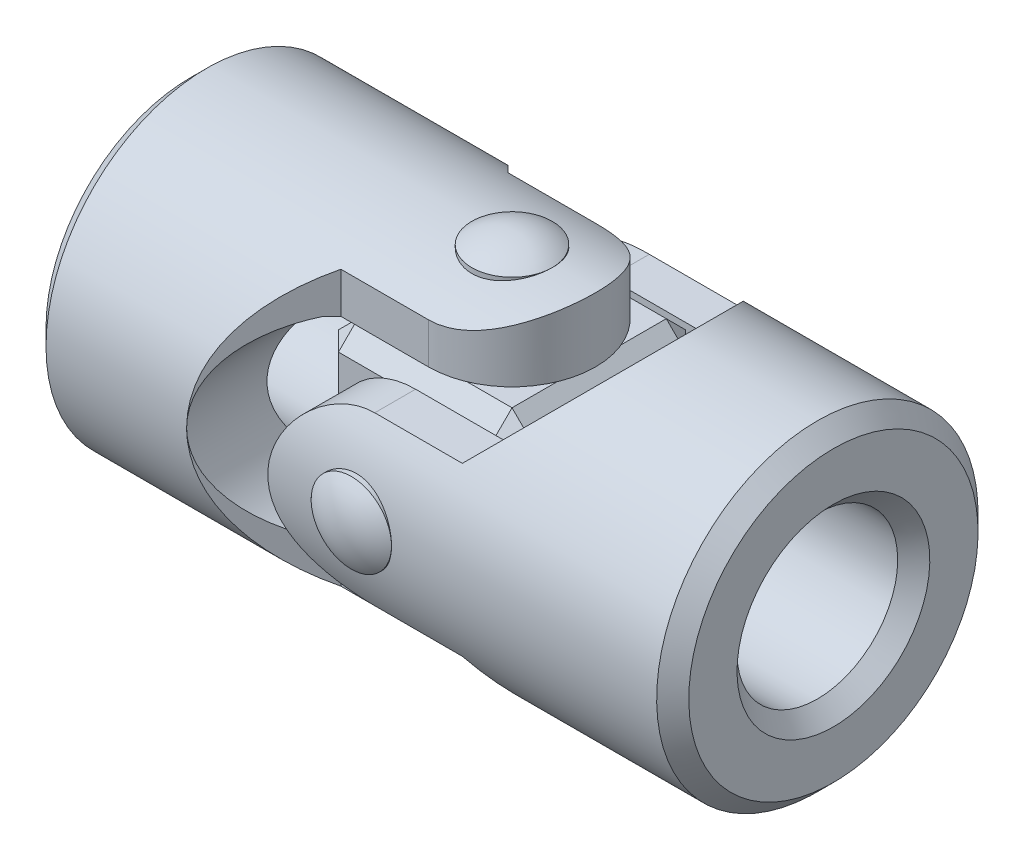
ISO-10303-21;
HEADER;
FILE_DESCRIPTION(('STEP AP214'),'2;1');
FILE_NAME('part.step','',(''),(''),'','','');
FILE_SCHEMA(('AUTOMOTIVE_DESIGN { 1 0 10303 214 1 1 1 1 }'));
ENDSEC;
DATA;
#1=APPLICATION_CONTEXT('core data for automotive mechanical design processes');
#2=APPLICATION_PROTOCOL_DEFINITION('international standard','automotive_design',2000,#1);
#3=PRODUCT_CONTEXT('',#1,'mechanical');
#4=PRODUCT('Part','Part','',(#3));
#5=PRODUCT_RELATED_PRODUCT_CATEGORY('part','',(#4));
#6=PRODUCT_DEFINITION_FORMATION('','',#4);
#7=PRODUCT_DEFINITION_CONTEXT('part definition',#1,'design');
#8=PRODUCT_DEFINITION('design','',#6,#7);
#9=PRODUCT_DEFINITION_SHAPE('','',#8);
#10=(LENGTH_UNIT() NAMED_UNIT(*) SI_UNIT(.MILLI.,.METRE.));
#11=(NAMED_UNIT(*) PLANE_ANGLE_UNIT() SI_UNIT($,.RADIAN.));
#12=(NAMED_UNIT(*) SI_UNIT($,.STERADIAN.) SOLID_ANGLE_UNIT());
#13=UNCERTAINTY_MEASURE_WITH_UNIT(LENGTH_MEASURE(1.E-05),#10,'distance_accuracy_value','');
#14=(GEOMETRIC_REPRESENTATION_CONTEXT(3) GLOBAL_UNCERTAINTY_ASSIGNED_CONTEXT((#13)) GLOBAL_UNIT_ASSIGNED_CONTEXT((#10,
#11,#12)) REPRESENTATION_CONTEXT('',''));
#15=CARTESIAN_POINT('',(0.,0.,0.));
#16=DIRECTION('',(0.,0.,1.));
#17=DIRECTION('',(1.,0.,0.));
#18=AXIS2_PLACEMENT_3D('',#15,#16,#17);
#19=CARTESIAN_POINT('',(0.,40.,0.));
#20=DIRECTION('',(0.,-1.,0.));
#21=DIRECTION('',(-1.,0.,0.));
#22=AXIS2_PLACEMENT_3D('',#19,#20,#21);
#23=CYLINDRICAL_SURFACE('',#22,10.);
#24=CARTESIAN_POINT('',(0.,40.,0.));
#25=DIRECTION('',(0.,1.,0.));
#26=DIRECTION('',(1.,0.,0.));
#27=AXIS2_PLACEMENT_3D('',#24,#25,#26);
#28=CIRCLE('',#27,10.);
#29=CARTESIAN_POINT('',(10.,40.,0.));
#30=VERTEX_POINT('',#29);
#31=EDGE_CURVE('P0_E10',#30,#30,#28,.T.);
#32=ORIENTED_EDGE('',*,*,#31,.F.);
#33=EDGE_LOOP('',(#32));
#34=FACE_BOUND('',#33,.T.);
#35=CARTESIAN_POINT('',(0.,-40.,0.));
#36=DIRECTION('',(0.,-1.,0.));
#37=DIRECTION('',(0.,0.,-1.));
#38=AXIS2_PLACEMENT_3D('',#35,#36,#37);
#39=CIRCLE('',#38,10.);
#40=CARTESIAN_POINT('',(0.,-40.,-10.));
#41=VERTEX_POINT('',#40);
#42=EDGE_CURVE('P0_E20',#41,#41,#39,.T.);
#43=ORIENTED_EDGE('',*,*,#42,.F.);
#44=EDGE_LOOP('',(#43));
#45=FACE_BOUND('',#44,.T.);
#46=ADVANCED_FACE('P0_F14',(#34,#45),#23,.T.);
#47=CARTESIAN_POINT('',(0.,25.975,0.));
#48=DIRECTION('',(0.,-1.,0.));
#49=DIRECTION('',(0.,0.,-1.));
#50=AXIS2_PLACEMENT_3D('',#47,#48,#49);
#51=SPHERICAL_SURFACE('',#50,17.225);
#52=ORIENTED_EDGE('',*,*,#31,.T.);
#53=EDGE_LOOP('',(#52));
#54=FACE_BOUND('',#53,.T.);
#55=ADVANCED_FACE('P0_F29',(#54),#51,.T.);
#56=CARTESIAN_POINT('',(0.,-25.975,0.));
#57=DIRECTION('',(0.,1.,0.));
#58=DIRECTION('',(0.,0.,-1.));
#59=AXIS2_PLACEMENT_3D('',#56,#57,#58);
#60=SPHERICAL_SURFACE('',#59,17.225);
#61=ORIENTED_EDGE('',*,*,#42,.T.);
#62=EDGE_LOOP('',(#61));
#63=FACE_BOUND('',#62,.T.);
#64=ADVANCED_FACE('P0_F26',(#63),#60,.T.);
#65=CLOSED_SHELL('',(#46,#55,#64));
#66=MANIFOLD_SOLID_BREP('P0_B1',#65);
#67=CARTESIAN_POINT('',(0.,0.,40.));
#68=DIRECTION('',(0.,0.,-1.));
#69=DIRECTION('',(-1.,0.,0.));
#70=AXIS2_PLACEMENT_3D('',#67,#68,#69);
#71=CYLINDRICAL_SURFACE('',#70,10.);
#72=CARTESIAN_POINT('',(0.,0.,40.));
#73=DIRECTION('',(0.,0.,1.));
#74=DIRECTION('',(1.,0.,0.));
#75=AXIS2_PLACEMENT_3D('',#72,#73,#74);
#76=CIRCLE('',#75,10.);
#77=CARTESIAN_POINT('',(10.,0.,40.));
#78=VERTEX_POINT('',#77);
#79=EDGE_CURVE('P1_E10',#78,#78,#76,.T.);
#80=ORIENTED_EDGE('',*,*,#79,.F.);
#81=EDGE_LOOP('',(#80));
#82=FACE_BOUND('',#81,.T.);
#83=CARTESIAN_POINT('',(0.,0.,-40.));
#84=DIRECTION('',(0.,0.,-1.));
#85=DIRECTION('',(0.,1.,0.));
#86=AXIS2_PLACEMENT_3D('',#83,#84,#85);
#87=CIRCLE('',#86,10.);
#88=CARTESIAN_POINT('',(0.,10.,-40.));
#89=VERTEX_POINT('',#88);
#90=EDGE_CURVE('P1_E20',#89,#89,#87,.T.);
#91=ORIENTED_EDGE('',*,*,#90,.F.);
#92=EDGE_LOOP('',(#91));
#93=FACE_BOUND('',#92,.T.);
#94=ADVANCED_FACE('P1_F14',(#82,#93),#71,.T.);
#95=CARTESIAN_POINT('',(0.,0.,25.975));
#96=DIRECTION('',(0.,0.,-1.));
#97=DIRECTION('',(0.,1.,0.));
#98=AXIS2_PLACEMENT_3D('',#95,#96,#97);
#99=SPHERICAL_SURFACE('',#98,17.225);
#100=ORIENTED_EDGE('',*,*,#79,.T.);
#101=EDGE_LOOP('',(#100));
#102=FACE_BOUND('',#101,.T.);
#103=ADVANCED_FACE('P1_F29',(#102),#99,.T.);
#104=CARTESIAN_POINT('',(0.,0.,-25.975));
#105=DIRECTION('',(0.,0.,1.));
#106=DIRECTION('',(0.,1.,0.));
#107=AXIS2_PLACEMENT_3D('',#104,#105,#106);
#108=SPHERICAL_SURFACE('',#107,17.225);
#109=ORIENTED_EDGE('',*,*,#90,.T.);
#110=EDGE_LOOP('',(#109));
#111=FACE_BOUND('',#110,.T.);
#112=ADVANCED_FACE('P1_F26',(#111),#108,.T.);
#113=CLOSED_SHELL('',(#94,#103,#112));
#114=MANIFOLD_SOLID_BREP('P1_B1',#113);
#115=CARTESIAN_POINT('',(0.,-40.,-20.8));
#116=DIRECTION('',(0.,0.,1.));
#117=DIRECTION('',(1.,0.,0.));
#118=AXIS2_PLACEMENT_3D('',#115,#116,#117);
#119=PLANE('',#118);
#120=DIRECTION('',(0.,1.,0.));
#121=VECTOR('',#120,1.);
#122=CARTESIAN_POINT('',(0.,-40.,-20.8));
#123=LINE('',#122,#121);
#124=CARTESIAN_POINT('',(0.,24.,-20.8));
#125=VERTEX_POINT('',#124);
#126=CARTESIAN_POINT('',(0.,34.1666504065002,-20.8));
#127=VERTEX_POINT('',#126);
#128=EDGE_CURVE('P2_E285',#125,#127,#123,.T.);
#129=ORIENTED_EDGE('',*,*,#128,.F.);
#130=DIRECTION('',(-1.,0.,0.));
#131=VECTOR('',#130,1.);
#132=CARTESIAN_POINT('',(0.,24.,-20.8));
#133=LINE('',#132,#131);
#134=CARTESIAN_POINT('',(-21.8000000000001,24.,-20.8));
#135=VERTEX_POINT('',#134);
#136=EDGE_CURVE('P2_E137',#125,#135,#133,.T.);
#137=ORIENTED_EDGE('',*,*,#136,.T.);
#138=DIRECTION('',(0.,1.,0.));
#139=VECTOR('',#138,1.);
#140=CARTESIAN_POINT('',(-21.8000000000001,-40.,-20.8));
#141=LINE('',#140,#139);
#142=CARTESIAN_POINT('',(-21.8000000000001,34.1666504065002,-20.8));
#143=VERTEX_POINT('',#142);
#144=EDGE_CURVE('P2_E292',#135,#143,#141,.T.);
#145=ORIENTED_EDGE('',*,*,#144,.T.);
#146=DIRECTION('',(1.,0.,0.));
#147=VECTOR('',#146,1.);
#148=CARTESIAN_POINT('',(-80.,34.1666504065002,-20.8));
#149=LINE('',#148,#147);
#150=EDGE_CURVE('P2_E230',#127,#143,#149,.F.);
#151=ORIENTED_EDGE('',*,*,#150,.F.);
#152=EDGE_LOOP('',(#129,#137,#145,#151));
#153=FACE_BOUND('',#152,.T.);
#154=ADVANCED_FACE('P2_F16',(#153),#119,.F.);
#155=CARTESIAN_POINT('',(-21.8000000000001,-40.,-20.8));
#156=DIRECTION('',(-0.707106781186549,0.,0.707106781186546));
#157=DIRECTION('',(0.707106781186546,0.,0.707106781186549));
#158=AXIS2_PLACEMENT_3D('',#155,#156,#157);
#159=PLANE('',#158);
#160=ORIENTED_EDGE('',*,*,#144,.F.);
#161=DIRECTION('',(-0.707106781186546,0.,-0.707106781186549));
#162=VECTOR('',#161,1.);
#163=CARTESIAN_POINT('',(-21.8000000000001,24.,-20.8));
#164=LINE('',#163,#162);
#165=CARTESIAN_POINT('',(-24.,24.,-22.9999999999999));
#166=VERTEX_POINT('',#165);
#167=EDGE_CURVE('P2_E140',#135,#166,#164,.T.);
#168=ORIENTED_EDGE('',*,*,#167,.T.);
#169=CARTESIAN_POINT('',(-15.5588235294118,0.,-14.5588235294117));
#170=DIRECTION('',(-0.707106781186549,0.,0.707106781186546));
#171=DIRECTION('',(-0.707106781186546,0.,-0.707106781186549));
#172=AXIS2_PLACEMENT_3D('',#169,#170,#171);
#173=ELLIPSE('',#172,35.9792568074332,25.4411764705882);
#174=CARTESIAN_POINT('',(-41.,0.,-40.));
#175=VERTEX_POINT('',#174);
#176=EDGE_CURVE('P2_E146',#166,#175,#173,.T.);
#177=ORIENTED_EDGE('',*,*,#176,.T.);
#178=CARTESIAN_POINT('',(-1.00000000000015,0.,0.));
#179=DIRECTION('',(-0.707106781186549,0.,0.707106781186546));
#180=DIRECTION('',(0.707106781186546,0.,0.707106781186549));
#181=AXIS2_PLACEMENT_3D('',#178,#179,#180);
#182=ELLIPSE('',#181,56.5685424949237,40.);
#183=EDGE_CURVE('P2_E234',#143,#175,#182,.T.);
#184=ORIENTED_EDGE('',*,*,#183,.F.);
#185=EDGE_LOOP('',(#160,#168,#177,#184));
#186=FACE_BOUND('',#185,.T.);
#187=ADVANCED_FACE('P2_F183',(#186),#159,.F.);
#188=CARTESIAN_POINT('',(-21.8000000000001,-40.,20.8));
#189=DIRECTION('',(-0.707106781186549,0.,-0.707106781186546));
#190=DIRECTION('',(-0.707106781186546,0.,0.707106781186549));
#191=AXIS2_PLACEMENT_3D('',#188,#189,#190);
#192=PLANE('',#191);
#193=CARTESIAN_POINT('',(-15.5588235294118,0.,14.5588235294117));
#194=DIRECTION('',(-0.707106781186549,0.,-0.707106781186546));
#195=DIRECTION('',(0.707106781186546,0.,-0.707106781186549));
#196=AXIS2_PLACEMENT_3D('',#193,#194,#195);
#197=ELLIPSE('',#196,35.9792568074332,25.4411764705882);
#198=CARTESIAN_POINT('',(-41.,0.,40.));
#199=VERTEX_POINT('',#198);
#200=CARTESIAN_POINT('',(-24.,24.,22.9999999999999));
#201=VERTEX_POINT('',#200);
#202=EDGE_CURVE('P2_E107',#199,#201,#197,.T.);
#203=ORIENTED_EDGE('',*,*,#202,.T.);
#204=DIRECTION('',(0.707106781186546,0.,-0.707106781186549));
#205=VECTOR('',#204,1.);
#206=CARTESIAN_POINT('',(-21.8000000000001,24.,20.8));
#207=LINE('',#206,#205);
#208=CARTESIAN_POINT('',(-21.8000000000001,24.,20.8));
#209=VERTEX_POINT('',#208);
#210=EDGE_CURVE('P2_E134',#201,#209,#207,.T.);
#211=ORIENTED_EDGE('',*,*,#210,.T.);
#212=DIRECTION('',(0.,1.,0.));
#213=VECTOR('',#212,1.);
#214=CARTESIAN_POINT('',(-21.8000000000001,-40.,20.8));
#215=LINE('',#214,#213);
#216=CARTESIAN_POINT('',(-21.8000000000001,34.1666504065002,20.8));
#217=VERTEX_POINT('',#216);
#218=EDGE_CURVE('P2_E295',#209,#217,#215,.T.);
#219=ORIENTED_EDGE('',*,*,#218,.T.);
#220=CARTESIAN_POINT('',(-1.00000000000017,0.,0.));
#221=DIRECTION('',(-0.707106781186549,0.,-0.707106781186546));
#222=DIRECTION('',(0.707106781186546,0.,-0.707106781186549));
#223=AXIS2_PLACEMENT_3D('',#220,#221,#222);
#224=ELLIPSE('',#223,56.5685424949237,40.);
#225=EDGE_CURVE('P2_E243',#199,#217,#224,.T.);
#226=ORIENTED_EDGE('',*,*,#225,.F.);
#227=EDGE_LOOP('',(#203,#211,#219,#226));
#228=FACE_BOUND('',#227,.T.);
#229=ADVANCED_FACE('P2_F187',(#228),#192,.F.);
#230=CARTESIAN_POINT('',(0.,-40.,20.8));
#231=DIRECTION('',(0.,0.,-1.));
#232=DIRECTION('',(-1.,0.,0.));
#233=AXIS2_PLACEMENT_3D('',#230,#231,#232);
#234=PLANE('',#233);
#235=ORIENTED_EDGE('',*,*,#218,.F.);
#236=DIRECTION('',(1.,0.,0.));
#237=VECTOR('',#236,1.);
#238=CARTESIAN_POINT('',(0.,24.,20.8));
#239=LINE('',#238,#237);
#240=CARTESIAN_POINT('',(0.,24.,20.8));
#241=VERTEX_POINT('',#240);
#242=EDGE_CURVE('P2_E131',#209,#241,#239,.T.);
#243=ORIENTED_EDGE('',*,*,#242,.T.);
#244=DIRECTION('',(0.,1.,0.));
#245=VECTOR('',#244,1.);
#246=CARTESIAN_POINT('',(0.,-40.,20.8));
#247=LINE('',#246,#245);
#248=CARTESIAN_POINT('',(0.,34.1666504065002,20.8));
#249=VERTEX_POINT('',#248);
#250=EDGE_CURVE('P2_E157',#241,#249,#247,.T.);
#251=ORIENTED_EDGE('',*,*,#250,.T.);
#252=DIRECTION('',(1.,0.,0.));
#253=VECTOR('',#252,1.);
#254=CARTESIAN_POINT('',(-80.,34.1666504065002,20.8));
#255=LINE('',#254,#253);
#256=EDGE_CURVE('P2_E247',#217,#249,#255,.T.);
#257=ORIENTED_EDGE('',*,*,#256,.F.);
#258=EDGE_LOOP('',(#235,#243,#251,#257));
#259=FACE_BOUND('',#258,.T.);
#260=ADVANCED_FACE('P2_F190',(#259),#234,.F.);
#261=CARTESIAN_POINT('',(0.,-40.,0.));
#262=DIRECTION('',(0.,1.,0.));
#263=DIRECTION('',(0.,0.,-1.));
#264=AXIS2_PLACEMENT_3D('',#261,#262,#263);
#265=CYLINDRICAL_SURFACE('',#264,20.8);
#266=ORIENTED_EDGE('',*,*,#250,.F.);
#267=CARTESIAN_POINT('',(0.,24.,0.));
#268=DIRECTION('',(0.,1.,0.));
#269=DIRECTION('',(1.,0.,0.));
#270=AXIS2_PLACEMENT_3D('',#267,#268,#269);
#271=CIRCLE('',#270,20.8);
#272=EDGE_CURVE('P2_E111',#241,#125,#271,.T.);
#273=ORIENTED_EDGE('',*,*,#272,.T.);
#274=ORIENTED_EDGE('',*,*,#128,.T.);
#275=CARTESIAN_POINT('',(0.,34.1666504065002,20.8));
#276=CARTESIAN_POINT('',(0.270659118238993,34.1666436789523,20.8000022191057));
#277=CARTESIAN_POINT('',(0.54127939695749,34.1698679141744,20.7947158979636));
#278=CARTESIAN_POINT('',(1.0819441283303,34.1827096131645,20.7736031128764));
#279=CARTESIAN_POINT('',(1.35198860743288,34.1923267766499,20.7577771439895));
#280=CARTESIAN_POINT('',(2.16005879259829,34.2306418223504,20.6945827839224));
#281=CARTESIAN_POINT('',(2.6965156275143,34.268803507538,20.6314977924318));
#282=CARTESIAN_POINT('',(3.75735517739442,34.3685947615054,20.4648227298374));
#283=CARTESIAN_POINT('',(4.28179182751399,34.4300786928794,20.3614839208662));
#284=CARTESIAN_POINT('',(5.31846095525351,34.5743041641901,20.115610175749));
#285=CARTESIAN_POINT('',(5.83069185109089,34.6570484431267,19.9730701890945));
#286=CARTESIAN_POINT('',(6.83847612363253,34.8407775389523,19.6508138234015));
#287=CARTESIAN_POINT('',(7.33406738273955,34.9417170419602,19.4711896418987));
#288=CARTESIAN_POINT('',(8.3073143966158,35.1588737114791,19.0762768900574));
#289=CARTESIAN_POINT('',(8.78497042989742,35.275090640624,18.8609888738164));
#290=CARTESIAN_POINT('',(9.72095800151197,35.5197494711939,18.3960992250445));
#291=CARTESIAN_POINT('',(10.179258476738,35.6482100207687,18.146444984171));
#292=CARTESIAN_POINT('',(11.0739924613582,35.9139355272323,17.6146976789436));
#293=CARTESIAN_POINT('',(11.510423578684,36.0512014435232,17.3326010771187));
#294=CARTESIAN_POINT('',(12.3975693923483,36.3437628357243,16.7110473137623));
#295=CARTESIAN_POINT('',(12.8461047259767,36.4995763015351,16.3687202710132));
#296=CARTESIAN_POINT('',(13.7134000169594,36.8137737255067,15.6492857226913));
#297=CARTESIAN_POINT('',(14.1321585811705,36.9721578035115,15.2721765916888));
#298=CARTESIAN_POINT('',(14.9380915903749,37.2876526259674,14.4848487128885));
#299=CARTESIAN_POINT('',(15.3252568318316,37.4447629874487,14.0746203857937));
#300=CARTESIAN_POINT('',(16.0658341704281,37.7539111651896,13.2229876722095));
#301=CARTESIAN_POINT('',(16.41924726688,37.9059491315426,12.7815842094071));
#302=CARTESIAN_POINT('',(17.1152784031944,38.2124054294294,11.8354296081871));
#303=CARTESIAN_POINT('',(17.4551171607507,38.3661529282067,11.328409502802));
#304=CARTESIAN_POINT('',(18.0905151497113,38.6593751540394,10.2833471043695));
#305=CARTESIAN_POINT('',(18.3860715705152,38.7988489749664,9.74530284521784));
#306=CARTESIAN_POINT('',(18.9297882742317,39.0594415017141,8.64182863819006));
#307=CARTESIAN_POINT('',(19.1779727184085,39.1805695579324,8.0764128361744));
#308=CARTESIAN_POINT('',(19.6241852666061,39.4009006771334,6.92200493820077));
#309=CARTESIAN_POINT('',(19.822219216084,39.5001062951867,6.33301559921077));
#310=CARTESIAN_POINT('',(20.1524415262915,39.6668904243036,5.1817021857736));
#311=CARTESIAN_POINT('',(20.2884873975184,39.7362982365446,4.62074844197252));
#312=CARTESIAN_POINT('',(20.5137453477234,39.8517799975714,3.48713679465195));
#313=CARTESIAN_POINT('',(20.6029595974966,39.8978550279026,2.91447943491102));
#314=CARTESIAN_POINT('',(20.7332847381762,39.9653097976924,1.76258207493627));
#315=CARTESIAN_POINT('',(20.7744216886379,39.9867029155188,1.18334581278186));
#316=CARTESIAN_POINT('',(20.808080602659,40.0041996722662,0.0230965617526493));
#317=CARTESIAN_POINT('',(20.8006058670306,40.0003050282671,-0.5579163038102));
#318=CARTESIAN_POINT('',(20.7401543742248,39.9689061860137,-1.66203707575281));
#319=CARTESIAN_POINT('',(20.6915210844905,39.9436558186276,-2.185453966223));
#320=CARTESIAN_POINT('',(20.5550415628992,39.8731276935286,-3.22574458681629));
#321=CARTESIAN_POINT('',(20.4671983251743,39.8278514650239,-3.74261881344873));
#322=CARTESIAN_POINT('',(20.2532846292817,39.7183472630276,-4.76633341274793));
#323=CARTESIAN_POINT('',(20.1272136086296,39.6541190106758,-5.27317363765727));
#324=CARTESIAN_POINT('',(19.8381620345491,39.5081905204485,-6.27363326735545));
#325=CARTESIAN_POINT('',(19.6751801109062,39.4264896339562,-6.76725218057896));
#326=CARTESIAN_POINT('',(19.3115584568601,39.2462869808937,-7.74461399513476));
#327=CARTESIAN_POINT('',(19.1104651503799,39.1475843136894,-8.22815077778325));
#328=CARTESIAN_POINT('',(18.6737749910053,38.9362731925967,-9.17619341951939));
#329=CARTESIAN_POINT('',(18.4381782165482,38.8236647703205,-9.64069932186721));
#330=CARTESIAN_POINT('',(17.9342198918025,38.586872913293,-10.5486210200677));
#331=CARTESIAN_POINT('',(17.6658507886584,38.4626868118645,-10.9920319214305));
#332=CARTESIAN_POINT('',(17.098142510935,38.2052675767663,-11.8558294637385));
#333=CARTESIAN_POINT('',(16.7988001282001,38.0720335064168,-12.2762137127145));
#334=CARTESIAN_POINT('',(16.13945658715,37.7855168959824,-13.1331131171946));
#335=CARTESIAN_POINT('',(15.7763830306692,37.6315613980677,-13.5670421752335));
#336=CARTESIAN_POINT('',(15.0169426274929,37.319548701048,-14.4031400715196));
#337=CARTESIAN_POINT('',(14.6205736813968,37.1614912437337,-14.8053069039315));
#338=CARTESIAN_POINT('',(13.7961252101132,36.8449191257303,-15.5764511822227));
#339=CARTESIAN_POINT('',(13.3680143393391,36.6864041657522,-15.9453950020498));
#340=CARTESIAN_POINT('',(12.4823778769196,36.3730427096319,-16.6478132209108));
#341=CARTESIAN_POINT('',(12.0248529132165,36.2181961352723,-16.9812883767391));
#342=CARTESIAN_POINT('',(11.04760069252,35.9051498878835,-17.6340784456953));
#343=CARTESIAN_POINT('',(10.5257737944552,35.747542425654,-17.9505440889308));
#344=CARTESIAN_POINT('',(9.45302784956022,35.4465058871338,-18.5379127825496));
#345=CARTESIAN_POINT('',(8.90210478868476,35.3030787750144,-18.8088095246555));
#346=CARTESIAN_POINT('',(7.77570791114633,35.0360243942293,-19.3016951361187));
#347=CARTESIAN_POINT('',(7.20029301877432,34.9123526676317,-19.5237942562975));
#348=CARTESIAN_POINT('',(6.0278058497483,34.6895337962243,-19.9170145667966));
#349=CARTESIAN_POINT('',(5.43074294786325,34.5903761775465,-20.0881575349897));
#350=CARTESIAN_POINT('',(4.4334337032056,34.4508987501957,-20.3260227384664));
#351=CARTESIAN_POINT('',(4.03799465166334,34.4021593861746,-20.4082879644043));
#352=CARTESIAN_POINT('',(3.24170771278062,34.3178090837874,-20.5498117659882));
#353=CARTESIAN_POINT('',(2.84086136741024,34.2821944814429,-20.6090767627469));
#354=CARTESIAN_POINT('',(2.03440880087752,34.2247997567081,-20.7042593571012));
#355=CARTESIAN_POINT('',(1.6287932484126,34.2030541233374,-20.7401187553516));
#356=CARTESIAN_POINT('',(0.815460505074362,34.1739476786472,-20.788011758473));
#357=CARTESIAN_POINT('',(0.407742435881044,34.1665934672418,-20.8000344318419));
#358=CARTESIAN_POINT('',(0.,34.1666504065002,-20.8));
#359=B_SPLINE_CURVE_WITH_KNOTS('',3,(#275,#276,#277,#278,#279,#280,#281,#282,#283,#284,#285,
#286,#287,#288,#289,#290,#291,#292,#293,#294,#295,#296,#297,#298,#299,#300,#301,#302,#303,#304,
#305,#306,#307,#308,#309,#310,#311,#312,#313,#314,#315,#316,#317,#318,#319,#320,#321,#322,#323,
#324,#325,#326,#327,#328,#329,#330,#331,#332,#333,#334,#335,#336,#337,#338,#339,#340,#341,#342,
#343,#344,#345,#346,#347,#348,#349,#350,#351,#352,#353,#354,#355,#356,#357,#358),.UNSPECIFIED.,
.F.,.F.,(4,2,2,2,2,2,2,2,2,2,2,2,2,2,2,2,2,2,2,2,2,2,2,2,2,2,2,2,2,2,2,2,2,2,2,2,2,2,2,2,2,4),
(0.,0.811829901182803,1.6236216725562,3.24572763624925,4.85786669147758,6.47021354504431,
8.07859909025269,9.68695964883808,11.2978102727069,12.9088367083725,14.6630825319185,
16.4174103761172,18.1722474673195,19.9270325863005,21.8129226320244,23.6989323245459,
25.5839775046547,27.4688028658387,29.2105348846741,30.9521861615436,32.6928929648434,
34.4334815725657,36.0104462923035,37.5872906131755,39.1641581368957,40.7410842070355,
42.3381129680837,43.9351380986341,45.5325319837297,47.1300914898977,48.887297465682,
50.6446143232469,52.4036902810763,54.1627286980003,56.0512505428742,57.9400336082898,
59.8245043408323,61.7081685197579,62.9278719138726,64.1472345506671,65.3696177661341,
66.5925614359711),.UNSPECIFIED.);
#360=EDGE_CURVE('P2_E205',#249,#127,#359,.T.);
#361=ORIENTED_EDGE('',*,*,#360,.F.);
#362=EDGE_LOOP('',(#266,#273,#274,#361));
#363=FACE_BOUND('',#362,.T.);
#364=ADVANCED_FACE('P2_F194',(#363),#265,.T.);
#365=CARTESIAN_POINT('',(-80.,0.,0.));
#366=DIRECTION('',(-1.,0.,0.));
#367=DIRECTION('',(0.,0.,1.));
#368=AXIS2_PLACEMENT_3D('',#365,#366,#367);
#369=PLANE('',#368);
#370=CARTESIAN_POINT('',(-80.,0.,0.));
#371=DIRECTION('',(-1.,0.,0.));
#372=DIRECTION('',(0.,0.,1.));
#373=AXIS2_PLACEMENT_3D('',#370,#371,#372);
#374=CIRCLE('',#373,24.);
#375=CARTESIAN_POINT('',(-80.,0.,24.));
#376=VERTEX_POINT('',#375);
#377=EDGE_CURVE('P2_E24',#376,#376,#374,.F.);
#378=ORIENTED_EDGE('',*,*,#377,.T.);
#379=EDGE_LOOP('',(#378));
#380=FACE_BOUND('',#379,.T.);
#381=CARTESIAN_POINT('',(-80.,0.,0.));
#382=DIRECTION('',(-1.,0.,0.));
#383=DIRECTION('',(0.,0.,1.));
#384=AXIS2_PLACEMENT_3D('',#381,#382,#383);
#385=CIRCLE('',#384,36.);
#386=CARTESIAN_POINT('',(-80.,0.,36.));
#387=VERTEX_POINT('',#386);
#388=EDGE_CURVE('P2_E257',#387,#387,#385,.T.);
#389=ORIENTED_EDGE('',*,*,#388,.T.);
#390=EDGE_LOOP('',(#389));
#391=FACE_BOUND('',#390,.T.);
#392=ADVANCED_FACE('P2_F216',(#380,#391),#369,.T.);
#393=CARTESIAN_POINT('',(-80.,0.,0.));
#394=DIRECTION('',(1.,0.,0.));
#395=DIRECTION('',(0.,0.,-1.));
#396=AXIS2_PLACEMENT_3D('',#393,#394,#395);
#397=CYLINDRICAL_SURFACE('',#396,40.);
#398=CARTESIAN_POINT('',(-76.,0.,0.));
#399=DIRECTION('',(-1.,0.,0.));
#400=DIRECTION('',(0.,0.,1.));
#401=AXIS2_PLACEMENT_3D('',#398,#399,#400);
#402=CIRCLE('',#401,40.);
#403=CARTESIAN_POINT('',(-76.,0.,40.));
#404=VERTEX_POINT('',#403);
#405=EDGE_CURVE('P2_E11',#404,#404,#402,.F.);
#406=ORIENTED_EDGE('',*,*,#405,.T.);
#407=EDGE_LOOP('',(#406));
#408=FACE_BOUND('',#407,.T.);
#409=CARTESIAN_POINT('',(10.,-40.,0.));
#410=CARTESIAN_POINT('',(9.99999883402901,-39.9999993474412,-0.276276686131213));
#411=CARTESIAN_POINT('',(9.98854101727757,-39.9971305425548,-0.552576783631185));
#412=CARTESIAN_POINT('',(9.94280275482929,-39.9857330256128,-1.10318148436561));
#413=CARTESIAN_POINT('',(9.90851970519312,-39.9772036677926,-1.37748585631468));
#414=CARTESIAN_POINT('',(9.81739856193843,-39.9547164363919,-1.9222336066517));
#415=CARTESIAN_POINT('',(9.76054956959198,-39.9407559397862,-2.19267505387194));
#416=CARTESIAN_POINT('',(9.62476629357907,-39.907791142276,-2.72764291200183));
#417=CARTESIAN_POINT('',(9.54583150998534,-39.8887867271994,-2.9921691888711));
#418=CARTESIAN_POINT('',(9.36662162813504,-39.8462801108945,-3.51314528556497));
#419=CARTESIAN_POINT('',(9.26637310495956,-39.8227835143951,-3.76960471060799));
#420=CARTESIAN_POINT('',(9.04524690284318,-39.7719112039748,-4.27306727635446));
#421=CARTESIAN_POINT('',(8.92436911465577,-39.7445354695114,-4.52007036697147));
#422=CARTESIAN_POINT('',(8.66289426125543,-39.6866412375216,-5.00296312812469));
#423=CARTESIAN_POINT('',(8.52230058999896,-39.6561232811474,-5.23885470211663));
#424=CARTESIAN_POINT('',(8.22231087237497,-39.5927379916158,-5.69814612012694));
#425=CARTESIAN_POINT('',(8.0629080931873,-39.5598698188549,-5.92154144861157));
#426=CARTESIAN_POINT('',(7.72336411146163,-39.4920522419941,-6.35826451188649));
#427=CARTESIAN_POINT('',(7.54289987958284,-39.4570759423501,-6.57133697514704));
#428=CARTESIAN_POINT('',(7.16476180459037,-39.3865370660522,-6.98169544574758));
#429=CARTESIAN_POINT('',(6.96708014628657,-39.3509742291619,-7.17897420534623));
#430=CARTESIAN_POINT('',(6.55585088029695,-39.2802515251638,-7.5563689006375));
#431=CARTESIAN_POINT('',(6.34230146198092,-39.2450917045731,-7.73648287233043));
#432=CARTESIAN_POINT('',(5.90084369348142,-39.176172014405,-8.07823801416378));
#433=CARTESIAN_POINT('',(5.67294186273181,-39.1424115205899,-8.23988747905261));
#434=CARTESIAN_POINT('',(5.20057500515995,-39.0767252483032,-8.54601878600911));
#435=CARTESIAN_POINT('',(4.95590961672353,-39.0448355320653,-8.69019944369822));
#436=CARTESIAN_POINT('',(4.45497352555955,-38.9844200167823,-8.95732951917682));
#437=CARTESIAN_POINT('',(4.19870738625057,-38.9558929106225,-9.08028719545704));
#438=CARTESIAN_POINT('',(3.67624466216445,-38.9030492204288,-9.30408470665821));
#439=CARTESIAN_POINT('',(3.41004731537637,-38.8787329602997,-9.40492284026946));
#440=CARTESIAN_POINT('',(2.86965618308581,-38.8350668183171,-9.58363487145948));
#441=CARTESIAN_POINT('',(2.59546258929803,-38.8157168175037,-9.66150931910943));
#442=CARTESIAN_POINT('',(2.04666244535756,-38.7829255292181,-9.79230027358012));
#443=CARTESIAN_POINT('',(1.77217416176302,-38.7693736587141,-9.84568542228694));
#444=CARTESIAN_POINT('',(1.21947010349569,-38.7480433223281,-9.92930040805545));
#445=CARTESIAN_POINT('',(0.941254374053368,-38.7402647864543,-9.959530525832));
#446=CARTESIAN_POINT('',(0.383204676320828,-38.7307245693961,-9.99656649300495));
#447=CARTESIAN_POINT('',(0.103370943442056,-38.7289620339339,-10.0033756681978));
#448=CARTESIAN_POINT('',(-0.455852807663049,-38.7315068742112,-9.99351800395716));
#449=CARTESIAN_POINT('',(-0.735242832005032,-38.7358141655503,-9.97685149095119));
#450=CARTESIAN_POINT('',(-1.2847302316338,-38.7501861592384,-9.92088090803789));
#451=CARTESIAN_POINT('',(-1.55488854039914,-38.7601085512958,-9.88213622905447));
#452=CARTESIAN_POINT('',(-2.09088950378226,-38.7853084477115,-9.7827640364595));
#453=CARTESIAN_POINT('',(-2.35673223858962,-38.8005858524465,-9.72213692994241));
#454=CARTESIAN_POINT('',(-2.8822403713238,-38.8360474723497,-9.5794994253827));
#455=CARTESIAN_POINT('',(-3.14190657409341,-38.8562310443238,-9.49749183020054));
#456=CARTESIAN_POINT('',(-3.65345531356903,-38.9009354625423,-9.3126930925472));
#457=CARTESIAN_POINT('',(-3.90533489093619,-38.9254579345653,-9.20989415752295));
#458=CARTESIAN_POINT('',(-4.40201293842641,-38.9784060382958,-8.98318087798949));
#459=CARTESIAN_POINT('',(-4.64671694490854,-39.0068678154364,-8.85906808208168));
#460=CARTESIAN_POINT('',(-5.124844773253,-39.0667091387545,-8.59133539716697));
#461=CARTESIAN_POINT('',(-5.35826808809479,-39.0980888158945,-8.44771463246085));
#462=CARTESIAN_POINT('',(-5.81238025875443,-39.1629064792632,-8.14193923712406));
#463=CARTESIAN_POINT('',(-6.03306750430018,-39.196344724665,-7.97978227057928));
#464=CARTESIAN_POINT('',(-6.46030166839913,-39.2643733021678,-7.63801932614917));
#465=CARTESIAN_POINT('',(-6.66684832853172,-39.2989636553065,-7.45841302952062));
#466=CARTESIAN_POINT('',(-7.07019362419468,-39.3693672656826,-7.07753342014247));
#467=CARTESIAN_POINT('',(-7.26654536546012,-39.4051872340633,-6.87578778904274));
#468=CARTESIAN_POINT('',(-7.64160296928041,-39.4760709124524,-6.45639557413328));
#469=CARTESIAN_POINT('',(-7.82030911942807,-39.5111346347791,-6.23874924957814));
#470=CARTESIAN_POINT('',(-8.15889404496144,-39.579540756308,-5.78892992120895));
#471=CARTESIAN_POINT('',(-8.31876814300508,-39.6128827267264,-5.55675333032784));
#472=CARTESIAN_POINT('',(-8.61843593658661,-39.6768951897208,-5.07955796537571));
#473=CARTESIAN_POINT('',(-8.75823739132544,-39.7075667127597,-4.83454420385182));
#474=CARTESIAN_POINT('',(-9.01726316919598,-39.765500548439,-4.33232990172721));
#475=CARTESIAN_POINT('',(-9.13641032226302,-39.7927499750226,-4.07508804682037));
#476=CARTESIAN_POINT('',(-9.35256005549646,-39.842933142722,-3.55104953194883));
#477=CARTESIAN_POINT('',(-9.44956251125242,-39.8658668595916,-3.28425281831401));
#478=CARTESIAN_POINT('',(-9.62060787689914,-39.9067562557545,-2.74306842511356));
#479=CARTESIAN_POINT('',(-9.69465436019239,-39.9247127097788,-2.46868193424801));
#480=CARTESIAN_POINT('',(-9.81917048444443,-39.9551305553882,-1.91431246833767));
#481=CARTESIAN_POINT('',(-9.86964070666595,-39.9675920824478,-1.6343296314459));
#482=CARTESIAN_POINT('',(-9.94557447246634,-39.9864118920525,-1.07810473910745));
#483=CARTESIAN_POINT('',(-9.97164519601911,-39.9929182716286,-0.801950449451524));
#484=CARTESIAN_POINT('',(-10.0007571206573,-40.0001867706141,-0.248356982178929));
#485=CARTESIAN_POINT('',(-10.0037987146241,-40.00094898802,0.0290821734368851));
#486=CARTESIAN_POINT('',(-9.98682728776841,-39.9967080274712,0.583185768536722));
#487=CARTESIAN_POINT('',(-9.96681617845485,-39.991705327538,0.85985027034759));
#488=CARTESIAN_POINT('',(-9.90391474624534,-39.9760753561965,1.41040357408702));
#489=CARTESIAN_POINT('',(-9.86102451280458,-39.9654481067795,1.684292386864));
#490=CARTESIAN_POINT('',(-9.75353412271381,-39.9390630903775,2.22327800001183));
#491=CARTESIAN_POINT('',(-9.6892659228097,-39.9233838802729,2.48844496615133));
#492=CARTESIAN_POINT('',(-9.53939377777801,-39.8872755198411,3.0123409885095));
#493=CARTESIAN_POINT('',(-9.45379010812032,-39.8668464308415,3.27107012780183));
#494=CARTESIAN_POINT('',(-9.26191700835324,-39.8217832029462,3.78033449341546));
#495=CARTESIAN_POINT('',(-9.1556497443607,-39.7971495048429,4.03087057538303));
#496=CARTESIAN_POINT('',(-8.92318659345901,-39.7443134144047,4.52223860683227));
#497=CARTESIAN_POINT('',(-8.79698323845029,-39.7161096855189,4.76306687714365));
#498=CARTESIAN_POINT('',(-8.5231855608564,-39.6563555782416,5.23752187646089));
#499=CARTESIAN_POINT('',(-8.37525487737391,-39.624755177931,5.47094820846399));
#500=CARTESIAN_POINT('',(-8.06074147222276,-39.5594728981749,5.92457828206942));
#501=CARTESIAN_POINT('',(-7.89415794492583,-39.5257909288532,6.1447814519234));
#502=CARTESIAN_POINT('',(-7.54343892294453,-39.4572414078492,6.57058731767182));
#503=CARTESIAN_POINT('',(-7.3593010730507,-39.4223736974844,6.77618804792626));
#504=CARTESIAN_POINT('',(-6.97469050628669,-39.352389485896,7.17145280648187));
#505=CARTESIAN_POINT('',(-6.7742175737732,-39.3172729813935,7.3611166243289));
#506=CARTESIAN_POINT('',(-6.3530932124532,-39.2468808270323,7.72774540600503));
#507=CARTESIAN_POINT('',(-6.13206668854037,-39.2116225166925,7.90428315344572));
#508=CARTESIAN_POINT('',(-5.67568308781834,-39.1428473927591,8.23811583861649));
#509=CARTESIAN_POINT('',(-5.44032637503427,-39.1093305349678,8.3954112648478));
#510=CARTESIAN_POINT('',(-4.95680344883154,-39.0450059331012,8.68966091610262));
#511=CARTESIAN_POINT('',(-4.70863478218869,-39.0141987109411,8.826611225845));
#512=CARTESIAN_POINT('',(-4.20132296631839,-38.9562273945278,9.07904857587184));
#513=CARTESIAN_POINT('',(-3.94218426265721,-38.9290618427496,9.19454421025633));
#514=CARTESIAN_POINT('',(-3.41618652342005,-38.879328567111,9.40261638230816));
#515=CARTESIAN_POINT('',(-3.14938106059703,-38.8567350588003,9.4953221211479));
#516=CARTESIAN_POINT('',(-2.60852679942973,-38.8166419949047,9.65791512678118));
#517=CARTESIAN_POINT('',(-2.33447801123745,-38.7991424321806,9.72780242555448));
#518=CARTESIAN_POINT('',(-1.781203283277,-38.7697871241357,9.84414605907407));
#519=CARTESIAN_POINT('',(-1.50197830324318,-38.7579303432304,9.89060669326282));
#520=CARTESIAN_POINT('',(-0.940408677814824,-38.740232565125,9.95970176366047));
#521=CARTESIAN_POINT('',(-0.658064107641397,-38.7343914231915,9.98233677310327));
#522=CARTESIAN_POINT('',(-0.100552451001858,-38.7289898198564,10.0032722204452));
#523=CARTESIAN_POINT('',(0.174587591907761,-38.7292536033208,10.0022536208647));
#524=CARTESIAN_POINT('',(0.723776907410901,-38.7356226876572,9.97755972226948));
#525=CARTESIAN_POINT('',(0.997826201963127,-38.741727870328,9.95388488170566));
#526=CARTESIAN_POINT('',(1.54285299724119,-38.7595950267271,9.88408248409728));
#527=CARTESIAN_POINT('',(1.81383057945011,-38.771356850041,9.83795552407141));
#528=CARTESIAN_POINT('',(2.35080101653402,-38.8001853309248,9.72363550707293));
#529=CARTESIAN_POINT('',(2.61679384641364,-38.8172520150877,9.65544233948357));
#530=CARTESIAN_POINT('',(3.14032820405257,-38.8560667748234,9.49803119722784));
#531=CARTESIAN_POINT('',(3.39791175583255,-38.8777853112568,9.40894556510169));
#532=CARTESIAN_POINT('',(3.90471375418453,-38.9253530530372,9.21017526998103));
#533=CARTESIAN_POINT('',(4.1539291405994,-38.9512037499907,9.10048316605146));
#534=CARTESIAN_POINT('',(4.6422654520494,-39.0063041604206,8.86133636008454));
#535=CARTESIAN_POINT('',(4.88138729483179,-39.0355535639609,8.73188345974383));
#536=CARTESIAN_POINT('',(5.34806695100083,-39.0966532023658,8.45410693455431));
#537=CARTESIAN_POINT('',(5.57562420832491,-39.1285035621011,8.30578240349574));
#538=CARTESIAN_POINT('',(6.02353081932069,-39.1948030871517,7.98715019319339));
#539=CARTESIAN_POINT('',(6.24353736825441,-39.2292983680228,7.81637004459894));
#540=CARTESIAN_POINT('',(6.66846896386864,-39.2991672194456,7.45713945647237));
#541=CARTESIAN_POINT('',(6.87339377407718,-39.3345408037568,7.2686887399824));
#542=CARTESIAN_POINT('',(7.26688107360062,-39.4052037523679,6.87530741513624));
#543=CARTESIAN_POINT('',(7.4554396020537,-39.4404930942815,6.67037284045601));
#544=CARTESIAN_POINT('',(7.81488914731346,-39.5100163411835,6.24539503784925));
#545=CARTESIAN_POINT('',(7.9857805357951,-39.5442502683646,6.02535212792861));
#546=CARTESIAN_POINT('',(8.31170518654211,-39.6113435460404,5.5674035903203));
#547=CARTESIAN_POINT('',(8.46638971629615,-39.6441661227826,5.32924418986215));
#548=CARTESIAN_POINT('',(8.75504453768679,-39.7068124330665,4.84042651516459));
#549=CARTESIAN_POINT('',(8.88902242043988,-39.7366372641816,4.58977286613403));
#550=CARTESIAN_POINT('',(9.13524839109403,-39.7924413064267,4.07773321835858));
#551=CARTESIAN_POINT('',(9.24750585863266,-39.8184221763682,3.81635191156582));
#552=CARTESIAN_POINT('',(9.44944674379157,-39.8658048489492,3.28463135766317));
#553=CARTESIAN_POINT('',(9.53913356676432,-39.8872073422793,3.01429346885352));
#554=CARTESIAN_POINT('',(9.68047406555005,-39.9212703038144,2.51829671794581));
#555=CARTESIAN_POINT('',(9.73611039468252,-39.9348181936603,2.29382401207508));
#556=CARTESIAN_POINT('',(9.83172183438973,-39.9582356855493,1.84138358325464));
#557=CARTESIAN_POINT('',(9.8716980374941,-39.9681055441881,1.61341610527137));
#558=CARTESIAN_POINT('',(9.93575782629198,-39.9839757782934,1.15510194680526));
#559=CARTESIAN_POINT('',(9.95983985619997,-39.9899757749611,0.924755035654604));
#560=CARTESIAN_POINT('',(9.9919593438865,-39.9979876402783,0.462944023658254));
#561=CARTESIAN_POINT('',(10.0000009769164,-40.0000005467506,0.231480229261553));
#562=CARTESIAN_POINT('',(10.,-40.,0.));
#563=B_SPLINE_CURVE_WITH_KNOTS('',3,(#409,#410,#411,#412,#413,#414,#415,#416,#417,#418,#419,
#420,#421,#422,#423,#424,#425,#426,#427,#428,#429,#430,#431,#432,#433,#434,#435,#436,#437,#438,
#439,#440,#441,#442,#443,#444,#445,#446,#447,#448,#449,#450,#451,#452,#453,#454,#455,#456,#457,
#458,#459,#460,#461,#462,#463,#464,#465,#466,#467,#468,#469,#470,#471,#472,#473,#474,#475,#476,
#477,#478,#479,#480,#481,#482,#483,#484,#485,#486,#487,#488,#489,#490,#491,#492,#493,#494,#495,
#496,#497,#498,#499,#500,#501,#502,#503,#504,#505,#506,#507,#508,#509,#510,#511,#512,#513,#514,
#515,#516,#517,#518,#519,#520,#521,#522,#523,#524,#525,#526,#527,#528,#529,#530,#531,#532,#533,
#534,#535,#536,#537,#538,#539,#540,#541,#542,#543,#544,#545,#546,#547,#548,#549,#550,#551,#552,
#553,#554,#555,#556,#557,#558,#559,#560,#561,#562),.UNSPECIFIED.,.T.,.F.,(4,2,2,2,2,2,2,2,2,2,2,
2,2,2,2,2,2,2,2,2,2,2,2,2,2,2,2,2,2,2,2,2,2,2,2,2,2,2,2,2,2,2,2,2,2,2,2,2,2,2,2,2,2,2,2,2,2,2,2,
2,2,2,2,2,2,2,2,2,2,2,2,2,2,2,2,2,4),(0.,0.828619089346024,1.65733272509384,2.48644709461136,
3.31558023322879,4.1436855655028,4.97179528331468,5.79976262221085,6.62802724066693,
7.47127713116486,8.31491179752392,9.15864287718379,10.0019934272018,10.8582731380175,
11.7142188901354,12.5702304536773,13.4262215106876,14.2650679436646,15.103904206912,
15.9426213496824,16.7813268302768,17.5996711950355,18.4180003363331,19.2362222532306,
20.0547514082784,20.8813618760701,21.7080094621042,22.5347613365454,23.3615283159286,
24.2119083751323,25.0622745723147,25.9128515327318,26.7630988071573,27.6164573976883,
28.4698207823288,29.3230512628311,30.1762607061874,31.0076247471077,31.8389746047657,
32.6702555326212,33.501533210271,34.3204625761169,35.1393813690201,35.958214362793,
36.7773548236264,37.6108625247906,38.4444062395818,39.2780619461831,40.1117286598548,
40.9659053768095,41.8200604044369,42.6743795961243,43.5283558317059,44.3773728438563,
45.2263886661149,46.0752486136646,46.9240881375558,47.7485215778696,48.5729383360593,
49.3973331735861,50.2217321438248,51.041043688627,51.8606516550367,52.6801849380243,
53.4997575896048,54.3407066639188,55.1816689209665,56.0228341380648,56.8639816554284,
57.7205715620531,58.5768466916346,59.4327512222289,60.2885265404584,60.9829517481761,
61.6773285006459,62.3717732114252,63.0660371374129),.UNSPECIFIED.);
#564=CARTESIAN_POINT('',(10.,-40.,0.));
#565=VERTEX_POINT('',#564);
#566=EDGE_CURVE('P2_E225',#565,#565,#563,.T.);
#567=ORIENTED_EDGE('',*,*,#566,.T.);
#568=EDGE_LOOP('',(#567));
#569=FACE_BOUND('',#568,.T.);
#570=CARTESIAN_POINT('',(0.,38.7298334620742,-10.));
#571=CARTESIAN_POINT('',(0.276124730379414,38.7298341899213,-9.99999882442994));
#572=CARTESIAN_POINT('',(0.552272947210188,38.7327944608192,-9.98855350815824));
#573=CARTESIAN_POINT('',(1.10256958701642,38.7445474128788,-9.94286631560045));
#574=CARTESIAN_POINT('',(1.37671777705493,38.7533407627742,-9.90862182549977));
#575=CARTESIAN_POINT('',(1.92115015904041,38.7764982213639,-9.81760607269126));
#576=CARTESIAN_POINT('',(2.19143236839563,38.7908650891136,-9.76082365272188));
#577=CARTESIAN_POINT('',(2.72607828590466,38.8247384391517,-9.62520453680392));
#578=CARTESIAN_POINT('',(2.99044184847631,38.8442450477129,-9.5463672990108));
#579=CARTESIAN_POINT('',(3.51107135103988,38.887792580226,-9.36739293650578));
#580=CARTESIAN_POINT('',(3.76734761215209,38.9118274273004,-9.26728433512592));
#581=CARTESIAN_POINT('',(4.27045875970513,38.963754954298,-9.04647193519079));
#582=CARTESIAN_POINT('',(4.51729359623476,38.9916476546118,-8.92576802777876));
#583=CARTESIAN_POINT('',(4.99987840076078,39.0504984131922,-8.6646679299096));
#584=CARTESIAN_POINT('',(5.2356301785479,39.0814559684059,-8.5242749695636));
#585=CARTESIAN_POINT('',(5.6946784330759,39.1455959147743,-8.22470570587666));
#586=CARTESIAN_POINT('',(5.91797040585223,39.1787791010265,-8.06552267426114));
#587=CARTESIAN_POINT('',(6.35482204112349,39.2471185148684,-7.72620281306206));
#588=CARTESIAN_POINT('',(6.56810796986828,39.2823005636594,-7.54571867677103));
#589=CARTESIAN_POINT('',(6.97889637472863,39.3530688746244,-7.16749556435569));
#590=CARTESIAN_POINT('',(7.17639160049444,39.3886553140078,-6.96974874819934));
#591=CARTESIAN_POINT('',(7.55421143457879,39.4592404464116,-6.55834550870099));
#592=CARTESIAN_POINT('',(7.73453437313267,39.4942390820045,-6.34468754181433));
#593=CARTESIAN_POINT('',(8.07669279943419,39.5626701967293,-5.90296918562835));
#594=CARTESIAN_POINT('',(8.23853661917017,39.5961033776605,-5.67491535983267));
#595=CARTESIAN_POINT('',(8.54489674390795,39.6609696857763,-5.20241798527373));
#596=CARTESIAN_POINT('',(8.68912937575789,39.6923669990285,-4.95778544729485));
#597=CARTESIAN_POINT('',(8.95636652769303,39.7517235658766,-4.45690914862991));
#598=CARTESIAN_POINT('',(9.07937930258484,39.7796841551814,-4.20066995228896));
#599=CARTESIAN_POINT('',(9.30328762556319,39.8313856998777,-3.6782612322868));
#600=CARTESIAN_POINT('',(9.4041812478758,39.8551262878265,-3.41209084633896));
#601=CARTESIAN_POINT('',(9.58300350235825,39.8976992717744,-2.87176268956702));
#602=CARTESIAN_POINT('',(9.66093266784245,39.9165317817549,-2.5976051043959));
#603=CARTESIAN_POINT('',(9.79181909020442,39.9484139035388,-2.04895085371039));
#604=CARTESIAN_POINT('',(9.84525021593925,39.9615729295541,-1.77457355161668));
#605=CARTESIAN_POINT('',(9.9289739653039,39.9822820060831,-1.2221009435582));
#606=CARTESIAN_POINT('',(9.95926687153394,39.9898321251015,-0.944005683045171));
#607=CARTESIAN_POINT('',(9.9964483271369,39.9991081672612,-0.386193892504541));
#608=CARTESIAN_POINT('',(10.0033398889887,40.0008348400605,-0.106477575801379));
#609=CARTESIAN_POINT('',(9.99366622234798,39.998416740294,0.452521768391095));
#610=CARTESIAN_POINT('',(9.97710128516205,39.9942720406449,0.731804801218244));
#611=CARTESIAN_POINT('',(9.92128934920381,39.9803861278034,1.2816719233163));
#612=CARTESIAN_POINT('',(9.88255463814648,39.9707713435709,1.55231139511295));
#613=CARTESIAN_POINT('',(9.78312168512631,39.9463033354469,2.08927819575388));
#614=CARTESIAN_POINT('',(9.72242382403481,39.9314502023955,2.35560559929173));
#615=CARTESIAN_POINT('',(9.57956391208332,39.8969077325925,2.88207226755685));
#616=CARTESIAN_POINT('',(9.49740502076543,39.8772191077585,3.14221243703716));
#617=CARTESIAN_POINT('',(9.31222357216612,39.8335212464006,3.65468922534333));
#618=CARTESIAN_POINT('',(9.20919321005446,39.8095103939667,3.90702288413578));
#619=CARTESIAN_POINT('',(8.98205915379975,39.7575786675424,4.40431534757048));
#620=CARTESIAN_POINT('',(8.85777771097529,39.7296251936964,4.64918953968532));
#621=CARTESIAN_POINT('',(8.5896805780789,39.6707136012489,5.12762994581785));
#622=CARTESIAN_POINT('',(8.44586402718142,39.6397553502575,5.36119566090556));
#623=CARTESIAN_POINT('',(8.13967918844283,39.5756487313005,5.81555504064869));
#624=CARTESIAN_POINT('',(7.97730857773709,39.5425000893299,6.0363471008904));
#625=CARTESIAN_POINT('',(7.63511064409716,39.4748880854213,6.4637475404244));
#626=CARTESIAN_POINT('',(7.45528301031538,39.4404247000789,6.67035566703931));
#627=CARTESIAN_POINT('',(7.07422959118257,39.3701501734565,7.07349089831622));
#628=CARTESIAN_POINT('',(6.87255590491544,39.3343278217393,7.26959292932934));
#629=CARTESIAN_POINT('',(6.45335882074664,39.2632548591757,7.64415900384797));
#630=CARTESIAN_POINT('',(6.23583566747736,39.228004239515,7.82262331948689));
#631=CARTESIAN_POINT('',(5.78630701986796,39.1590604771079,8.16074569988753));
#632=CARTESIAN_POINT('',(5.55429774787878,39.1253677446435,8.320398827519));
#633=CARTESIAN_POINT('',(5.07747484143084,39.060529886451,8.61965464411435));
#634=CARTESIAN_POINT('',(4.83266618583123,39.0293837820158,8.75926505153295));
#635=CARTESIAN_POINT('',(4.33053325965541,38.9703868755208,9.01813008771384));
#636=CARTESIAN_POINT('',(4.07315176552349,38.9425536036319,9.13727778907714));
#637=CARTESIAN_POINT('',(3.5488215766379,38.8912082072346,9.35340966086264));
#638=CARTESIAN_POINT('',(3.28187282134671,38.8676961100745,9.45039369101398));
#639=CARTESIAN_POINT('',(2.74037396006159,38.8257235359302,9.6213797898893));
#640=CARTESIAN_POINT('',(2.46582519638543,38.8072621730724,9.69538588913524));
#641=CARTESIAN_POINT('',(1.91111736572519,38.7759681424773,9.81979727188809));
#642=CARTESIAN_POINT('',(1.63095844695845,38.7631353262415,9.87020317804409));
#643=CARTESIAN_POINT('',(1.0746101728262,38.7437678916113,9.94595070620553));
#644=CARTESIAN_POINT('',(0.79851154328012,38.7370758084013,9.97191943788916));
#645=CARTESIAN_POINT('',(0.245033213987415,38.7296201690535,10.0008373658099));
#646=CARTESIAN_POINT('',(-0.0323464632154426,38.7288565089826,10.0037869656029));
#647=CARTESIAN_POINT('',(-0.586319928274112,38.7332810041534,9.98664204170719));
#648=CARTESIAN_POINT('',(-0.862913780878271,38.7384686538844,9.96654947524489));
#649=CARTESIAN_POINT('',(-1.41330962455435,38.7546355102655,9.90349851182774));
#650=CARTESIAN_POINT('',(-1.68711162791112,38.7656146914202,9.86054021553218));
#651=CARTESIAN_POINT('',(-2.22543667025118,38.792802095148,9.75302617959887));
#652=CARTESIAN_POINT('',(-2.49003828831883,38.808920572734,9.6888404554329));
#653=CARTESIAN_POINT('',(-3.01291214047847,38.8459727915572,9.53919991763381));
#654=CARTESIAN_POINT('',(-3.27118206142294,38.8669082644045,9.45373745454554));
#655=CARTESIAN_POINT('',(-3.77954595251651,38.9129912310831,9.26222456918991));
#656=CARTESIAN_POINT('',(-4.02964083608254,38.9381382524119,9.15617645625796));
#657=CARTESIAN_POINT('',(-4.5200817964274,38.9919442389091,8.92426167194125));
#658=CARTESIAN_POINT('',(-4.76042739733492,39.020603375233,8.79839403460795));
#659=CARTESIAN_POINT('',(-5.23445194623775,39.0812377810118,8.52507025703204));
#660=CARTESIAN_POINT('',(-5.46790793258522,39.1132670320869,8.37723937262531));
#661=CARTESIAN_POINT('',(-5.92161004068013,39.1792684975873,8.0629212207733));
#662=CARTESIAN_POINT('',(-6.14185602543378,39.213240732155,7.89643375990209));
#663=CARTESIAN_POINT('',(-6.56777592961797,39.2822033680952,7.54588651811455));
#664=CARTESIAN_POINT('',(-6.77344757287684,39.3171939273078,7.36182400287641));
#665=CARTESIAN_POINT('',(-7.1688704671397,39.3872419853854,6.97734499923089));
#666=CARTESIAN_POINT('',(-7.35862189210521,39.4222994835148,6.77692868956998));
#667=CARTESIAN_POINT('',(-7.72556475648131,39.492418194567,6.35575426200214));
#668=CARTESIAN_POINT('',(-7.90231771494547,39.5274571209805,6.13461012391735));
#669=CARTESIAN_POINT('',(-8.23650628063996,39.5956219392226,5.67802548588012));
#670=CARTESIAN_POINT('',(-8.39394891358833,39.6287485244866,5.44259023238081));
#671=CARTESIAN_POINT('',(-8.68847385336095,39.6921766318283,4.95889198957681));
#672=CARTESIAN_POINT('',(-8.82555288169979,39.7224776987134,4.7106269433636));
#673=CARTESIAN_POINT('',(-9.07827579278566,39.7793907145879,4.20300973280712));
#674=CARTESIAN_POINT('',(-9.19391999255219,39.8060027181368,3.94365773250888));
#675=CARTESIAN_POINT('',(-9.40208833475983,39.854599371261,3.41762467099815));
#676=CARTESIAN_POINT('',(-9.49477550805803,39.8766164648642,3.15101114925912));
#677=CARTESIAN_POINT('',(-9.65735978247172,39.9156405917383,2.6105610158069));
#678=CARTESIAN_POINT('',(-9.72725693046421,39.9326476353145,2.33672441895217));
#679=CARTESIAN_POINT('',(-9.84365465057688,39.9611605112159,1.78388474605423));
#680=CARTESIAN_POINT('',(-9.89015898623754,39.9726672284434,1.50488250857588));
#681=CARTESIAN_POINT('',(-9.9593780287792,39.989849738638,0.943766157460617));
#682=CARTESIAN_POINT('',(-9.98209325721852,39.9955256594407,0.661652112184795));
#683=CARTESIAN_POINT('',(-10.0032429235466,40.0008096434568,0.104112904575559));
#684=CARTESIAN_POINT('',(-10.0023178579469,40.0005777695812,-0.171286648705));
#685=CARTESIAN_POINT('',(-9.97776763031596,39.9944459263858,-0.721004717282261));
#686=CARTESIAN_POINT('',(-9.9541429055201,39.9885460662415,-0.995323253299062));
#687=CARTESIAN_POINT('',(-9.8843950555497,39.9712412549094,-1.54089668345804));
#688=CARTESIAN_POINT('',(-9.8382727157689,39.9598364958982,-1.8121516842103));
#689=CARTESIAN_POINT('',(-9.72391325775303,39.9318346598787,-2.34968444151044));
#690=CARTESIAN_POINT('',(-9.65567604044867,39.9152375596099,-2.61596217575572));
#691=CARTESIAN_POINT('',(-9.49808123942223,39.8774088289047,-3.14021575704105));
#692=CARTESIAN_POINT('',(-9.40884403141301,39.8562036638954,-3.39822973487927));
#693=CARTESIAN_POINT('',(-9.20969788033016,39.8096616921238,-3.90587165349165));
#694=CARTESIAN_POINT('',(-9.09978146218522,39.7843233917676,-4.15549652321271));
#695=CARTESIAN_POINT('',(-8.86012072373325,39.7301915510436,-4.64461219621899));
#696=CARTESIAN_POINT('',(-8.73037843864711,39.7013983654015,-4.88410403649));
#697=CARTESIAN_POINT('',(-8.4519665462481,39.6411058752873,-5.35147219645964));
#698=CARTESIAN_POINT('',(-8.3032960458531,39.6096064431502,-5.57934796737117));
#699=CARTESIAN_POINT('',(-7.98425435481,39.5439423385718,-6.02736320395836));
#700=CARTESIAN_POINT('',(-7.81344870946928,39.5097319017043,-6.24718667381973));
#701=CARTESIAN_POINT('',(-7.45420547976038,39.4402602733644,-6.6717426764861));
#702=CARTESIAN_POINT('',(-7.2657676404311,39.404999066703,-6.8764749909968));
#703=CARTESIAN_POINT('',(-6.87245181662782,39.3343764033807,-7.26957571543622));
#704=CARTESIAN_POINT('',(-6.66756963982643,39.2990149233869,-7.45793992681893));
#705=CARTESIAN_POINT('',(-6.24273877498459,39.2291715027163,-7.81700480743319));
#706=CARTESIAN_POINT('',(-6.02279038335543,39.1946895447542,-7.98770582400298));
#707=CARTESIAN_POINT('',(-5.56494707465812,39.1269271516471,-8.31334837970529));
#708=CARTESIAN_POINT('',(-5.32679150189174,39.0936817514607,-8.46793100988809));
#709=CARTESIAN_POINT('',(-4.8379985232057,39.0300851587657,-8.75638447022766));
#710=CARTESIAN_POINT('',(-4.58736573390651,38.9997329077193,-8.89026288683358));
#711=CARTESIAN_POINT('',(-4.07537768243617,38.9428300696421,-9.1362974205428));
#712=CARTESIAN_POINT('',(-3.81402720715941,38.9162778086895,-9.24846310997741));
#713=CARTESIAN_POINT('',(-3.2823671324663,38.8677746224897,-9.45023169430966));
#714=CARTESIAN_POINT('',(-3.01205890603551,38.8458229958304,-9.53983802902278));
#715=CARTESIAN_POINT('',(-2.51627290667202,38.8108560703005,-9.68099536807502));
#716=CARTESIAN_POINT('',(-2.29198590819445,38.7969358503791,-9.73653858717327));
#717=CARTESIAN_POINT('',(-1.83991575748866,38.7728560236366,-9.83199198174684));
#718=CARTESIAN_POINT('',(-1.61213285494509,38.7626961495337,-9.87190326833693));
#719=CARTESIAN_POINT('',(-1.1541872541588,38.746351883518,-9.93585968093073));
#720=CARTESIAN_POINT('',(-0.92402434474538,38.7401678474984,-9.95990338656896));
#721=CARTESIAN_POINT('',(-0.462579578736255,38.7319088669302,-9.99197195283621));
#722=CARTESIAN_POINT('',(-0.231298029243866,38.7298328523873,-10.0000009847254));
#723=CARTESIAN_POINT('',(0.,38.7298334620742,-10.));
#724=B_SPLINE_CURVE_WITH_KNOTS('',3,(#570,#571,#572,#573,#574,#575,#576,#577,#578,#579,#580,
#581,#582,#583,#584,#585,#586,#587,#588,#589,#590,#591,#592,#593,#594,#595,#596,#597,#598,#599,
#600,#601,#602,#603,#604,#605,#606,#607,#608,#609,#610,#611,#612,#613,#614,#615,#616,#617,#618,
#619,#620,#621,#622,#623,#624,#625,#626,#627,#628,#629,#630,#631,#632,#633,#634,#635,#636,#637,
#638,#639,#640,#641,#642,#643,#644,#645,#646,#647,#648,#649,#650,#651,#652,#653,#654,#655,#656,
#657,#658,#659,#660,#661,#662,#663,#664,#665,#666,#667,#668,#669,#670,#671,#672,#673,#674,#675,
#676,#677,#678,#679,#680,#681,#682,#683,#684,#685,#686,#687,#688,#689,#690,#691,#692,#693,#694,
#695,#696,#697,#698,#699,#700,#701,#702,#703,#704,#705,#706,#707,#708,#709,#710,#711,#712,#713,
#714,#715,#716,#717,#718,#719,#720,#721,#722,#723),.UNSPECIFIED.,.T.,.F.,(4,2,2,2,2,2,2,2,2,2,2,
2,2,2,2,2,2,2,2,2,2,2,2,2,2,2,2,2,2,2,2,2,2,2,2,2,2,2,2,2,2,2,2,2,2,2,2,2,2,2,2,2,2,2,2,2,2,2,2,
2,2,2,2,2,2,2,2,2,2,2,2,2,2,2,2,2,4),(0.,0.828162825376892,1.65642061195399,2.48508893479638,
3.31377761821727,4.14136202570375,4.96895080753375,5.79640397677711,6.62415434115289,
7.46800303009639,8.31223697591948,9.15655292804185,10.0004866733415,10.8565959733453,
11.7123714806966,12.5682214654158,13.4240515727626,14.2625454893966,15.1010291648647,
15.9394048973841,16.7777702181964,17.5975029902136,18.4172215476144,19.2368194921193,
20.056724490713,20.8838566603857,21.7110252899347,22.5382975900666,23.3655846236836,
24.2152966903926,25.0649956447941,25.9149171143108,26.7645103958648,27.6184163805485,
28.472327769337,29.3260892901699,30.1798282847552,31.0110078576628,31.8421728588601,
32.6732672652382,33.5043580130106,34.3216649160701,35.1392660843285,35.9567755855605,
36.7743249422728,37.6078964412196,38.4414765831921,39.2751866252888,40.108887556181,
40.9636530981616,41.8181067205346,42.6726977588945,43.5272761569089,44.3755994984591,
45.2239210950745,46.0721061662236,46.9202726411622,47.7454843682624,48.5706802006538,
49.395847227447,50.2210179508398,51.0415691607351,51.8624175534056,52.6831817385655,
53.5039846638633,54.3444458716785,55.1849192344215,56.0256075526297,56.8662793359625,
57.7228427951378,58.5790916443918,59.4349621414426,60.2907020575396,60.9845870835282,
61.6784227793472,62.3723205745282,63.0660376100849),.UNSPECIFIED.);
#725=CARTESIAN_POINT('',(0.,38.7298334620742,-10.));
#726=VERTEX_POINT('',#725);
#727=EDGE_CURVE('P2_E220',#726,#726,#724,.T.);
#728=ORIENTED_EDGE('',*,*,#727,.T.);
#729=EDGE_LOOP('',(#728));
#730=FACE_BOUND('',#729,.T.);
#731=ORIENTED_EDGE('',*,*,#256,.T.);
#732=ORIENTED_EDGE('',*,*,#360,.T.);
#733=ORIENTED_EDGE('',*,*,#150,.T.);
#734=ORIENTED_EDGE('',*,*,#183,.T.);
#735=CARTESIAN_POINT('',(-21.8000000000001,-34.1666504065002,-20.8));
#736=VERTEX_POINT('',#735);
#737=EDGE_CURVE('P2_E233',#175,#736,#182,.T.);
#738=ORIENTED_EDGE('',*,*,#737,.T.);
#739=DIRECTION('',(1.,0.,0.));
#740=VECTOR('',#739,1.);
#741=CARTESIAN_POINT('',(-80.,-34.1666504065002,-20.8));
#742=LINE('',#741,#740);
#743=CARTESIAN_POINT('',(0.,-34.1666504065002,-20.8));
#744=VERTEX_POINT('',#743);
#745=EDGE_CURVE('P2_E237',#736,#744,#742,.T.);
#746=ORIENTED_EDGE('',*,*,#745,.T.);
#747=CARTESIAN_POINT('',(0.,-34.1666504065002,-20.8));
#748=CARTESIAN_POINT('',(0.270659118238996,-34.1666436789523,-20.8000022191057));
#749=CARTESIAN_POINT('',(0.541279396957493,-34.1698679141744,-20.7947158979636));
#750=CARTESIAN_POINT('',(1.0819441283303,-34.1827096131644,-20.7736031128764));
#751=CARTESIAN_POINT('',(1.35198860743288,-34.1923267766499,-20.7577771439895));
#752=CARTESIAN_POINT('',(2.16005879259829,-34.2306418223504,-20.6945827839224));
#753=CARTESIAN_POINT('',(2.6965156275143,-34.268803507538,-20.6314977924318));
#754=CARTESIAN_POINT('',(3.75735517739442,-34.3685947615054,-20.4648227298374));
#755=CARTESIAN_POINT('',(4.28179182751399,-34.4300786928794,-20.3614839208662));
#756=CARTESIAN_POINT('',(5.31846095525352,-34.5743041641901,-20.115610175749));
#757=CARTESIAN_POINT('',(5.83069185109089,-34.6570484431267,-19.9730701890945));
#758=CARTESIAN_POINT('',(6.83847612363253,-34.8407775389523,-19.6508138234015));
#759=CARTESIAN_POINT('',(7.33406738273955,-34.9417170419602,-19.4711896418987));
#760=CARTESIAN_POINT('',(8.3073143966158,-35.1588737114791,-19.0762768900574));
#761=CARTESIAN_POINT('',(8.78497042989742,-35.275090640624,-18.8609888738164));
#762=CARTESIAN_POINT('',(9.72095800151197,-35.5197494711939,-18.3960992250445));
#763=CARTESIAN_POINT('',(10.179258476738,-35.6482100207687,-18.146444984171));
#764=CARTESIAN_POINT('',(11.0739924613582,-35.9139355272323,-17.6146976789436));
#765=CARTESIAN_POINT('',(11.510423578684,-36.0512014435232,-17.3326010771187));
#766=CARTESIAN_POINT('',(12.3975693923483,-36.3437628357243,-16.7110473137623));
#767=CARTESIAN_POINT('',(12.8461047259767,-36.4995763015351,-16.3687202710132));
#768=CARTESIAN_POINT('',(13.7134000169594,-36.8137737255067,-15.6492857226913));
#769=CARTESIAN_POINT('',(14.1321585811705,-36.9721578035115,-15.2721765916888));
#770=CARTESIAN_POINT('',(14.9380915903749,-37.2876526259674,-14.4848487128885));
#771=CARTESIAN_POINT('',(15.3252568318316,-37.4447629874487,-14.0746203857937));
#772=CARTESIAN_POINT('',(16.0658341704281,-37.7539111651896,-13.2229876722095));
#773=CARTESIAN_POINT('',(16.41924726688,-37.9059491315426,-12.7815842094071));
#774=CARTESIAN_POINT('',(17.1152784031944,-38.2124054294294,-11.8354296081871));
#775=CARTESIAN_POINT('',(17.4551171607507,-38.3661529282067,-11.328409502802));
#776=CARTESIAN_POINT('',(18.0905151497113,-38.6593751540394,-10.2833471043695));
#777=CARTESIAN_POINT('',(18.3860715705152,-38.7988489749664,-9.74530284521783));
#778=CARTESIAN_POINT('',(18.9297882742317,-39.0594415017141,-8.64182863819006));
#779=CARTESIAN_POINT('',(19.1779727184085,-39.1805695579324,-8.0764128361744));
#780=CARTESIAN_POINT('',(19.6241852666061,-39.4009006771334,-6.92200493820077));
#781=CARTESIAN_POINT('',(19.822219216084,-39.5001062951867,-6.33301559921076));
#782=CARTESIAN_POINT('',(20.1524415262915,-39.6668904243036,-5.1817021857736));
#783=CARTESIAN_POINT('',(20.2884873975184,-39.7362982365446,-4.62074844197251));
#784=CARTESIAN_POINT('',(20.5137453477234,-39.8517799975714,-3.48713679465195));
#785=CARTESIAN_POINT('',(20.6029595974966,-39.8978550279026,-2.91447943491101));
#786=CARTESIAN_POINT('',(20.7332847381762,-39.9653097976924,-1.76258207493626));
#787=CARTESIAN_POINT('',(20.7744216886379,-39.9867029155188,-1.18334581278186));
#788=CARTESIAN_POINT('',(20.808080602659,-40.0041996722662,-0.0230965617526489));
#789=CARTESIAN_POINT('',(20.8006058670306,-40.0003050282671,0.557916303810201));
#790=CARTESIAN_POINT('',(20.7401543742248,-39.9689061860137,1.66203707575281));
#791=CARTESIAN_POINT('',(20.6915210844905,-39.9436558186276,2.185453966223));
#792=CARTESIAN_POINT('',(20.5550415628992,-39.8731276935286,3.22574458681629));
#793=CARTESIAN_POINT('',(20.4671983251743,-39.8278514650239,3.74261881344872));
#794=CARTESIAN_POINT('',(20.2532846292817,-39.7183472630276,4.76633341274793));
#795=CARTESIAN_POINT('',(20.1272136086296,-39.6541190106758,5.27317363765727));
#796=CARTESIAN_POINT('',(19.8381620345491,-39.5081905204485,6.27363326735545));
#797=CARTESIAN_POINT('',(19.6751801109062,-39.4264896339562,6.76725218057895));
#798=CARTESIAN_POINT('',(19.3115584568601,-39.2462869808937,7.74461399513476));
#799=CARTESIAN_POINT('',(19.1104651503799,-39.1475843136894,8.22815077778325));
#800=CARTESIAN_POINT('',(18.6737749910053,-38.9362731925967,9.17619341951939));
#801=CARTESIAN_POINT('',(18.4381782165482,-38.8236647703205,9.64069932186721));
#802=CARTESIAN_POINT('',(17.9342198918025,-38.586872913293,10.5486210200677));
#803=CARTESIAN_POINT('',(17.6658507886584,-38.4626868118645,10.9920319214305));
#804=CARTESIAN_POINT('',(17.098142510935,-38.2052675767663,11.8558294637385));
#805=CARTESIAN_POINT('',(16.7988001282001,-38.0720335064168,12.2762137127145));
#806=CARTESIAN_POINT('',(16.13945658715,-37.7855168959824,13.1331131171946));
#807=CARTESIAN_POINT('',(15.7763830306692,-37.6315613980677,13.5670421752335));
#808=CARTESIAN_POINT('',(15.0169426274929,-37.319548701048,14.4031400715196));
#809=CARTESIAN_POINT('',(14.6205736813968,-37.1614912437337,14.8053069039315));
#810=CARTESIAN_POINT('',(13.7961252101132,-36.8449191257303,15.5764511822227));
#811=CARTESIAN_POINT('',(13.3680143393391,-36.6864041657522,15.9453950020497));
#812=CARTESIAN_POINT('',(12.4823778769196,-36.3730427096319,16.6478132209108));
#813=CARTESIAN_POINT('',(12.0248529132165,-36.2181961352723,16.9812883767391));
#814=CARTESIAN_POINT('',(11.0476006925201,-35.9051498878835,17.6340784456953));
#815=CARTESIAN_POINT('',(10.5257737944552,-35.747542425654,17.9505440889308));
#816=CARTESIAN_POINT('',(9.45302784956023,-35.4465058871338,18.5379127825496));
#817=CARTESIAN_POINT('',(8.90210478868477,-35.3030787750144,18.8088095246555));
#818=CARTESIAN_POINT('',(7.77570791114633,-35.0360243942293,19.3016951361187));
#819=CARTESIAN_POINT('',(7.20029301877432,-34.9123526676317,19.5237942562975));
#820=CARTESIAN_POINT('',(6.0278058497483,-34.6895337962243,19.9170145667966));
#821=CARTESIAN_POINT('',(5.43074294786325,-34.5903761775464,20.0881575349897));
#822=CARTESIAN_POINT('',(4.43343370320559,-34.4508987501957,20.3260227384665));
#823=CARTESIAN_POINT('',(4.03799465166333,-34.4021593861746,20.4082879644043));
#824=CARTESIAN_POINT('',(3.24170771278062,-34.3178090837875,20.5498117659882));
#825=CARTESIAN_POINT('',(2.84086136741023,-34.2821944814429,20.6090767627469));
#826=CARTESIAN_POINT('',(2.03440880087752,-34.2247997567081,20.7042593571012));
#827=CARTESIAN_POINT('',(1.6287932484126,-34.2030541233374,20.7401187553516));
#828=CARTESIAN_POINT('',(0.815460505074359,-34.1739476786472,20.788011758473));
#829=CARTESIAN_POINT('',(0.407742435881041,-34.1665934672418,20.8000344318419));
#830=CARTESIAN_POINT('',(0.,-34.1666504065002,20.8));
#831=B_SPLINE_CURVE_WITH_KNOTS('',3,(#747,#748,#749,#750,#751,#752,#753,#754,#755,#756,#757,
#758,#759,#760,#761,#762,#763,#764,#765,#766,#767,#768,#769,#770,#771,#772,#773,#774,#775,#776,
#777,#778,#779,#780,#781,#782,#783,#784,#785,#786,#787,#788,#789,#790,#791,#792,#793,#794,#795,
#796,#797,#798,#799,#800,#801,#802,#803,#804,#805,#806,#807,#808,#809,#810,#811,#812,#813,#814,
#815,#816,#817,#818,#819,#820,#821,#822,#823,#824,#825,#826,#827,#828,#829,#830),.UNSPECIFIED.,
.F.,.F.,(4,2,2,2,2,2,2,2,2,2,2,2,2,2,2,2,2,2,2,2,2,2,2,2,2,2,2,2,2,2,2,2,2,2,2,2,2,2,2,2,2,4),
(0.,0.811829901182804,1.6236216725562,3.24572763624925,4.85786669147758,6.47021354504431,
8.07859909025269,9.68695964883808,11.2978102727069,12.9088367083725,14.6630825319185,
16.4174103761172,18.1722474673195,19.9270325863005,21.8129226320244,23.6989323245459,
25.5839775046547,27.4688028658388,29.2105348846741,30.9521861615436,32.6928929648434,
34.4334815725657,36.0104462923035,37.5872906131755,39.1641581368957,40.7410842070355,
42.3381129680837,43.9351380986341,45.5325319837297,47.1300914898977,48.887297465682,
50.6446143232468,52.4036902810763,54.1627286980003,56.0512505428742,57.9400336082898,
59.8245043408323,61.7081685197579,62.9278719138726,64.1472345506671,65.3696177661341,
66.592561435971),.UNSPECIFIED.);
#832=CARTESIAN_POINT('',(0.,-34.1666504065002,20.8));
#833=VERTEX_POINT('',#832);
#834=EDGE_CURVE('P2_E198',#744,#833,#831,.T.);
#835=ORIENTED_EDGE('',*,*,#834,.T.);
#836=DIRECTION('',(1.,0.,0.));
#837=VECTOR('',#836,1.);
#838=CARTESIAN_POINT('',(-80.,-34.1666504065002,20.8));
#839=LINE('',#838,#837);
#840=CARTESIAN_POINT('',(-21.8000000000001,-34.1666504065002,20.8));
#841=VERTEX_POINT('',#840);
#842=EDGE_CURVE('P2_E240',#833,#841,#839,.F.);
#843=ORIENTED_EDGE('',*,*,#842,.T.);
#844=EDGE_CURVE('P2_E244',#841,#199,#224,.T.);
#845=ORIENTED_EDGE('',*,*,#844,.T.);
#846=ORIENTED_EDGE('',*,*,#225,.T.);
#847=EDGE_LOOP('',(#731,#732,#733,#734,#738,#746,#835,#843,#845,#846));
#848=FACE_BOUND('',#847,.T.);
#849=ADVANCED_FACE('P2_F213',(#408,#569,#730,#848),#397,.T.);
#850=CARTESIAN_POINT('',(-80.,0.,0.));
#851=DIRECTION('',(1.,0.,0.));
#852=DIRECTION('',(0.,0.,-1.));
#853=AXIS2_PLACEMENT_3D('',#850,#851,#852);
#854=CYLINDRICAL_SURFACE('',#853,20.);
#855=CARTESIAN_POINT('',(-76.,0.,0.));
#856=DIRECTION('',(-1.,0.,0.));
#857=DIRECTION('',(0.,0.,1.));
#858=AXIS2_PLACEMENT_3D('',#855,#856,#857);
#859=CIRCLE('',#858,20.);
#860=CARTESIAN_POINT('',(-76.,0.,20.));
#861=VERTEX_POINT('',#860);
#862=EDGE_CURVE('P2_E254',#861,#861,#859,.T.);
#863=ORIENTED_EDGE('',*,*,#862,.T.);
#864=EDGE_LOOP('',(#863));
#865=FACE_BOUND('',#864,.T.);
#866=CARTESIAN_POINT('',(-41.,0.,-20.));
#867=CARTESIAN_POINT('',(-40.9999970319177,-0.482604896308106,-19.9999969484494));
#868=CARTESIAN_POINT('',(-40.9862374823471,-0.965261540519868,-19.982502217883));
#869=CARTESIAN_POINT('',(-40.9315115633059,-1.92670649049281,-19.9128173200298));
#870=CARTESIAN_POINT('',(-40.8905317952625,-2.40549277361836,-19.86061006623));
#871=CARTESIAN_POINT('',(-40.7822261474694,-3.35598317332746,-19.7222826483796));
#872=CARTESIAN_POINT('',(-40.7148532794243,-3.82767309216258,-19.6361019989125));
#873=CARTESIAN_POINT('',(-40.5552921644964,-4.75957015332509,-19.4312661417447));
#874=CARTESIAN_POINT('',(-40.4631064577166,-5.21977846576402,-19.31261425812));
#875=CARTESIAN_POINT('',(-40.2565116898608,-6.12298632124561,-19.0454578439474));
#876=CARTESIAN_POINT('',(-40.1422458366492,-6.56607579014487,-18.8971454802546));
#877=CARTESIAN_POINT('',(-39.893315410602,-7.43576381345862,-18.5721551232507));
#878=CARTESIAN_POINT('',(-39.7586507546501,-7.86236230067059,-18.3954770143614));
#879=CARTESIAN_POINT('',(-39.4713032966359,-8.69721972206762,-18.0157883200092));
#880=CARTESIAN_POINT('',(-39.3186242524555,-9.10548245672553,-17.8127832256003));
#881=CARTESIAN_POINT('',(-38.9976347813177,-9.9025387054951,-17.3823177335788));
#882=CARTESIAN_POINT('',(-38.8293212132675,-10.2913282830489,-17.1548524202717));
#883=CARTESIAN_POINT('',(-38.4201140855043,-11.1770654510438,-16.5961644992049));
#884=CARTESIAN_POINT('',(-38.1739758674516,-11.665934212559,-16.2559296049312));
#885=CARTESIAN_POINT('',(-37.6638749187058,-12.6058028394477,-15.5384532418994));
#886=CARTESIAN_POINT('',(-37.3999066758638,-13.0567908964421,-15.1612003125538));
#887=CARTESIAN_POINT('',(-36.859353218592,-13.9212572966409,-14.3715767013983));
#888=CARTESIAN_POINT('',(-36.5827365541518,-14.33463353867,-13.9591159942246));
#889=CARTESIAN_POINT('',(-36.0236847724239,-15.1220371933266,-13.1020101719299));
#890=CARTESIAN_POINT('',(-35.7412502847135,-15.4960688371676,-12.6573685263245));
#891=CARTESIAN_POINT('',(-35.1730340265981,-16.2094755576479,-11.7303031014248));
#892=CARTESIAN_POINT('',(-34.8872631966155,-16.5482685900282,-11.2474244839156));
#893=CARTESIAN_POINT('',(-34.3242879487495,-17.1840351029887,-10.2498238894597));
#894=CARTESIAN_POINT('',(-34.0470861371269,-17.4809959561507,-9.73509236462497));
#895=CARTESIAN_POINT('',(-33.5116348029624,-18.0304384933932,-8.67517720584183));
#896=CARTESIAN_POINT('',(-33.2533333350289,-18.2830449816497,-8.13008489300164));
#897=CARTESIAN_POINT('',(-32.7666929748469,-18.741781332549,-7.00802057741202));
#898=CARTESIAN_POINT('',(-32.5383290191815,-18.9479501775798,-6.43107582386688));
#899=CARTESIAN_POINT('',(-32.2111081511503,-19.2348884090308,-5.491014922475));
#900=CARTESIAN_POINT('',(-32.097710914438,-19.3322861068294,-5.13797099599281));
#901=CARTESIAN_POINT('',(-31.8894489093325,-19.5085296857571,-4.42189451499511));
#902=CARTESIAN_POINT('',(-31.7945810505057,-19.5873786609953,-4.05886363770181));
#903=CARTESIAN_POINT('',(-31.6268198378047,-19.7252316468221,-3.32481237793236));
#904=CARTESIAN_POINT('',(-31.5538817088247,-19.784276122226,-2.95380995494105));
#905=CARTESIAN_POINT('',(-31.4326803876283,-19.8816550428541,-2.20505666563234));
#906=CARTESIAN_POINT('',(-31.3844169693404,-19.9199896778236,-1.82730586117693));
#907=CARTESIAN_POINT('',(-31.3145235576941,-19.9753201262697,-1.0647978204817));
#908=CARTESIAN_POINT('',(-31.2931020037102,-19.9921489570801,-0.680009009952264));
#909=CARTESIAN_POINT('',(-31.2786616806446,-20.0035056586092,0.0904228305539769));
#910=CARTESIAN_POINT('',(-31.285641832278,-19.9980343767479,0.476065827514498));
#911=CARTESIAN_POINT('',(-31.3276641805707,-19.9649148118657,1.24518147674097));
#912=CARTESIAN_POINT('',(-31.3627311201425,-19.937246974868,1.62865191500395));
#913=CARTESIAN_POINT('',(-31.4592355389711,-19.8603655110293,2.39005937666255));
#914=CARTESIAN_POINT('',(-31.5206767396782,-19.8111488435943,2.76799561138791));
#915=CARTESIAN_POINT('',(-31.6803088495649,-19.6815531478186,3.58267737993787));
#916=CARTESIAN_POINT('',(-31.783100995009,-19.597180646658,4.01788325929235));
#917=CARTESIAN_POINT('',(-32.0162145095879,-19.4018243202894,4.87467608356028));
#918=CARTESIAN_POINT('',(-32.1465422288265,-19.2908343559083,5.29625986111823));
#919=CARTESIAN_POINT('',(-32.4295608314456,-19.0438178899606,6.12540544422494));
#920=CARTESIAN_POINT('',(-32.5823035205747,-18.9077331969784,6.53293199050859));
#921=CARTESIAN_POINT('',(-32.9048337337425,-18.6122879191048,7.33242106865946));
#922=CARTESIAN_POINT('',(-33.074622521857,-18.4529256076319,7.72438244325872));
#923=CARTESIAN_POINT('',(-33.5058143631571,-18.0356522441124,8.66522891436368));
#924=CARTESIAN_POINT('',(-33.7741343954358,-17.765611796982,9.20559066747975));
#925=CARTESIAN_POINT('',(-34.3258512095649,-17.1817840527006,10.2540990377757));
#926=CARTESIAN_POINT('',(-34.6092542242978,-16.8679785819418,10.7622321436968));
#927=CARTESIAN_POINT('',(-35.1822903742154,-16.1977663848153,11.7467995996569));
#928=CARTESIAN_POINT('',(-35.4719298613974,-15.8413143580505,12.2231993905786));
#929=CARTESIAN_POINT('',(-36.0493928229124,-15.0869386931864,13.1429820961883));
#930=CARTESIAN_POINT('',(-36.3372165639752,-14.6890213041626,13.5863699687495));
#931=CARTESIAN_POINT('',(-36.9098688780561,-13.843843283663,14.4471059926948));
#932=CARTESIAN_POINT('',(-37.1945254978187,-13.395762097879,14.8637653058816));
#933=CARTESIAN_POINT('',(-37.7480674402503,-12.4574380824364,15.6585550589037));
#934=CARTESIAN_POINT('',(-38.0169505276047,-11.9671893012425,16.0366800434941));
#935=CARTESIAN_POINT('',(-38.5316210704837,-10.9466698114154,16.7498273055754));
#936=CARTESIAN_POINT('',(-38.7774616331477,-10.4164964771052,17.0849493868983));
#937=CARTESIAN_POINT('',(-39.1242236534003,-9.59240770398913,17.5523635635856));
#938=CARTESIAN_POINT('',(-39.2361316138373,-9.31294424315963,17.7022732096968));
#939=CARTESIAN_POINT('',(-39.4518676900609,-8.74461450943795,17.9898067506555));
#940=CARTESIAN_POINT('',(-39.5556938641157,-8.45574600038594,18.127427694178));
#941=CARTESIAN_POINT('',(-39.7954147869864,-7.74805941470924,18.4437936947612));
#942=CARTESIAN_POINT('',(-39.926863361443,-7.32480567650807,18.6160748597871));
#943=CARTESIAN_POINT('',(-40.1696030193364,-6.46247464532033,18.9327054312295));
#944=CARTESIAN_POINT('',(-40.2808990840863,-6.02340129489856,19.0770617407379));
#945=CARTESIAN_POINT('',(-40.4812351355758,-5.13180984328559,19.3359733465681));
#946=CARTESIAN_POINT('',(-40.5702866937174,-4.67929886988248,19.4505441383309));
#947=CARTESIAN_POINT('',(-40.7243914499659,-3.76341351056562,19.648312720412));
#948=CARTESIAN_POINT('',(-40.7894439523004,-3.30003881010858,19.7315096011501));
#949=CARTESIAN_POINT('',(-40.8943636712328,-2.36363938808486,19.8654947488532));
#950=CARTESIAN_POINT('',(-40.9341168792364,-1.89058076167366,19.9161363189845));
#951=CARTESIAN_POINT('',(-40.9870581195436,-0.94056559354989,19.9835455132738));
#952=CARTESIAN_POINT('',(-41.0002462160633,-0.463609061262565,20.0003132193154));
#953=CARTESIAN_POINT('',(-40.999746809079,0.490251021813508,19.9996779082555));
#954=CARTESIAN_POINT('',(-40.9860600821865,0.967154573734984,19.9822758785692));
#955=CARTESIAN_POINT('',(-40.9321341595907,1.91698251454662,19.9136105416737));
#956=CARTESIAN_POINT('',(-40.891895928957,2.38990704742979,19.8623484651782));
#957=CARTESIAN_POINT('',(-40.7894105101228,3.29614690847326,19.7314618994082));
#958=CARTESIAN_POINT('',(-40.7288454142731,3.72996937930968,19.6540023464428));
#959=CARTESIAN_POINT('',(-40.5866264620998,4.58821698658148,19.4715363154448));
#960=CARTESIAN_POINT('',(-40.504973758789,5.01264263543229,19.3665313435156));
#961=CARTESIAN_POINT('',(-40.3220333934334,5.84983221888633,19.1303080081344));
#962=CARTESIAN_POINT('',(-40.2207431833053,6.26259463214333,18.9990862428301));
#963=CARTESIAN_POINT('',(-40.0002220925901,7.07449578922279,18.7119468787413));
#964=CARTESIAN_POINT('',(-39.8809901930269,7.47363375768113,18.5560278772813));
#965=CARTESIAN_POINT('',(-39.6167188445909,8.28658279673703,18.2083111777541));
#966=CARTESIAN_POINT('',(-39.4704055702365,8.69919678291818,18.0146854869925));
#967=CARTESIAN_POINT('',(-39.1614985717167,9.50545137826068,17.6025966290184));
#968=CARTESIAN_POINT('',(-38.9989041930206,9.89909122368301,17.384132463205));
#969=CARTESIAN_POINT('',(-38.65980608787,10.6664934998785,16.9241278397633));
#970=CARTESIAN_POINT('',(-38.4832990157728,11.0402511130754,16.6825818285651));
#971=CARTESIAN_POINT('',(-38.1188049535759,11.7671604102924,16.1780630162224));
#972=CARTESIAN_POINT('',(-37.9308164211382,12.1203093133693,15.915087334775));
#973=CARTESIAN_POINT('',(-37.5083729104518,12.8721003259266,15.3160942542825));
#974=CARTESIAN_POINT('',(-37.2719832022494,13.2662610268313,14.9758091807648));
#975=CARTESIAN_POINT('',(-36.7903777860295,14.0241289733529,14.2685853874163));
#976=CARTESIAN_POINT('',(-36.545160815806,14.387831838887,13.9016428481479));
#977=CARTESIAN_POINT('',(-36.0498538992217,15.0848981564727,13.1419920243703));
#978=CARTESIAN_POINT('',(-35.7997579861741,15.4182212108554,12.749250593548));
#979=CARTESIAN_POINT('',(-35.2996034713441,16.0536130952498,11.9392820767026));
#980=CARTESIAN_POINT('',(-35.0495448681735,16.3556841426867,11.5220567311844));
#981=CARTESIAN_POINT('',(-34.5607297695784,16.9209075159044,10.6740828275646));
#982=CARTESIAN_POINT('',(-34.3218468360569,17.1848404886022,10.2439280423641));
#983=CARTESIAN_POINT('',(-33.8544693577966,17.6816030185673,9.36043670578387));
#984=CARTESIAN_POINT('',(-33.6259764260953,17.9144277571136,8.90709657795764));
#985=CARTESIAN_POINT('',(-33.1864084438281,18.3471156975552,7.9778217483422));
#986=CARTESIAN_POINT('',(-32.975305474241,18.5470322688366,7.50192527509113));
#987=CARTESIAN_POINT('',(-32.578126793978,18.9121526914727,6.52695430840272));
#988=CARTESIAN_POINT('',(-32.3920387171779,19.0773737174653,6.02789143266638));
#989=CARTESIAN_POINT('',(-32.1076390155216,19.3239126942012,5.16895480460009));
#990=CARTESIAN_POINT('',(-32.0001779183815,19.4152416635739,4.8149663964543));
#991=CARTESIAN_POINT('',(-31.8045589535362,19.579219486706,4.09749676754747));
#992=CARTESIAN_POINT('',(-31.7163948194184,19.651874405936,3.73401867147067));
#993=CARTESIAN_POINT('',(-31.5626497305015,19.7772817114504,2.99960208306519));
#994=CARTESIAN_POINT('',(-31.4970274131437,19.8300705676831,2.62867859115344));
#995=CARTESIAN_POINT('',(-31.3908861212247,19.9149166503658,1.88086584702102));
#996=CARTESIAN_POINT('',(-31.3503666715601,19.9469742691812,1.50397670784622));
#997=CARTESIAN_POINT('',(-31.2961513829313,19.9897774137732,0.744549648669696));
#998=CARTESIAN_POINT('',(-31.2826327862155,20.0003821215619,0.361990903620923));
#999=CARTESIAN_POINT('',(-31.2836315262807,19.9995967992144,-0.403055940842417));
#1000=CARTESIAN_POINT('',(-31.2981482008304,19.9882072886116,-0.78554404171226));
#1001=CARTESIAN_POINT('',(-31.3545176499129,19.9436901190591,-1.54760182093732));
#1002=CARTESIAN_POINT('',(-31.3963991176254,19.910539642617,-1.9271680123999));
#1003=CARTESIAN_POINT('',(-31.5055424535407,19.8232301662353,-2.68016709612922));
#1004=CARTESIAN_POINT('',(-31.5728080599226,19.7690680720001,-3.05359907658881));
#1005=CARTESIAN_POINT('',(-31.7467920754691,19.6269790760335,-3.87156874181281));
#1006=CARTESIAN_POINT('',(-31.8588830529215,19.5342968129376,-4.31413592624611));
#1007=CARTESIAN_POINT('',(-32.1105407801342,19.3215213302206,-5.18456906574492));
#1008=CARTESIAN_POINT('',(-32.2501148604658,19.2014207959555,-5.61243106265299));
#1009=CARTESIAN_POINT('',(-32.5512657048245,18.9354372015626,-6.4532252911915));
#1010=CARTESIAN_POINT('',(-32.712893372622,18.7894942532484,-6.86612010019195));
#1011=CARTESIAN_POINT('',(-33.052609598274,18.4736231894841,-7.67554687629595));
#1012=CARTESIAN_POINT('',(-33.2306991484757,18.3036936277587,-8.07207785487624));
#1013=CARTESIAN_POINT('',(-33.6786411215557,17.8623257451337,-9.01750240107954));
#1014=CARTESIAN_POINT('',(-33.9547720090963,17.5788416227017,-9.55782505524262));
#1015=CARTESIAN_POINT('',(-34.520233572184,16.9673825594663,-10.6054681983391));
#1016=CARTESIAN_POINT('',(-34.8095694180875,16.6393900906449,-11.1127755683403));
#1017=CARTESIAN_POINT('',(-35.3926124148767,15.9399435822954,-12.0947020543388));
#1018=CARTESIAN_POINT('',(-35.6863234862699,15.5684482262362,-12.5692894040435));
#1019=CARTESIAN_POINT('',(-36.2700543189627,14.7830247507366,-13.4842725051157));
#1020=CARTESIAN_POINT('',(-36.5600746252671,14.3691029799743,-13.9246733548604));
#1021=CARTESIAN_POINT('',(-37.1337282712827,13.4927859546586,-14.7757660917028));
#1022=CARTESIAN_POINT('',(-37.4172028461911,13.02976223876,-15.1859197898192));
#1023=CARTESIAN_POINT('',(-37.9663046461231,12.061021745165,-15.9661677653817));
#1024=CARTESIAN_POINT('',(-38.2319291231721,11.5552984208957,-16.3362558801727));
#1025=CARTESIAN_POINT('',(-38.7378190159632,10.5036831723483,-17.0314130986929));
#1026=CARTESIAN_POINT('',(-38.9781392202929,9.95788256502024,-17.3565799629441));
#1027=CARTESIAN_POINT('',(-39.4271062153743,8.82766723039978,-17.9577672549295));
#1028=CARTESIAN_POINT('',(-39.6357705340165,8.24327413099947,-18.2338148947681));
#1029=CARTESIAN_POINT('',(-39.9557919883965,7.22707139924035,-18.6539773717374));
#1030=CARTESIAN_POINT('',(-40.0772343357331,6.80429956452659,-18.8124297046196));
#1031=CARTESIAN_POINT('',(-40.2998387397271,5.94414306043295,-19.1016469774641));
#1032=CARTESIAN_POINT('',(-40.4010022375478,5.50675943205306,-19.2324138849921));
#1033=CARTESIAN_POINT('',(-40.5809392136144,4.6207272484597,-19.4642786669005));
#1034=CARTESIAN_POINT('',(-40.6597608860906,4.172105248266,-19.5654404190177));
#1035=CARTESIAN_POINT('',(-40.793691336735,3.26567395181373,-19.7369696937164));
#1036=CARTESIAN_POINT('',(-40.8488100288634,2.80786858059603,-19.8073500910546));
#1037=CARTESIAN_POINT('',(-40.9274781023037,1.95880831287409,-19.9076862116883));
#1038=CARTESIAN_POINT('',(-40.9546318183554,1.56842518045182,-19.9422622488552));
#1039=CARTESIAN_POINT('',(-40.9908961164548,0.785373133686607,-19.9884231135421));
#1040=CARTESIAN_POINT('',(-41.0000024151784,0.392703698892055,-20.000002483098));
#1041=CARTESIAN_POINT('',(-41.,0.,-20.));
#1042=B_SPLINE_CURVE_WITH_KNOTS('',3,(#866,#867,#868,#869,#870,#871,#872,#873,#874,#875,#876,
#877,#878,#879,#880,#881,#882,#883,#884,#885,#886,#887,#888,#889,#890,#891,#892,#893,#894,#895,
#896,#897,#898,#899,#900,#901,#902,#903,#904,#905,#906,#907,#908,#909,#910,#911,#912,#913,#914,
#915,#916,#917,#918,#919,#920,#921,#922,#923,#924,#925,#926,#927,#928,#929,#930,#931,#932,#933,
#934,#935,#936,#937,#938,#939,#940,#941,#942,#943,#944,#945,#946,#947,#948,#949,#950,#951,#952,
#953,#954,#955,#956,#957,#958,#959,#960,#961,#962,#963,#964,#965,#966,#967,#968,#969,#970,#971,
#972,#973,#974,#975,#976,#977,#978,#979,#980,#981,#982,#983,#984,#985,#986,#987,#988,#989,#990,
#991,#992,#993,#994,#995,#996,#997,#998,#999,#1000,#1001,#1002,#1003,#1004,#1005,#1006,#1007,
#1008,#1009,#1010,#1011,#1012,#1013,#1014,#1015,#1016,#1017,#1018,#1019,#1020,#1021,#1022,#1023,
#1024,#1025,#1026,#1027,#1028,#1029,#1030,#1031,#1032,#1033,#1034,#1035,#1036,#1037,#1038,#1039,
#1040,#1041),.UNSPECIFIED.,.T.,.F.,(4,2,2,2,2,2,2,2,2,2,2,2,2,2,2,2,2,2,2,2,2,2,2,2,2,2,2,2,2,2,
2,2,2,2,2,2,2,2,2,2,2,2,2,2,2,2,2,2,2,2,2,2,2,2,2,2,2,2,2,2,2,2,2,2,2,2,2,2,2,2,2,2,2,2,2,2,2,2,
2,2,2,2,2,2,2,2,2,4),(0.,1.4473965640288,2.89550610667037,4.34620555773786,5.7967565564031,
7.23819750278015,8.67964432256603,10.120790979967,11.5622278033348,13.4929074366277,
15.4241866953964,17.3605612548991,19.2967273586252,21.261005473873,23.2258752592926,
25.1851244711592,27.1427227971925,28.2920227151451,29.4411307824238,30.5878764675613,
31.7346116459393,32.8901976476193,34.0457397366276,35.2023009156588,36.3590253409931,
37.7221523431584,39.0855940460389,40.4522380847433,41.8189835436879,43.7991333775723,
45.7801079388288,47.7632057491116,49.7460051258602,51.768037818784,53.7903563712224,
55.8078930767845,56.8164034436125,57.8251553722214,59.2501640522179,60.6748200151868,
62.0987333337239,63.5226879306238,64.9530148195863,66.3833382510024,67.8136203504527,
69.2438504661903,70.5768550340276,71.9097867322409,73.2428915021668,74.5760720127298,
76.0107716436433,77.445528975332,78.8806323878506,80.315929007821,82.0299235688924,
83.7441641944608,85.4606520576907,87.1770180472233,88.8507285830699,90.5246980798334,
92.1959254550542,93.8663235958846,95.0085473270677,96.150399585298,97.290145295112,
98.4298694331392,99.5770508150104,100.724205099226,101.872564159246,103.021092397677,
104.416507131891,105.812294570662,107.211360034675,108.610509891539,110.616943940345,
112.624170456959,114.633319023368,116.642167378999,118.680842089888,120.719829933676,
122.754308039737,124.787655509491,126.188938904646,127.590122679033,128.98826050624,
130.385812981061,131.563304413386,132.741075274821),.UNSPECIFIED.);
#1043=CARTESIAN_POINT('',(-41.,0.,-20.));
#1044=VERTEX_POINT('',#1043);
#1045=EDGE_CURVE('P2_E150',#1044,#1044,#1042,.T.);
#1046=ORIENTED_EDGE('',*,*,#1045,.F.);
#1047=EDGE_LOOP('',(#1046));
#1048=FACE_BOUND('',#1047,.T.);
#1049=ADVANCED_FACE('P2_F160',(#865,#1048),#854,.F.);
#1050=CARTESIAN_POINT('',(0.,-40.,0.));
#1051=DIRECTION('',(0.,1.,0.));
#1052=DIRECTION('',(0.,0.,-1.));
#1053=AXIS2_PLACEMENT_3D('',#1050,#1051,#1052);
#1054=CYLINDRICAL_SURFACE('',#1053,10.);
#1055=CARTESIAN_POINT('',(0.,24.,0.));
#1056=DIRECTION('',(0.,1.,0.));
#1057=DIRECTION('',(1.,0.,0.));
#1058=AXIS2_PLACEMENT_3D('',#1055,#1056,#1057);
#1059=CIRCLE('',#1058,10.);
#1060=CARTESIAN_POINT('',(10.,24.,0.));
#1061=VERTEX_POINT('',#1060);
#1062=EDGE_CURVE('P2_E143',#1061,#1061,#1059,.F.);
#1063=ORIENTED_EDGE('',*,*,#1062,.T.);
#1064=EDGE_LOOP('',(#1063));
#1065=FACE_BOUND('',#1064,.T.);
#1066=ORIENTED_EDGE('',*,*,#727,.F.);
#1067=EDGE_LOOP('',(#1066));
#1068=FACE_BOUND('',#1067,.T.);
#1069=ADVANCED_FACE('P2_F270',(#1065,#1068),#1054,.F.);
#1070=CARTESIAN_POINT('',(0.,-24.,0.));
#1071=DIRECTION('',(0.,-1.,0.));
#1072=DIRECTION('',(0.,0.,1.));
#1073=AXIS2_PLACEMENT_3D('',#1070,#1071,#1072);
#1074=CIRCLE('',#1073,10.);
#1075=CARTESIAN_POINT('',(0.,-24.,10.));
#1076=VERTEX_POINT('',#1075);
#1077=EDGE_CURVE('P2_E128',#1076,#1076,#1074,.F.);
#1078=ORIENTED_EDGE('',*,*,#1077,.T.);
#1079=EDGE_LOOP('',(#1078));
#1080=FACE_BOUND('',#1079,.T.);
#1081=ORIENTED_EDGE('',*,*,#566,.F.);
#1082=EDGE_LOOP('',(#1081));
#1083=FACE_BOUND('',#1082,.T.);
#1084=ADVANCED_FACE('P2_F178',(#1080,#1083),#1054,.F.);
#1085=CARTESIAN_POINT('',(-21.8000000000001,-24.,-20.8));
#1086=VERTEX_POINT('',#1085);
#1087=EDGE_CURVE('P2_E289',#736,#1086,#141,.T.);
#1088=ORIENTED_EDGE('',*,*,#1087,.T.);
#1089=DIRECTION('',(1.,0.,0.));
#1090=VECTOR('',#1089,1.);
#1091=CARTESIAN_POINT('',(0.,-24.,-20.8));
#1092=LINE('',#1091,#1090);
#1093=CARTESIAN_POINT('',(0.,-24.,-20.8));
#1094=VERTEX_POINT('',#1093);
#1095=EDGE_CURVE('P2_E121',#1086,#1094,#1092,.T.);
#1096=ORIENTED_EDGE('',*,*,#1095,.T.);
#1097=EDGE_CURVE('P2_E158',#744,#1094,#123,.T.);
#1098=ORIENTED_EDGE('',*,*,#1097,.F.);
#1099=ORIENTED_EDGE('',*,*,#745,.F.);
#1100=EDGE_LOOP('',(#1088,#1096,#1098,#1099));
#1101=FACE_BOUND('',#1100,.T.);
#1102=ADVANCED_FACE('P2_F174',(#1101),#119,.F.);
#1103=ORIENTED_EDGE('',*,*,#737,.F.);
#1104=CARTESIAN_POINT('',(-24.,-24.,-22.9999999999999));
#1105=VERTEX_POINT('',#1104);
#1106=EDGE_CURVE('P2_E149',#175,#1105,#173,.T.);
#1107=ORIENTED_EDGE('',*,*,#1106,.T.);
#1108=DIRECTION('',(0.707106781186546,0.,0.707106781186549));
#1109=VECTOR('',#1108,1.);
#1110=CARTESIAN_POINT('',(-21.8000000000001,-24.,-20.8));
#1111=LINE('',#1110,#1109);
#1112=EDGE_CURVE('P2_E117',#1105,#1086,#1111,.T.);
#1113=ORIENTED_EDGE('',*,*,#1112,.T.);
#1114=ORIENTED_EDGE('',*,*,#1087,.F.);
#1115=EDGE_LOOP('',(#1103,#1107,#1113,#1114));
#1116=FACE_BOUND('',#1115,.T.);
#1117=ADVANCED_FACE('P2_F177',(#1116),#159,.F.);
#1118=DIRECTION('',(-0.707106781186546,0.,0.707106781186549));
#1119=VECTOR('',#1118,1.);
#1120=CARTESIAN_POINT('',(-21.8000000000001,-24.,20.8));
#1121=LINE('',#1120,#1119);
#1122=CARTESIAN_POINT('',(-21.8000000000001,-24.,20.8));
#1123=VERTEX_POINT('',#1122);
#1124=CARTESIAN_POINT('',(-24.,-24.,22.9999999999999));
#1125=VERTEX_POINT('',#1124);
#1126=EDGE_CURVE('P2_E115',#1123,#1125,#1121,.T.);
#1127=ORIENTED_EDGE('',*,*,#1126,.T.);
#1128=EDGE_CURVE('P2_E100',#1125,#199,#197,.T.);
#1129=ORIENTED_EDGE('',*,*,#1128,.T.);
#1130=ORIENTED_EDGE('',*,*,#844,.F.);
#1131=EDGE_CURVE('P2_E38',#841,#1123,#215,.T.);
#1132=ORIENTED_EDGE('',*,*,#1131,.T.);
#1133=EDGE_LOOP('',(#1127,#1129,#1130,#1132));
#1134=FACE_BOUND('',#1133,.T.);
#1135=ADVANCED_FACE('P2_F120',(#1134),#192,.F.);
#1136=CARTESIAN_POINT('',(0.,-24.,20.8));
#1137=VERTEX_POINT('',#1136);
#1138=EDGE_CURVE('P2_E211',#833,#1137,#247,.T.);
#1139=ORIENTED_EDGE('',*,*,#1138,.T.);
#1140=DIRECTION('',(-1.,0.,0.));
#1141=VECTOR('',#1140,1.);
#1142=CARTESIAN_POINT('',(0.,-24.,20.8));
#1143=LINE('',#1142,#1141);
#1144=EDGE_CURVE('P2_E31',#1137,#1123,#1143,.T.);
#1145=ORIENTED_EDGE('',*,*,#1144,.T.);
#1146=ORIENTED_EDGE('',*,*,#1131,.F.);
#1147=ORIENTED_EDGE('',*,*,#842,.F.);
#1148=EDGE_LOOP('',(#1139,#1145,#1146,#1147));
#1149=FACE_BOUND('',#1148,.T.);
#1150=ADVANCED_FACE('P2_F186',(#1149),#234,.F.);
#1151=ORIENTED_EDGE('',*,*,#1097,.T.);
#1152=CARTESIAN_POINT('',(0.,-24.,0.));
#1153=DIRECTION('',(0.,-1.,0.));
#1154=DIRECTION('',(0.,0.,1.));
#1155=AXIS2_PLACEMENT_3D('',#1152,#1153,#1154);
#1156=CIRCLE('',#1155,20.8);
#1157=EDGE_CURVE('P2_E250',#1094,#1137,#1156,.T.);
#1158=ORIENTED_EDGE('',*,*,#1157,.T.);
#1159=ORIENTED_EDGE('',*,*,#1138,.F.);
#1160=ORIENTED_EDGE('',*,*,#834,.F.);
#1161=EDGE_LOOP('',(#1151,#1158,#1159,#1160));
#1162=FACE_BOUND('',#1161,.T.);
#1163=ADVANCED_FACE('P2_F169',(#1162),#265,.T.);
#1164=CARTESIAN_POINT('',(-15.5588235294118,0.,40.));
#1165=DIRECTION('',(0.,0.,-1.));
#1166=DIRECTION('',(-1.,0.,0.));
#1167=AXIS2_PLACEMENT_3D('',#1164,#1165,#1166);
#1168=CYLINDRICAL_SURFACE('',#1167,25.4411764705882);
#1169=ORIENTED_EDGE('',*,*,#1045,.T.);
#1170=EDGE_LOOP('',(#1169));
#1171=FACE_BOUND('',#1170,.T.);
#1172=ORIENTED_EDGE('',*,*,#176,.F.);
#1173=DIRECTION('',(0.,0.,-1.));
#1174=VECTOR('',#1173,1.);
#1175=CARTESIAN_POINT('',(-24.,24.,40.));
#1176=LINE('',#1175,#1174);
#1177=EDGE_CURVE('P2_E118',#201,#166,#1176,.T.);
#1178=ORIENTED_EDGE('',*,*,#1177,.F.);
#1179=ORIENTED_EDGE('',*,*,#202,.F.);
#1180=ORIENTED_EDGE('',*,*,#1128,.F.);
#1181=DIRECTION('',(0.,0.,-1.));
#1182=VECTOR('',#1181,1.);
#1183=CARTESIAN_POINT('',(-24.,-24.,40.));
#1184=LINE('',#1183,#1182);
#1185=EDGE_CURVE('P2_E103',#1125,#1105,#1184,.T.);
#1186=ORIENTED_EDGE('',*,*,#1185,.T.);
#1187=ORIENTED_EDGE('',*,*,#1106,.F.);
#1188=EDGE_LOOP('',(#1172,#1178,#1179,#1180,#1186,#1187));
#1189=FACE_BOUND('',#1188,.T.);
#1190=ADVANCED_FACE('P2_F102',(#1171,#1189),#1168,.F.);
#1191=CARTESIAN_POINT('',(-24.,24.,40.));
#1192=DIRECTION('',(0.,1.,0.));
#1193=DIRECTION('',(1.,0.,0.));
#1194=AXIS2_PLACEMENT_3D('',#1191,#1192,#1193);
#1195=PLANE('',#1194);
#1196=ORIENTED_EDGE('',*,*,#136,.F.);
#1197=ORIENTED_EDGE('',*,*,#272,.F.);
#1198=ORIENTED_EDGE('',*,*,#242,.F.);
#1199=ORIENTED_EDGE('',*,*,#210,.F.);
#1200=ORIENTED_EDGE('',*,*,#1177,.T.);
#1201=ORIENTED_EDGE('',*,*,#167,.F.);
#1202=EDGE_LOOP('',(#1196,#1197,#1198,#1199,#1200,#1201));
#1203=FACE_BOUND('',#1202,.T.);
#1204=ORIENTED_EDGE('',*,*,#1062,.F.);
#1205=EDGE_LOOP('',(#1204));
#1206=FACE_BOUND('',#1205,.T.);
#1207=ADVANCED_FACE('P2_F168',(#1203,#1206),#1195,.F.);
#1208=CARTESIAN_POINT('',(48.,-24.,40.));
#1209=DIRECTION('',(0.,-1.,0.));
#1210=DIRECTION('',(0.,0.,1.));
#1211=AXIS2_PLACEMENT_3D('',#1208,#1209,#1210);
#1212=PLANE('',#1211);
#1213=ORIENTED_EDGE('',*,*,#1185,.F.);
#1214=ORIENTED_EDGE('',*,*,#1126,.F.);
#1215=ORIENTED_EDGE('',*,*,#1144,.F.);
#1216=ORIENTED_EDGE('',*,*,#1157,.F.);
#1217=ORIENTED_EDGE('',*,*,#1095,.F.);
#1218=ORIENTED_EDGE('',*,*,#1112,.F.);
#1219=EDGE_LOOP('',(#1213,#1214,#1215,#1216,#1217,#1218));
#1220=FACE_BOUND('',#1219,.T.);
#1221=ORIENTED_EDGE('',*,*,#1077,.F.);
#1222=EDGE_LOOP('',(#1221));
#1223=FACE_BOUND('',#1222,.T.);
#1224=ADVANCED_FACE('P2_F113',(#1220,#1223),#1212,.F.);
#1225=CARTESIAN_POINT('',(-76.,0.,0.));
#1226=DIRECTION('',(-1.,0.,0.));
#1227=DIRECTION('',(0.,0.,1.));
#1228=AXIS2_PLACEMENT_3D('',#1225,#1226,#1227);
#1229=CONICAL_SURFACE('',#1228,20.,0.785398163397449);
#1230=ORIENTED_EDGE('',*,*,#377,.F.);
#1231=EDGE_LOOP('',(#1230));
#1232=FACE_BOUND('',#1231,.T.);
#1233=ORIENTED_EDGE('',*,*,#862,.F.);
#1234=EDGE_LOOP('',(#1233));
#1235=FACE_BOUND('',#1234,.T.);
#1236=ADVANCED_FACE('P2_F173',(#1232,#1235),#1229,.F.);
#1237=CARTESIAN_POINT('',(-80.,0.,0.));
#1238=DIRECTION('',(1.,0.,0.));
#1239=DIRECTION('',(0.,0.,-1.));
#1240=AXIS2_PLACEMENT_3D('',#1237,#1238,#1239);
#1241=CONICAL_SURFACE('',#1240,36.,0.785398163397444);
#1242=ORIENTED_EDGE('',*,*,#405,.F.);
#1243=EDGE_LOOP('',(#1242));
#1244=FACE_BOUND('',#1243,.T.);
#1245=ORIENTED_EDGE('',*,*,#388,.F.);
#1246=EDGE_LOOP('',(#1245));
#1247=FACE_BOUND('',#1246,.T.);
#1248=ADVANCED_FACE('P2_F18',(#1244,#1247),#1241,.T.);
#1249=CLOSED_SHELL('',(#154,#187,#229,#260,#364,#392,#849,#1049,#1069,#1084,#1102,#1117,#1135,
#1150,#1163,#1190,#1207,#1224,#1236,#1248));
#1250=MANIFOLD_SOLID_BREP('P2_B1',#1249);
#1251=CARTESIAN_POINT('',(0.,0.,24.));
#1252=DIRECTION('',(0.,0.,-1.));
#1253=DIRECTION('',(-1.,0.,0.));
#1254=AXIS2_PLACEMENT_3D('',#1251,#1252,#1253);
#1255=CYLINDRICAL_SURFACE('',#1254,10.);
#1256=CARTESIAN_POINT('',(0.,0.,0.));
#1257=DIRECTION('',(0.,0.707106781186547,-0.707106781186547));
#1258=DIRECTION('',(0.,-0.707106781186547,-0.707106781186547));
#1259=AXIS2_PLACEMENT_3D('',#1256,#1257,#1258);
#1260=ELLIPSE('',#1259,14.1421356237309,10.);
#1261=CARTESIAN_POINT('',(10.,0.,0.));
#1262=VERTEX_POINT('',#1261);
#1263=CARTESIAN_POINT('',(-10.,0.,0.));
#1264=VERTEX_POINT('',#1263);
#1265=EDGE_CURVE('P3_E119',#1262,#1264,#1260,.F.);
#1266=ORIENTED_EDGE('',*,*,#1265,.F.);
#1267=CARTESIAN_POINT('',(0.,0.,0.));
#1268=DIRECTION('',(0.,-0.707106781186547,-0.707106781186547));
#1269=DIRECTION('',(0.,0.707106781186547,-0.707106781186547));
#1270=AXIS2_PLACEMENT_3D('',#1267,#1268,#1269);
#1271=ELLIPSE('',#1270,14.1421356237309,10.);
#1272=EDGE_CURVE('P3_E123',#1264,#1262,#1271,.F.);
#1273=ORIENTED_EDGE('',*,*,#1272,.F.);
#1274=EDGE_LOOP('',(#1266,#1273));
#1275=FACE_BOUND('',#1274,.T.);
#1276=CARTESIAN_POINT('',(0.,0.,24.));
#1277=DIRECTION('',(0.,0.,1.));
#1278=DIRECTION('',(1.,0.,0.));
#1279=AXIS2_PLACEMENT_3D('',#1276,#1277,#1278);
#1280=CIRCLE('',#1279,10.);
#1281=CARTESIAN_POINT('',(10.,0.,24.));
#1282=VERTEX_POINT('',#1281);
#1283=EDGE_CURVE('P3_E130',#1282,#1282,#1280,.T.);
#1284=ORIENTED_EDGE('',*,*,#1283,.T.);
#1285=EDGE_LOOP('',(#1284));
#1286=FACE_BOUND('',#1285,.T.);
#1287=ADVANCED_FACE('P3_F16',(#1275,#1286),#1255,.F.);
#1288=CARTESIAN_POINT('',(24.,24.,24.));
#1289=DIRECTION('',(0.,0.,-1.));
#1290=DIRECTION('',(-1.,0.,0.));
#1291=AXIS2_PLACEMENT_3D('',#1288,#1289,#1290);
#1292=PLANE('',#1291);
#1293=DIRECTION('',(0.,-1.,0.));
#1294=VECTOR('',#1293,1.);
#1295=CARTESIAN_POINT('',(-19.2,24.,24.));
#1296=LINE('',#1295,#1294);
#1297=CARTESIAN_POINT('',(-19.2,19.2,24.));
#1298=VERTEX_POINT('',#1297);
#1299=CARTESIAN_POINT('',(-19.2,-19.2,24.));
#1300=VERTEX_POINT('',#1299);
#1301=EDGE_CURVE('P3_E142',#1298,#1300,#1296,.T.);
#1302=ORIENTED_EDGE('',*,*,#1301,.T.);
#1303=DIRECTION('',(1.,0.,0.));
#1304=VECTOR('',#1303,1.);
#1305=CARTESIAN_POINT('',(24.,-19.2,24.));
#1306=LINE('',#1305,#1304);
#1307=CARTESIAN_POINT('',(19.2,-19.2,24.));
#1308=VERTEX_POINT('',#1307);
#1309=EDGE_CURVE('P3_E144',#1300,#1308,#1306,.T.);
#1310=ORIENTED_EDGE('',*,*,#1309,.T.);
#1311=DIRECTION('',(0.,1.,0.));
#1312=VECTOR('',#1311,1.);
#1313=CARTESIAN_POINT('',(19.2,24.,24.));
#1314=LINE('',#1313,#1312);
#1315=CARTESIAN_POINT('',(19.2,19.2,24.));
#1316=VERTEX_POINT('',#1315);
#1317=EDGE_CURVE('P3_E133',#1308,#1316,#1314,.T.);
#1318=ORIENTED_EDGE('',*,*,#1317,.T.);
#1319=DIRECTION('',(-1.,0.,0.));
#1320=VECTOR('',#1319,1.);
#1321=CARTESIAN_POINT('',(24.,19.2,24.));
#1322=LINE('',#1321,#1320);
#1323=EDGE_CURVE('P3_E140',#1316,#1298,#1322,.T.);
#1324=ORIENTED_EDGE('',*,*,#1323,.T.);
#1325=EDGE_LOOP('',(#1302,#1310,#1318,#1324));
#1326=FACE_BOUND('',#1325,.T.);
#1327=ORIENTED_EDGE('',*,*,#1283,.F.);
#1328=EDGE_LOOP('',(#1327));
#1329=FACE_BOUND('',#1328,.T.);
#1330=ADVANCED_FACE('P3_F285',(#1326,#1329),#1292,.F.);
#1331=CARTESIAN_POINT('',(24.,24.,-24.));
#1332=DIRECTION('',(0.,0.,-1.));
#1333=DIRECTION('',(-1.,0.,0.));
#1334=AXIS2_PLACEMENT_3D('',#1331,#1332,#1333);
#1335=PLANE('',#1334);
#1336=DIRECTION('',(0.,-1.,0.));
#1337=VECTOR('',#1336,1.);
#1338=CARTESIAN_POINT('',(19.2,-24.,-24.));
#1339=LINE('',#1338,#1337);
#1340=CARTESIAN_POINT('',(19.2,19.2,-24.));
#1341=VERTEX_POINT('',#1340);
#1342=CARTESIAN_POINT('',(19.2,-19.2,-24.));
#1343=VERTEX_POINT('',#1342);
#1344=EDGE_CURVE('P3_E183',#1341,#1343,#1339,.T.);
#1345=ORIENTED_EDGE('',*,*,#1344,.T.);
#1346=DIRECTION('',(-1.,0.,0.));
#1347=VECTOR('',#1346,1.);
#1348=CARTESIAN_POINT('',(-24.,-19.2,-24.));
#1349=LINE('',#1348,#1347);
#1350=CARTESIAN_POINT('',(-19.2,-19.2,-24.));
#1351=VERTEX_POINT('',#1350);
#1352=EDGE_CURVE('P3_E11',#1343,#1351,#1349,.T.);
#1353=ORIENTED_EDGE('',*,*,#1352,.T.);
#1354=DIRECTION('',(0.,1.,0.));
#1355=VECTOR('',#1354,1.);
#1356=CARTESIAN_POINT('',(-19.2,24.,-24.));
#1357=LINE('',#1356,#1355);
#1358=CARTESIAN_POINT('',(-19.2,19.2,-24.));
#1359=VERTEX_POINT('',#1358);
#1360=EDGE_CURVE('P3_E25',#1351,#1359,#1357,.T.);
#1361=ORIENTED_EDGE('',*,*,#1360,.T.);
#1362=DIRECTION('',(1.,0.,0.));
#1363=VECTOR('',#1362,1.);
#1364=CARTESIAN_POINT('',(24.,19.2,-24.));
#1365=LINE('',#1364,#1363);
#1366=EDGE_CURVE('P3_E185',#1359,#1341,#1365,.T.);
#1367=ORIENTED_EDGE('',*,*,#1366,.T.);
#1368=EDGE_LOOP('',(#1345,#1353,#1361,#1367));
#1369=FACE_BOUND('',#1368,.T.);
#1370=CARTESIAN_POINT('',(0.,0.,-24.));
#1371=DIRECTION('',(0.,0.,1.));
#1372=DIRECTION('',(1.,0.,0.));
#1373=AXIS2_PLACEMENT_3D('',#1370,#1371,#1372);
#1374=CIRCLE('',#1373,10.);
#1375=CARTESIAN_POINT('',(10.,0.,-24.));
#1376=VERTEX_POINT('',#1375);
#1377=EDGE_CURVE('P3_E262',#1376,#1376,#1374,.T.);
#1378=ORIENTED_EDGE('',*,*,#1377,.T.);
#1379=EDGE_LOOP('',(#1378));
#1380=FACE_BOUND('',#1379,.T.);
#1381=ADVANCED_FACE('P3_F270',(#1369,#1380),#1335,.T.);
#1382=CARTESIAN_POINT('',(24.,-24.,24.));
#1383=DIRECTION('',(-1.,0.,0.));
#1384=DIRECTION('',(0.,0.,1.));
#1385=AXIS2_PLACEMENT_3D('',#1382,#1383,#1384);
#1386=PLANE('',#1385);
#1387=DIRECTION('',(0.,0.,1.));
#1388=VECTOR('',#1387,1.);
#1389=CARTESIAN_POINT('',(24.,19.2,24.));
#1390=LINE('',#1389,#1388);
#1391=CARTESIAN_POINT('',(24.,19.2,-19.2));
#1392=VERTEX_POINT('',#1391);
#1393=CARTESIAN_POINT('',(24.,19.2,19.2));
#1394=VERTEX_POINT('',#1393);
#1395=EDGE_CURVE('P3_E174',#1392,#1394,#1390,.T.);
#1396=ORIENTED_EDGE('',*,*,#1395,.T.);
#1397=DIRECTION('',(0.,-1.,0.));
#1398=VECTOR('',#1397,1.);
#1399=CARTESIAN_POINT('',(24.,-24.,19.2));
#1400=LINE('',#1399,#1398);
#1401=CARTESIAN_POINT('',(24.,-19.2,19.2));
#1402=VERTEX_POINT('',#1401);
#1403=EDGE_CURVE('P3_E180',#1394,#1402,#1400,.T.);
#1404=ORIENTED_EDGE('',*,*,#1403,.T.);
#1405=DIRECTION('',(0.,0.,-1.));
#1406=VECTOR('',#1405,1.);
#1407=CARTESIAN_POINT('',(24.,-19.2,24.));
#1408=LINE('',#1407,#1406);
#1409=CARTESIAN_POINT('',(24.,-19.2,-19.2));
#1410=VERTEX_POINT('',#1409);
#1411=EDGE_CURVE('P3_E178',#1402,#1410,#1408,.T.);
#1412=ORIENTED_EDGE('',*,*,#1411,.T.);
#1413=DIRECTION('',(0.,1.,0.));
#1414=VECTOR('',#1413,1.);
#1415=CARTESIAN_POINT('',(24.,24.,-19.2));
#1416=LINE('',#1415,#1414);
#1417=EDGE_CURVE('P3_E176',#1410,#1392,#1416,.T.);
#1418=ORIENTED_EDGE('',*,*,#1417,.T.);
#1419=EDGE_LOOP('',(#1396,#1404,#1412,#1418));
#1420=FACE_BOUND('',#1419,.T.);
#1421=ADVANCED_FACE('P3_F293',(#1420),#1386,.F.);
#1422=CARTESIAN_POINT('',(-24.,24.,24.));
#1423=DIRECTION('',(0.,-1.,0.));
#1424=DIRECTION('',(0.,0.,-1.));
#1425=AXIS2_PLACEMENT_3D('',#1422,#1423,#1424);
#1426=PLANE('',#1425);
#1427=DIRECTION('',(0.,0.,1.));
#1428=VECTOR('',#1427,1.);
#1429=CARTESIAN_POINT('',(-19.2,24.,24.));
#1430=LINE('',#1429,#1428);
#1431=CARTESIAN_POINT('',(-19.2,24.,-19.2));
#1432=VERTEX_POINT('',#1431);
#1433=CARTESIAN_POINT('',(-19.2,24.,19.2));
#1434=VERTEX_POINT('',#1433);
#1435=EDGE_CURVE('P3_E169',#1432,#1434,#1430,.T.);
#1436=ORIENTED_EDGE('',*,*,#1435,.T.);
#1437=DIRECTION('',(1.,0.,0.));
#1438=VECTOR('',#1437,1.);
#1439=CARTESIAN_POINT('',(-24.,24.,19.2));
#1440=LINE('',#1439,#1438);
#1441=CARTESIAN_POINT('',(19.2,24.,19.2));
#1442=VERTEX_POINT('',#1441);
#1443=EDGE_CURVE('P3_E171',#1434,#1442,#1440,.T.);
#1444=ORIENTED_EDGE('',*,*,#1443,.T.);
#1445=DIRECTION('',(0.,0.,-1.));
#1446=VECTOR('',#1445,1.);
#1447=CARTESIAN_POINT('',(19.2,24.,24.));
#1448=LINE('',#1447,#1446);
#1449=CARTESIAN_POINT('',(19.2,24.,-19.2));
#1450=VERTEX_POINT('',#1449);
#1451=EDGE_CURVE('P3_E165',#1442,#1450,#1448,.T.);
#1452=ORIENTED_EDGE('',*,*,#1451,.T.);
#1453=DIRECTION('',(-1.,0.,0.));
#1454=VECTOR('',#1453,1.);
#1455=CARTESIAN_POINT('',(-24.,24.,-19.2));
#1456=LINE('',#1455,#1454);
#1457=EDGE_CURVE('P3_E167',#1450,#1432,#1456,.T.);
#1458=ORIENTED_EDGE('',*,*,#1457,.T.);
#1459=EDGE_LOOP('',(#1436,#1444,#1452,#1458));
#1460=FACE_BOUND('',#1459,.T.);
#1461=CARTESIAN_POINT('',(0.,24.,0.));
#1462=DIRECTION('',(0.,1.,0.));
#1463=DIRECTION('',(0.,0.,1.));
#1464=AXIS2_PLACEMENT_3D('',#1461,#1462,#1463);
#1465=CIRCLE('',#1464,10.);
#1466=CARTESIAN_POINT('',(0.,24.,10.));
#1467=VERTEX_POINT('',#1466);
#1468=EDGE_CURVE('P3_E252',#1467,#1467,#1465,.T.);
#1469=ORIENTED_EDGE('',*,*,#1468,.F.);
#1470=EDGE_LOOP('',(#1469));
#1471=FACE_BOUND('',#1470,.T.);
#1472=ADVANCED_FACE('P3_F299',(#1460,#1471),#1426,.F.);
#1473=CARTESIAN_POINT('',(-24.,-24.,24.));
#1474=DIRECTION('',(1.,0.,0.));
#1475=DIRECTION('',(0.,0.,-1.));
#1476=AXIS2_PLACEMENT_3D('',#1473,#1474,#1475);
#1477=PLANE('',#1476);
#1478=DIRECTION('',(0.,0.,1.));
#1479=VECTOR('',#1478,1.);
#1480=CARTESIAN_POINT('',(-24.,-19.2,24.));
#1481=LINE('',#1480,#1479);
#1482=CARTESIAN_POINT('',(-24.,-19.2,-19.2));
#1483=VERTEX_POINT('',#1482);
#1484=CARTESIAN_POINT('',(-24.,-19.2,19.2));
#1485=VERTEX_POINT('',#1484);
#1486=EDGE_CURVE('P3_E160',#1483,#1485,#1481,.T.);
#1487=ORIENTED_EDGE('',*,*,#1486,.T.);
#1488=DIRECTION('',(0.,1.,0.));
#1489=VECTOR('',#1488,1.);
#1490=CARTESIAN_POINT('',(-24.,-24.,19.2));
#1491=LINE('',#1490,#1489);
#1492=CARTESIAN_POINT('',(-24.,19.2,19.2));
#1493=VERTEX_POINT('',#1492);
#1494=EDGE_CURVE('P3_E162',#1485,#1493,#1491,.T.);
#1495=ORIENTED_EDGE('',*,*,#1494,.T.);
#1496=DIRECTION('',(0.,0.,-1.));
#1497=VECTOR('',#1496,1.);
#1498=CARTESIAN_POINT('',(-24.,19.2,24.));
#1499=LINE('',#1498,#1497);
#1500=CARTESIAN_POINT('',(-24.,19.2,-19.2));
#1501=VERTEX_POINT('',#1500);
#1502=EDGE_CURVE('P3_E156',#1493,#1501,#1499,.T.);
#1503=ORIENTED_EDGE('',*,*,#1502,.T.);
#1504=DIRECTION('',(0.,-1.,0.));
#1505=VECTOR('',#1504,1.);
#1506=CARTESIAN_POINT('',(-24.,-24.,-19.2));
#1507=LINE('',#1506,#1505);
#1508=EDGE_CURVE('P3_E158',#1501,#1483,#1507,.T.);
#1509=ORIENTED_EDGE('',*,*,#1508,.T.);
#1510=EDGE_LOOP('',(#1487,#1495,#1503,#1509));
#1511=FACE_BOUND('',#1510,.T.);
#1512=ADVANCED_FACE('P3_F280',(#1511),#1477,.F.);
#1513=CARTESIAN_POINT('',(-24.,-24.,24.));
#1514=DIRECTION('',(0.,1.,0.));
#1515=DIRECTION('',(0.,0.,1.));
#1516=AXIS2_PLACEMENT_3D('',#1513,#1514,#1515);
#1517=PLANE('',#1516);
#1518=DIRECTION('',(1.,0.,0.));
#1519=VECTOR('',#1518,1.);
#1520=CARTESIAN_POINT('',(24.,-24.,-19.2));
#1521=LINE('',#1520,#1519);
#1522=CARTESIAN_POINT('',(-19.2,-24.,-19.2));
#1523=VERTEX_POINT('',#1522);
#1524=CARTESIAN_POINT('',(19.2,-24.,-19.2));
#1525=VERTEX_POINT('',#1524);
#1526=EDGE_CURVE('P3_E149',#1523,#1525,#1521,.T.);
#1527=ORIENTED_EDGE('',*,*,#1526,.T.);
#1528=DIRECTION('',(0.,0.,1.));
#1529=VECTOR('',#1528,1.);
#1530=CARTESIAN_POINT('',(19.2,-24.,24.));
#1531=LINE('',#1530,#1529);
#1532=CARTESIAN_POINT('',(19.2,-24.,19.2));
#1533=VERTEX_POINT('',#1532);
#1534=EDGE_CURVE('P3_E154',#1525,#1533,#1531,.T.);
#1535=ORIENTED_EDGE('',*,*,#1534,.T.);
#1536=DIRECTION('',(-1.,0.,0.));
#1537=VECTOR('',#1536,1.);
#1538=CARTESIAN_POINT('',(-24.,-24.,19.2));
#1539=LINE('',#1538,#1537);
#1540=CARTESIAN_POINT('',(-19.2,-24.,19.2));
#1541=VERTEX_POINT('',#1540);
#1542=EDGE_CURVE('P3_E151',#1533,#1541,#1539,.T.);
#1543=ORIENTED_EDGE('',*,*,#1542,.T.);
#1544=DIRECTION('',(0.,0.,-1.));
#1545=VECTOR('',#1544,1.);
#1546=CARTESIAN_POINT('',(-19.2,-24.,24.));
#1547=LINE('',#1546,#1545);
#1548=EDGE_CURVE('P3_E147',#1541,#1523,#1547,.T.);
#1549=ORIENTED_EDGE('',*,*,#1548,.T.);
#1550=EDGE_LOOP('',(#1527,#1535,#1543,#1549));
#1551=FACE_BOUND('',#1550,.T.);
#1552=CARTESIAN_POINT('',(0.,-24.,0.));
#1553=DIRECTION('',(0.,1.,0.));
#1554=DIRECTION('',(0.,0.,1.));
#1555=AXIS2_PLACEMENT_3D('',#1552,#1553,#1554);
#1556=CIRCLE('',#1555,10.);
#1557=CARTESIAN_POINT('',(0.,-24.,10.));
#1558=VERTEX_POINT('',#1557);
#1559=EDGE_CURVE('P3_E258',#1558,#1558,#1556,.T.);
#1560=ORIENTED_EDGE('',*,*,#1559,.T.);
#1561=EDGE_LOOP('',(#1560));
#1562=FACE_BOUND('',#1561,.T.);
#1563=ADVANCED_FACE('P3_F272',(#1551,#1562),#1517,.F.);
#1564=CARTESIAN_POINT('',(0.,0.,0.));
#1565=DIRECTION('',(0.,0.707106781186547,-0.707106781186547));
#1566=DIRECTION('',(0.,-0.707106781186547,-0.707106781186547));
#1567=AXIS2_PLACEMENT_3D('',#1564,#1565,#1566);
#1568=ELLIPSE('',#1567,14.1421356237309,10.);
#1569=EDGE_CURVE('P3_E122',#1262,#1264,#1568,.T.);
#1570=ORIENTED_EDGE('',*,*,#1569,.F.);
#1571=CARTESIAN_POINT('',(0.,0.,0.));
#1572=DIRECTION('',(0.,-0.707106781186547,-0.707106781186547));
#1573=DIRECTION('',(0.,0.707106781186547,-0.707106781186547));
#1574=AXIS2_PLACEMENT_3D('',#1571,#1572,#1573);
#1575=ELLIPSE('',#1574,14.1421356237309,10.);
#1576=EDGE_CURVE('P3_E114',#1264,#1262,#1575,.T.);
#1577=ORIENTED_EDGE('',*,*,#1576,.F.);
#1578=EDGE_LOOP('',(#1570,#1577));
#1579=FACE_BOUND('',#1578,.T.);
#1580=ORIENTED_EDGE('',*,*,#1377,.F.);
#1581=EDGE_LOOP('',(#1580));
#1582=FACE_BOUND('',#1581,.T.);
#1583=ADVANCED_FACE('P3_F135',(#1579,#1582),#1255,.F.);
#1584=CARTESIAN_POINT('',(0.,-24.,0.));
#1585=DIRECTION('',(0.,1.,0.));
#1586=DIRECTION('',(0.,0.,1.));
#1587=AXIS2_PLACEMENT_3D('',#1584,#1585,#1586);
#1588=CYLINDRICAL_SURFACE('',#1587,10.);
#1589=ORIENTED_EDGE('',*,*,#1569,.T.);
#1590=ORIENTED_EDGE('',*,*,#1272,.T.);
#1591=EDGE_LOOP('',(#1589,#1590));
#1592=FACE_BOUND('',#1591,.T.);
#1593=ORIENTED_EDGE('',*,*,#1559,.F.);
#1594=EDGE_LOOP('',(#1593));
#1595=FACE_BOUND('',#1594,.T.);
#1596=ADVANCED_FACE('P3_F127',(#1592,#1595),#1588,.F.);
#1597=ORIENTED_EDGE('',*,*,#1265,.T.);
#1598=ORIENTED_EDGE('',*,*,#1576,.T.);
#1599=EDGE_LOOP('',(#1597,#1598));
#1600=FACE_BOUND('',#1599,.T.);
#1601=ORIENTED_EDGE('',*,*,#1468,.T.);
#1602=EDGE_LOOP('',(#1601));
#1603=FACE_BOUND('',#1602,.T.);
#1604=ADVANCED_FACE('P3_F116',(#1600,#1603),#1588,.F.);
#1605=CARTESIAN_POINT('',(-24.,24.,-19.2));
#1606=DIRECTION('',(0.,0.707106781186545,-0.70710678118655));
#1607=DIRECTION('',(0.,0.70710678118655,0.707106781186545));
#1608=AXIS2_PLACEMENT_3D('',#1605,#1606,#1607);
#1609=PLANE('',#1608);
#1610=DIRECTION('',(0.,-0.70710678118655,-0.707106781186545));
#1611=VECTOR('',#1610,1.);
#1612=CARTESIAN_POINT('',(-19.2,19.2,-24.));
#1613=LINE('',#1612,#1611);
#1614=EDGE_CURVE('P3_E20',#1432,#1359,#1613,.T.);
#1615=ORIENTED_EDGE('',*,*,#1614,.F.);
#1616=ORIENTED_EDGE('',*,*,#1457,.F.);
#1617=DIRECTION('',(0.,0.70710678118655,0.707106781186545));
#1618=VECTOR('',#1617,1.);
#1619=CARTESIAN_POINT('',(19.2,19.2,-24.));
#1620=LINE('',#1619,#1618);
#1621=EDGE_CURVE('P3_E245',#1341,#1450,#1620,.T.);
#1622=ORIENTED_EDGE('',*,*,#1621,.F.);
#1623=ORIENTED_EDGE('',*,*,#1366,.F.);
#1624=EDGE_LOOP('',(#1615,#1616,#1622,#1623));
#1625=FACE_BOUND('',#1624,.T.);
#1626=ADVANCED_FACE('P3_F18',(#1625),#1609,.T.);
#1627=CARTESIAN_POINT('',(-19.2,19.2,-24.));
#1628=DIRECTION('',(-0.577350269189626,0.577350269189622,-0.577350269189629));
#1629=DIRECTION('',(-0.70710678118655,0.,0.707106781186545));
#1630=AXIS2_PLACEMENT_3D('',#1627,#1628,#1629);
#1631=PLANE('',#1630);
#1632=DIRECTION('',(-0.707106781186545,-0.70710678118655,0.));
#1633=VECTOR('',#1632,1.);
#1634=CARTESIAN_POINT('',(-21.6,21.6,-19.2));
#1635=LINE('',#1634,#1633);
#1636=EDGE_CURVE('P3_E240',#1432,#1501,#1635,.T.);
#1637=ORIENTED_EDGE('',*,*,#1636,.F.);
#1638=ORIENTED_EDGE('',*,*,#1614,.T.);
#1639=DIRECTION('',(-0.70710678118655,0.,0.707106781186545));
#1640=VECTOR('',#1639,1.);
#1641=CARTESIAN_POINT('',(-19.2,19.2,-24.));
#1642=LINE('',#1641,#1640);
#1643=EDGE_CURVE('P3_E243',#1501,#1359,#1642,.F.);
#1644=ORIENTED_EDGE('',*,*,#1643,.F.);
#1645=EDGE_LOOP('',(#1637,#1638,#1644));
#1646=FACE_BOUND('',#1645,.T.);
#1647=ADVANCED_FACE('P3_F376',(#1646),#1631,.T.);
#1648=CARTESIAN_POINT('',(19.2,19.2,-24.));
#1649=DIRECTION('',(0.577350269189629,0.577350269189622,-0.577350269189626));
#1650=DIRECTION('',(-0.707106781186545,0.,-0.70710678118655));
#1651=AXIS2_PLACEMENT_3D('',#1648,#1649,#1650);
#1652=PLANE('',#1651);
#1653=DIRECTION('',(-0.707106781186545,0.,-0.70710678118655));
#1654=VECTOR('',#1653,1.);
#1655=CARTESIAN_POINT('',(19.2,19.2,-24.));
#1656=LINE('',#1655,#1654);
#1657=EDGE_CURVE('P3_E234',#1341,#1392,#1656,.F.);
#1658=ORIENTED_EDGE('',*,*,#1657,.F.);
#1659=ORIENTED_EDGE('',*,*,#1621,.T.);
#1660=DIRECTION('',(-0.707106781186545,0.70710678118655,0.));
#1661=VECTOR('',#1660,1.);
#1662=CARTESIAN_POINT('',(21.6,21.6,-19.2));
#1663=LINE('',#1662,#1661);
#1664=EDGE_CURVE('P3_E237',#1392,#1450,#1663,.T.);
#1665=ORIENTED_EDGE('',*,*,#1664,.F.);
#1666=EDGE_LOOP('',(#1658,#1659,#1665));
#1667=FACE_BOUND('',#1666,.T.);
#1668=ADVANCED_FACE('P3_F373',(#1667),#1652,.T.);
#1669=CARTESIAN_POINT('',(-24.,-24.,-19.2));
#1670=DIRECTION('',(-0.707106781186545,0.,-0.70710678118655));
#1671=DIRECTION('',(-0.70710678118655,0.,0.707106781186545));
#1672=AXIS2_PLACEMENT_3D('',#1669,#1670,#1671);
#1673=PLANE('',#1672);
#1674=ORIENTED_EDGE('',*,*,#1643,.T.);
#1675=ORIENTED_EDGE('',*,*,#1360,.F.);
#1676=DIRECTION('',(0.70710678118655,0.,-0.707106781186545));
#1677=VECTOR('',#1676,1.);
#1678=CARTESIAN_POINT('',(-19.2,-19.2,-24.));
#1679=LINE('',#1678,#1677);
#1680=EDGE_CURVE('P3_E33',#1483,#1351,#1679,.T.);
#1681=ORIENTED_EDGE('',*,*,#1680,.F.);
#1682=ORIENTED_EDGE('',*,*,#1508,.F.);
#1683=EDGE_LOOP('',(#1674,#1675,#1681,#1682));
#1684=FACE_BOUND('',#1683,.T.);
#1685=ADVANCED_FACE('P3_F369',(#1684),#1673,.T.);
#1686=CARTESIAN_POINT('',(-24.,19.2,24.));
#1687=DIRECTION('',(0.70710678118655,-0.707106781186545,0.));
#1688=DIRECTION('',(0.707106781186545,0.70710678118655,0.));
#1689=AXIS2_PLACEMENT_3D('',#1686,#1687,#1688);
#1690=PLANE('',#1689);
#1691=ORIENTED_EDGE('',*,*,#1636,.T.);
#1692=ORIENTED_EDGE('',*,*,#1502,.F.);
#1693=DIRECTION('',(0.707106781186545,0.70710678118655,0.));
#1694=VECTOR('',#1693,1.);
#1695=CARTESIAN_POINT('',(-24.,19.2,19.2));
#1696=LINE('',#1695,#1694);
#1697=EDGE_CURVE('P3_E228',#1434,#1493,#1696,.F.);
#1698=ORIENTED_EDGE('',*,*,#1697,.F.);
#1699=ORIENTED_EDGE('',*,*,#1435,.F.);
#1700=EDGE_LOOP('',(#1691,#1692,#1698,#1699));
#1701=FACE_BOUND('',#1700,.T.);
#1702=ADVANCED_FACE('P3_F365',(#1701),#1690,.F.);
#1703=CARTESIAN_POINT('',(24.,19.2,24.));
#1704=DIRECTION('',(0.,-0.707106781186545,-0.70710678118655));
#1705=DIRECTION('',(0.,0.70710678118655,-0.707106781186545));
#1706=AXIS2_PLACEMENT_3D('',#1703,#1704,#1705);
#1707=PLANE('',#1706);
#1708=DIRECTION('',(0.,0.70710678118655,-0.707106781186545));
#1709=VECTOR('',#1708,1.);
#1710=CARTESIAN_POINT('',(19.2,24.,19.2));
#1711=LINE('',#1710,#1709);
#1712=EDGE_CURVE('P3_E222',#1442,#1316,#1711,.F.);
#1713=ORIENTED_EDGE('',*,*,#1712,.F.);
#1714=ORIENTED_EDGE('',*,*,#1443,.F.);
#1715=DIRECTION('',(0.,-0.70710678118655,0.707106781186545));
#1716=VECTOR('',#1715,1.);
#1717=CARTESIAN_POINT('',(-19.2,21.6,21.6));
#1718=LINE('',#1717,#1716);
#1719=EDGE_CURVE('P3_E225',#1298,#1434,#1718,.F.);
#1720=ORIENTED_EDGE('',*,*,#1719,.F.);
#1721=ORIENTED_EDGE('',*,*,#1323,.F.);
#1722=EDGE_LOOP('',(#1713,#1714,#1720,#1721));
#1723=FACE_BOUND('',#1722,.T.);
#1724=ADVANCED_FACE('P3_F361',(#1723),#1707,.F.);
#1725=CARTESIAN_POINT('',(19.2,24.,24.));
#1726=DIRECTION('',(-0.70710678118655,-0.707106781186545,0.));
#1727=DIRECTION('',(0.707106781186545,-0.70710678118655,0.));
#1728=AXIS2_PLACEMENT_3D('',#1725,#1726,#1727);
#1729=PLANE('',#1728);
#1730=ORIENTED_EDGE('',*,*,#1664,.T.);
#1731=ORIENTED_EDGE('',*,*,#1451,.F.);
#1732=DIRECTION('',(0.707106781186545,-0.70710678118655,0.));
#1733=VECTOR('',#1732,1.);
#1734=CARTESIAN_POINT('',(19.2,24.,19.2));
#1735=LINE('',#1734,#1733);
#1736=EDGE_CURVE('P3_E220',#1394,#1442,#1735,.F.);
#1737=ORIENTED_EDGE('',*,*,#1736,.F.);
#1738=ORIENTED_EDGE('',*,*,#1395,.F.);
#1739=EDGE_LOOP('',(#1730,#1731,#1737,#1738));
#1740=FACE_BOUND('',#1739,.T.);
#1741=ADVANCED_FACE('P3_F357',(#1740),#1729,.F.);
#1742=CARTESIAN_POINT('',(24.,-24.,-19.2));
#1743=DIRECTION('',(0.70710678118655,0.,-0.707106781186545));
#1744=DIRECTION('',(-0.707106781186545,0.,-0.70710678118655));
#1745=AXIS2_PLACEMENT_3D('',#1742,#1743,#1744);
#1746=PLANE('',#1745);
#1747=ORIENTED_EDGE('',*,*,#1657,.T.);
#1748=ORIENTED_EDGE('',*,*,#1417,.F.);
#1749=DIRECTION('',(0.707106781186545,0.,0.70710678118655));
#1750=VECTOR('',#1749,1.);
#1751=CARTESIAN_POINT('',(21.6,-19.2,-21.6));
#1752=LINE('',#1751,#1750);
#1753=EDGE_CURVE('P3_E217',#1343,#1410,#1752,.T.);
#1754=ORIENTED_EDGE('',*,*,#1753,.F.);
#1755=ORIENTED_EDGE('',*,*,#1344,.F.);
#1756=EDGE_LOOP('',(#1747,#1748,#1754,#1755));
#1757=FACE_BOUND('',#1756,.T.);
#1758=ADVANCED_FACE('P3_F353',(#1757),#1746,.T.);
#1759=CARTESIAN_POINT('',(-24.,-24.,-19.2));
#1760=DIRECTION('',(0.,-0.707106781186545,-0.70710678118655));
#1761=DIRECTION('',(0.,0.70710678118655,-0.707106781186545));
#1762=AXIS2_PLACEMENT_3D('',#1759,#1760,#1761);
#1763=PLANE('',#1762);
#1764=DIRECTION('',(0.,-0.70710678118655,0.707106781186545));
#1765=VECTOR('',#1764,1.);
#1766=CARTESIAN_POINT('',(-19.2,-19.2,-24.));
#1767=LINE('',#1766,#1765);
#1768=EDGE_CURVE('P3_E232',#1351,#1523,#1767,.T.);
#1769=ORIENTED_EDGE('',*,*,#1768,.F.);
#1770=ORIENTED_EDGE('',*,*,#1352,.F.);
#1771=DIRECTION('',(0.,0.70710678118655,-0.707106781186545));
#1772=VECTOR('',#1771,1.);
#1773=CARTESIAN_POINT('',(19.2,-24.,-19.2));
#1774=LINE('',#1773,#1772);
#1775=EDGE_CURVE('P3_E214',#1525,#1343,#1774,.T.);
#1776=ORIENTED_EDGE('',*,*,#1775,.F.);
#1777=ORIENTED_EDGE('',*,*,#1526,.F.);
#1778=EDGE_LOOP('',(#1769,#1770,#1776,#1777));
#1779=FACE_BOUND('',#1778,.T.);
#1780=ADVANCED_FACE('P3_F350',(#1779),#1763,.T.);
#1781=CARTESIAN_POINT('',(-19.2,-19.2,-24.));
#1782=DIRECTION('',(-0.577350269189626,-0.577350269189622,-0.577350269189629));
#1783=DIRECTION('',(-0.70710678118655,0.,0.707106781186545));
#1784=AXIS2_PLACEMENT_3D('',#1781,#1782,#1783);
#1785=PLANE('',#1784);
#1786=ORIENTED_EDGE('',*,*,#1680,.T.);
#1787=ORIENTED_EDGE('',*,*,#1768,.T.);
#1788=DIRECTION('',(0.707106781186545,-0.70710678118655,0.));
#1789=VECTOR('',#1788,1.);
#1790=CARTESIAN_POINT('',(-21.6,-21.6,-19.2));
#1791=LINE('',#1790,#1789);
#1792=EDGE_CURVE('P3_E211',#1483,#1523,#1791,.T.);
#1793=ORIENTED_EDGE('',*,*,#1792,.F.);
#1794=EDGE_LOOP('',(#1786,#1787,#1793));
#1795=FACE_BOUND('',#1794,.T.);
#1796=ADVANCED_FACE('P3_F346',(#1795),#1785,.T.);
#1797=CARTESIAN_POINT('',(-24.,19.2,19.2));
#1798=DIRECTION('',(-0.577350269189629,0.577350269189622,0.577350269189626));
#1799=DIRECTION('',(0.707106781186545,0.,0.70710678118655));
#1800=AXIS2_PLACEMENT_3D('',#1797,#1798,#1799);
#1801=PLANE('',#1800);
#1802=ORIENTED_EDGE('',*,*,#1719,.T.);
#1803=ORIENTED_EDGE('',*,*,#1697,.T.);
#1804=DIRECTION('',(-0.707106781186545,0.,-0.70710678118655));
#1805=VECTOR('',#1804,1.);
#1806=CARTESIAN_POINT('',(-24.,19.2,19.2));
#1807=LINE('',#1806,#1805);
#1808=EDGE_CURVE('P3_E209',#1298,#1493,#1807,.T.);
#1809=ORIENTED_EDGE('',*,*,#1808,.F.);
#1810=EDGE_LOOP('',(#1802,#1803,#1809));
#1811=FACE_BOUND('',#1810,.T.);
#1812=ADVANCED_FACE('P3_F342',(#1811),#1801,.T.);
#1813=CARTESIAN_POINT('',(19.2,24.,19.2));
#1814=DIRECTION('',(0.577350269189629,0.577350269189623,0.577350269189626));
#1815=DIRECTION('',(0.707106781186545,0.,-0.70710678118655));
#1816=AXIS2_PLACEMENT_3D('',#1813,#1814,#1815);
#1817=PLANE('',#1816);
#1818=ORIENTED_EDGE('',*,*,#1736,.T.);
#1819=ORIENTED_EDGE('',*,*,#1712,.T.);
#1820=DIRECTION('',(-0.707106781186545,0.,0.70710678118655));
#1821=VECTOR('',#1820,1.);
#1822=CARTESIAN_POINT('',(21.6,19.2,21.6));
#1823=LINE('',#1822,#1821);
#1824=EDGE_CURVE('P3_E206',#1394,#1316,#1823,.T.);
#1825=ORIENTED_EDGE('',*,*,#1824,.F.);
#1826=EDGE_LOOP('',(#1818,#1819,#1825));
#1827=FACE_BOUND('',#1826,.T.);
#1828=ADVANCED_FACE('P3_F338',(#1827),#1817,.T.);
#1829=CARTESIAN_POINT('',(19.2,-24.,-19.2));
#1830=DIRECTION('',(0.577350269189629,-0.577350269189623,-0.577350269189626));
#1831=DIRECTION('',(-0.707106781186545,0.,-0.70710678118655));
#1832=AXIS2_PLACEMENT_3D('',#1829,#1830,#1831);
#1833=PLANE('',#1832);
#1834=ORIENTED_EDGE('',*,*,#1775,.T.);
#1835=ORIENTED_EDGE('',*,*,#1753,.T.);
#1836=DIRECTION('',(0.707106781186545,0.70710678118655,0.));
#1837=VECTOR('',#1836,1.);
#1838=CARTESIAN_POINT('',(19.2,-24.,-19.2));
#1839=LINE('',#1838,#1837);
#1840=EDGE_CURVE('P3_E203',#1525,#1410,#1839,.T.);
#1841=ORIENTED_EDGE('',*,*,#1840,.F.);
#1842=EDGE_LOOP('',(#1834,#1835,#1841));
#1843=FACE_BOUND('',#1842,.T.);
#1844=ADVANCED_FACE('P3_F334',(#1843),#1833,.T.);
#1845=CARTESIAN_POINT('',(-19.2,-24.,24.));
#1846=DIRECTION('',(0.70710678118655,0.707106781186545,0.));
#1847=DIRECTION('',(-0.707106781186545,0.70710678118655,0.));
#1848=AXIS2_PLACEMENT_3D('',#1845,#1846,#1847);
#1849=PLANE('',#1848);
#1850=ORIENTED_EDGE('',*,*,#1792,.T.);
#1851=ORIENTED_EDGE('',*,*,#1548,.F.);
#1852=DIRECTION('',(-0.707106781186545,0.70710678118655,0.));
#1853=VECTOR('',#1852,1.);
#1854=CARTESIAN_POINT('',(-19.2,-24.,19.2));
#1855=LINE('',#1854,#1853);
#1856=EDGE_CURVE('P3_E200',#1485,#1541,#1855,.F.);
#1857=ORIENTED_EDGE('',*,*,#1856,.F.);
#1858=ORIENTED_EDGE('',*,*,#1486,.F.);
#1859=EDGE_LOOP('',(#1850,#1851,#1857,#1858));
#1860=FACE_BOUND('',#1859,.T.);
#1861=ADVANCED_FACE('P3_F330',(#1860),#1849,.F.);
#1862=CARTESIAN_POINT('',(-19.2,24.,24.));
#1863=DIRECTION('',(0.70710678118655,0.,-0.707106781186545));
#1864=DIRECTION('',(-0.707106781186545,0.,-0.70710678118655));
#1865=AXIS2_PLACEMENT_3D('',#1862,#1863,#1864);
#1866=PLANE('',#1865);
#1867=ORIENTED_EDGE('',*,*,#1808,.T.);
#1868=ORIENTED_EDGE('',*,*,#1494,.F.);
#1869=DIRECTION('',(0.707106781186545,0.,0.70710678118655));
#1870=VECTOR('',#1869,1.);
#1871=CARTESIAN_POINT('',(-21.6,-19.2,21.6));
#1872=LINE('',#1871,#1870);
#1873=EDGE_CURVE('P3_E197',#1300,#1485,#1872,.F.);
#1874=ORIENTED_EDGE('',*,*,#1873,.F.);
#1875=ORIENTED_EDGE('',*,*,#1301,.F.);
#1876=EDGE_LOOP('',(#1867,#1868,#1874,#1875));
#1877=FACE_BOUND('',#1876,.T.);
#1878=ADVANCED_FACE('P3_F326',(#1877),#1866,.F.);
#1879=CARTESIAN_POINT('',(19.2,24.,24.));
#1880=DIRECTION('',(-0.70710678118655,0.,-0.707106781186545));
#1881=DIRECTION('',(-0.707106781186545,0.,0.70710678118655));
#1882=AXIS2_PLACEMENT_3D('',#1879,#1880,#1881);
#1883=PLANE('',#1882);
#1884=ORIENTED_EDGE('',*,*,#1824,.T.);
#1885=ORIENTED_EDGE('',*,*,#1317,.F.);
#1886=DIRECTION('',(0.707106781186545,0.,-0.70710678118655));
#1887=VECTOR('',#1886,1.);
#1888=CARTESIAN_POINT('',(19.2,-19.2,24.));
#1889=LINE('',#1888,#1887);
#1890=EDGE_CURVE('P3_E194',#1402,#1308,#1889,.F.);
#1891=ORIENTED_EDGE('',*,*,#1890,.F.);
#1892=ORIENTED_EDGE('',*,*,#1403,.F.);
#1893=EDGE_LOOP('',(#1884,#1885,#1891,#1892));
#1894=FACE_BOUND('',#1893,.T.);
#1895=ADVANCED_FACE('P3_F322',(#1894),#1883,.F.);
#1896=CARTESIAN_POINT('',(24.,-19.2,24.));
#1897=DIRECTION('',(-0.70710678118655,0.707106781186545,0.));
#1898=DIRECTION('',(-0.707106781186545,-0.70710678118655,0.));
#1899=AXIS2_PLACEMENT_3D('',#1896,#1897,#1898);
#1900=PLANE('',#1899);
#1901=ORIENTED_EDGE('',*,*,#1840,.T.);
#1902=ORIENTED_EDGE('',*,*,#1411,.F.);
#1903=DIRECTION('',(-0.707106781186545,-0.70710678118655,0.));
#1904=VECTOR('',#1903,1.);
#1905=CARTESIAN_POINT('',(21.6,-21.6,19.2));
#1906=LINE('',#1905,#1904);
#1907=EDGE_CURVE('P3_E192',#1533,#1402,#1906,.F.);
#1908=ORIENTED_EDGE('',*,*,#1907,.F.);
#1909=ORIENTED_EDGE('',*,*,#1534,.F.);
#1910=EDGE_LOOP('',(#1901,#1902,#1908,#1909));
#1911=FACE_BOUND('',#1910,.T.);
#1912=ADVANCED_FACE('P3_F318',(#1911),#1900,.F.);
#1913=CARTESIAN_POINT('',(-19.2,-24.,19.2));
#1914=DIRECTION('',(-0.577350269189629,-0.577350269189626,0.577350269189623));
#1915=DIRECTION('',(0.707106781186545,-0.70710678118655,0.));
#1916=AXIS2_PLACEMENT_3D('',#1913,#1914,#1915);
#1917=PLANE('',#1916);
#1918=ORIENTED_EDGE('',*,*,#1873,.T.);
#1919=ORIENTED_EDGE('',*,*,#1856,.T.);
#1920=DIRECTION('',(0.,-0.707106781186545,-0.70710678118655));
#1921=VECTOR('',#1920,1.);
#1922=CARTESIAN_POINT('',(-19.2,-24.,19.2));
#1923=LINE('',#1922,#1921);
#1924=EDGE_CURVE('P3_E190',#1300,#1541,#1923,.T.);
#1925=ORIENTED_EDGE('',*,*,#1924,.F.);
#1926=EDGE_LOOP('',(#1918,#1919,#1925));
#1927=FACE_BOUND('',#1926,.T.);
#1928=ADVANCED_FACE('P3_F314',(#1927),#1917,.T.);
#1929=CARTESIAN_POINT('',(19.2,-19.2,24.));
#1930=DIRECTION('',(0.577350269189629,-0.577350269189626,0.577350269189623));
#1931=DIRECTION('',(0.707106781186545,0.70710678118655,0.));
#1932=AXIS2_PLACEMENT_3D('',#1929,#1930,#1931);
#1933=PLANE('',#1932);
#1934=ORIENTED_EDGE('',*,*,#1907,.T.);
#1935=ORIENTED_EDGE('',*,*,#1890,.T.);
#1936=DIRECTION('',(0.,0.707106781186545,0.70710678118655));
#1937=VECTOR('',#1936,1.);
#1938=CARTESIAN_POINT('',(19.2,-19.2,24.));
#1939=LINE('',#1938,#1937);
#1940=EDGE_CURVE('P3_E188',#1533,#1308,#1939,.T.);
#1941=ORIENTED_EDGE('',*,*,#1940,.F.);
#1942=EDGE_LOOP('',(#1934,#1935,#1941));
#1943=FACE_BOUND('',#1942,.T.);
#1944=ADVANCED_FACE('P3_F310',(#1943),#1933,.T.);
#1945=CARTESIAN_POINT('',(24.,-19.2,24.));
#1946=DIRECTION('',(0.,0.70710678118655,-0.707106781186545));
#1947=DIRECTION('',(0.,0.707106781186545,0.70710678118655));
#1948=AXIS2_PLACEMENT_3D('',#1945,#1946,#1947);
#1949=PLANE('',#1948);
#1950=ORIENTED_EDGE('',*,*,#1924,.T.);
#1951=ORIENTED_EDGE('',*,*,#1542,.F.);
#1952=ORIENTED_EDGE('',*,*,#1940,.T.);
#1953=ORIENTED_EDGE('',*,*,#1309,.F.);
#1954=EDGE_LOOP('',(#1950,#1951,#1952,#1953));
#1955=FACE_BOUND('',#1954,.T.);
#1956=ADVANCED_FACE('P3_F307',(#1955),#1949,.F.);
#1957=CLOSED_SHELL('',(#1287,#1330,#1381,#1421,#1472,#1512,#1563,#1583,#1596,#1604,#1626,#1647,
#1668,#1685,#1702,#1724,#1741,#1758,#1780,#1796,#1812,#1828,#1844,#1861,#1878,#1895,#1912,#1928,
#1944,#1956));
#1958=MANIFOLD_SOLID_BREP('P3_B1',#1957);
#1959=CARTESIAN_POINT('',(0.,-20.8,-40.));
#1960=DIRECTION('',(0.,1.,0.));
#1961=DIRECTION('',(-1.,0.,0.));
#1962=AXIS2_PLACEMENT_3D('',#1959,#1960,#1961);
#1963=PLANE('',#1962);
#1964=DIRECTION('',(0.,0.,1.));
#1965=VECTOR('',#1964,1.);
#1966=CARTESIAN_POINT('',(0.,-20.8,-40.));
#1967=LINE('',#1966,#1965);
#1968=CARTESIAN_POINT('',(0.,-20.8,24.));
#1969=VERTEX_POINT('',#1968);
#1970=CARTESIAN_POINT('',(0.,-20.8,34.1666504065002));
#1971=VERTEX_POINT('',#1970);
#1972=EDGE_CURVE('P4_E284',#1969,#1971,#1967,.T.);
#1973=ORIENTED_EDGE('',*,*,#1972,.F.);
#1974=DIRECTION('',(1.,0.,0.));
#1975=VECTOR('',#1974,1.);
#1976=CARTESIAN_POINT('',(0.,-20.8,24.));
#1977=LINE('',#1976,#1975);
#1978=CARTESIAN_POINT('',(21.8000000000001,-20.8,24.));
#1979=VERTEX_POINT('',#1978);
#1980=EDGE_CURVE('P4_E136',#1969,#1979,#1977,.T.);
#1981=ORIENTED_EDGE('',*,*,#1980,.T.);
#1982=DIRECTION('',(0.,0.,1.));
#1983=VECTOR('',#1982,1.);
#1984=CARTESIAN_POINT('',(21.8000000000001,-20.8,-40.));
#1985=LINE('',#1984,#1983);
#1986=CARTESIAN_POINT('',(21.8000000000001,-20.8,34.1666504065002));
#1987=VERTEX_POINT('',#1986);
#1988=EDGE_CURVE('P4_E291',#1979,#1987,#1985,.T.);
#1989=ORIENTED_EDGE('',*,*,#1988,.T.);
#1990=DIRECTION('',(-1.,0.,0.));
#1991=VECTOR('',#1990,1.);
#1992=CARTESIAN_POINT('',(80.,-20.8,34.1666504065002));
#1993=LINE('',#1992,#1991);
#1994=EDGE_CURVE('P4_E229',#1971,#1987,#1993,.F.);
#1995=ORIENTED_EDGE('',*,*,#1994,.F.);
#1996=EDGE_LOOP('',(#1973,#1981,#1989,#1995));
#1997=FACE_BOUND('',#1996,.T.);
#1998=ADVANCED_FACE('P4_F15',(#1997),#1963,.F.);
#1999=CARTESIAN_POINT('',(21.8000000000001,-20.8,-40.));
#2000=DIRECTION('',(0.707106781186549,0.707106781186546,0.));
#2001=DIRECTION('',(-0.707106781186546,0.707106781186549,0.));
#2002=AXIS2_PLACEMENT_3D('',#1999,#2000,#2001);
#2003=PLANE('',#2002);
#2004=ORIENTED_EDGE('',*,*,#1988,.F.);
#2005=DIRECTION('',(0.707106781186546,-0.707106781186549,0.));
#2006=VECTOR('',#2005,1.);
#2007=CARTESIAN_POINT('',(21.8000000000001,-20.8,24.));
#2008=LINE('',#2007,#2006);
#2009=CARTESIAN_POINT('',(24.,-22.9999999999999,24.));
#2010=VERTEX_POINT('',#2009);
#2011=EDGE_CURVE('P4_E139',#1979,#2010,#2008,.T.);
#2012=ORIENTED_EDGE('',*,*,#2011,.T.);
#2013=CARTESIAN_POINT('',(15.5588235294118,-14.5588235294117,0.));
#2014=DIRECTION('',(0.707106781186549,0.707106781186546,0.));
#2015=DIRECTION('',(0.707106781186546,-0.707106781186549,0.));
#2016=AXIS2_PLACEMENT_3D('',#2013,#2014,#2015);
#2017=ELLIPSE('',#2016,35.9792568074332,25.4411764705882);
#2018=CARTESIAN_POINT('',(41.,-40.,0.));
#2019=VERTEX_POINT('',#2018);
#2020=EDGE_CURVE('P4_E145',#2010,#2019,#2017,.T.);
#2021=ORIENTED_EDGE('',*,*,#2020,.T.);
#2022=CARTESIAN_POINT('',(1.00000000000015,0.,0.));
#2023=DIRECTION('',(0.707106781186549,0.707106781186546,0.));
#2024=DIRECTION('',(-0.707106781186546,0.707106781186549,0.));
#2025=AXIS2_PLACEMENT_3D('',#2022,#2023,#2024);
#2026=ELLIPSE('',#2025,56.5685424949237,40.);
#2027=EDGE_CURVE('P4_E233',#1987,#2019,#2026,.T.);
#2028=ORIENTED_EDGE('',*,*,#2027,.F.);
#2029=EDGE_LOOP('',(#2004,#2012,#2021,#2028));
#2030=FACE_BOUND('',#2029,.T.);
#2031=ADVANCED_FACE('P4_F182',(#2030),#2003,.F.);
#2032=CARTESIAN_POINT('',(21.8000000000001,20.8,-40.));
#2033=DIRECTION('',(0.707106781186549,-0.707106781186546,0.));
#2034=DIRECTION('',(0.707106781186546,0.707106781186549,0.));
#2035=AXIS2_PLACEMENT_3D('',#2032,#2033,#2034);
#2036=PLANE('',#2035);
#2037=CARTESIAN_POINT('',(15.5588235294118,14.5588235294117,0.));
#2038=DIRECTION('',(0.707106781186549,-0.707106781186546,0.));
#2039=DIRECTION('',(-0.707106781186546,-0.707106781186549,0.));
#2040=AXIS2_PLACEMENT_3D('',#2037,#2038,#2039);
#2041=ELLIPSE('',#2040,35.9792568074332,25.4411764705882);
#2042=CARTESIAN_POINT('',(41.,40.,0.));
#2043=VERTEX_POINT('',#2042);
#2044=CARTESIAN_POINT('',(24.,22.9999999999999,24.));
#2045=VERTEX_POINT('',#2044);
#2046=EDGE_CURVE('P4_E106',#2043,#2045,#2041,.T.);
#2047=ORIENTED_EDGE('',*,*,#2046,.T.);
#2048=DIRECTION('',(-0.707106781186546,-0.707106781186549,0.));
#2049=VECTOR('',#2048,1.);
#2050=CARTESIAN_POINT('',(21.8000000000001,20.8,24.));
#2051=LINE('',#2050,#2049);
#2052=CARTESIAN_POINT('',(21.8000000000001,20.8,24.));
#2053=VERTEX_POINT('',#2052);
#2054=EDGE_CURVE('P4_E133',#2045,#2053,#2051,.T.);
#2055=ORIENTED_EDGE('',*,*,#2054,.T.);
#2056=DIRECTION('',(0.,0.,1.));
#2057=VECTOR('',#2056,1.);
#2058=CARTESIAN_POINT('',(21.8000000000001,20.8,-40.));
#2059=LINE('',#2058,#2057);
#2060=CARTESIAN_POINT('',(21.8000000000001,20.8,34.1666504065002));
#2061=VERTEX_POINT('',#2060);
#2062=EDGE_CURVE('P4_E294',#2053,#2061,#2059,.T.);
#2063=ORIENTED_EDGE('',*,*,#2062,.T.);
#2064=CARTESIAN_POINT('',(1.00000000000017,0.,0.));
#2065=DIRECTION('',(0.707106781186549,-0.707106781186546,0.));
#2066=DIRECTION('',(-0.707106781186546,-0.707106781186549,0.));
#2067=AXIS2_PLACEMENT_3D('',#2064,#2065,#2066);
#2068=ELLIPSE('',#2067,56.5685424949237,40.);
#2069=EDGE_CURVE('P4_E242',#2043,#2061,#2068,.T.);
#2070=ORIENTED_EDGE('',*,*,#2069,.F.);
#2071=EDGE_LOOP('',(#2047,#2055,#2063,#2070));
#2072=FACE_BOUND('',#2071,.T.);
#2073=ADVANCED_FACE('P4_F186',(#2072),#2036,.F.);
#2074=CARTESIAN_POINT('',(0.,20.8,-40.));
#2075=DIRECTION('',(0.,-1.,0.));
#2076=DIRECTION('',(1.,0.,0.));
#2077=AXIS2_PLACEMENT_3D('',#2074,#2075,#2076);
#2078=PLANE('',#2077);
#2079=ORIENTED_EDGE('',*,*,#2062,.F.);
#2080=DIRECTION('',(-1.,0.,0.));
#2081=VECTOR('',#2080,1.);
#2082=CARTESIAN_POINT('',(0.,20.8,24.));
#2083=LINE('',#2082,#2081);
#2084=CARTESIAN_POINT('',(0.,20.8,24.));
#2085=VERTEX_POINT('',#2084);
#2086=EDGE_CURVE('P4_E130',#2053,#2085,#2083,.T.);
#2087=ORIENTED_EDGE('',*,*,#2086,.T.);
#2088=DIRECTION('',(0.,0.,1.));
#2089=VECTOR('',#2088,1.);
#2090=CARTESIAN_POINT('',(0.,20.8,-40.));
#2091=LINE('',#2090,#2089);
#2092=CARTESIAN_POINT('',(0.,20.8,34.1666504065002));
#2093=VERTEX_POINT('',#2092);
#2094=EDGE_CURVE('P4_E156',#2085,#2093,#2091,.T.);
#2095=ORIENTED_EDGE('',*,*,#2094,.T.);
#2096=DIRECTION('',(-1.,0.,0.));
#2097=VECTOR('',#2096,1.);
#2098=CARTESIAN_POINT('',(80.,20.8,34.1666504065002));
#2099=LINE('',#2098,#2097);
#2100=EDGE_CURVE('P4_E246',#2061,#2093,#2099,.T.);
#2101=ORIENTED_EDGE('',*,*,#2100,.F.);
#2102=EDGE_LOOP('',(#2079,#2087,#2095,#2101));
#2103=FACE_BOUND('',#2102,.T.);
#2104=ADVANCED_FACE('P4_F189',(#2103),#2078,.F.);
#2105=CARTESIAN_POINT('',(0.,0.,-40.));
#2106=DIRECTION('',(0.,0.,1.));
#2107=DIRECTION('',(0.,-1.,0.));
#2108=AXIS2_PLACEMENT_3D('',#2105,#2106,#2107);
#2109=CYLINDRICAL_SURFACE('',#2108,20.8);
#2110=ORIENTED_EDGE('',*,*,#2094,.F.);
#2111=CARTESIAN_POINT('',(0.,0.,24.));
#2112=DIRECTION('',(0.,0.,1.));
#2113=DIRECTION('',(-1.,0.,0.));
#2114=AXIS2_PLACEMENT_3D('',#2111,#2112,#2113);
#2115=CIRCLE('',#2114,20.8);
#2116=EDGE_CURVE('P4_E110',#2085,#1969,#2115,.T.);
#2117=ORIENTED_EDGE('',*,*,#2116,.T.);
#2118=ORIENTED_EDGE('',*,*,#1972,.T.);
#2119=CARTESIAN_POINT('',(0.,20.8,34.1666504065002));
#2120=CARTESIAN_POINT('',(-0.270659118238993,20.8000022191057,34.1666436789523));
#2121=CARTESIAN_POINT('',(-0.54127939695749,20.7947158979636,34.1698679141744));
#2122=CARTESIAN_POINT('',(-1.0819441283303,20.7736031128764,34.1827096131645));
#2123=CARTESIAN_POINT('',(-1.35198860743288,20.7577771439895,34.1923267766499));
#2124=CARTESIAN_POINT('',(-2.16005879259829,20.6945827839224,34.2306418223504));
#2125=CARTESIAN_POINT('',(-2.6965156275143,20.6314977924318,34.268803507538));
#2126=CARTESIAN_POINT('',(-3.75735517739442,20.4648227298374,34.3685947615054));
#2127=CARTESIAN_POINT('',(-4.28179182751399,20.3614839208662,34.4300786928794));
#2128=CARTESIAN_POINT('',(-5.31846095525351,20.115610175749,34.5743041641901));
#2129=CARTESIAN_POINT('',(-5.83069185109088,19.9730701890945,34.6570484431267));
#2130=CARTESIAN_POINT('',(-6.83847612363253,19.6508138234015,34.8407775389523));
#2131=CARTESIAN_POINT('',(-7.33406738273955,19.4711896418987,34.9417170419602));
#2132=CARTESIAN_POINT('',(-8.30731439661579,19.0762768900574,35.1588737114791));
#2133=CARTESIAN_POINT('',(-8.78497042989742,18.8609888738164,35.275090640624));
#2134=CARTESIAN_POINT('',(-9.72095800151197,18.3960992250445,35.5197494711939));
#2135=CARTESIAN_POINT('',(-10.179258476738,18.146444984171,35.6482100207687));
#2136=CARTESIAN_POINT('',(-11.0739924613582,17.6146976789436,35.9139355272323));
#2137=CARTESIAN_POINT('',(-11.510423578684,17.3326010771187,36.0512014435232));
#2138=CARTESIAN_POINT('',(-12.3975693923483,16.7110473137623,36.3437628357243));
#2139=CARTESIAN_POINT('',(-12.8461047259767,16.3687202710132,36.4995763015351));
#2140=CARTESIAN_POINT('',(-13.7134000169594,15.6492857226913,36.8137737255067));
#2141=CARTESIAN_POINT('',(-14.1321585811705,15.2721765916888,36.9721578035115));
#2142=CARTESIAN_POINT('',(-14.9380915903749,14.4848487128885,37.2876526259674));
#2143=CARTESIAN_POINT('',(-15.3252568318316,14.0746203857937,37.4447629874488));
#2144=CARTESIAN_POINT('',(-16.0658341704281,13.2229876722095,37.7539111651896));
#2145=CARTESIAN_POINT('',(-16.41924726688,12.7815842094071,37.9059491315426));
#2146=CARTESIAN_POINT('',(-17.1152784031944,11.8354296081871,38.2124054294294));
#2147=CARTESIAN_POINT('',(-17.4551171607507,11.328409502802,38.3661529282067));
#2148=CARTESIAN_POINT('',(-18.0905151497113,10.2833471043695,38.6593751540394));
#2149=CARTESIAN_POINT('',(-18.3860715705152,9.74530284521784,38.7988489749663));
#2150=CARTESIAN_POINT('',(-18.9297882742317,8.64182863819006,39.0594415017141));
#2151=CARTESIAN_POINT('',(-19.1779727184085,8.07641283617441,39.1805695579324));
#2152=CARTESIAN_POINT('',(-19.6241852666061,6.92200493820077,39.4009006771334));
#2153=CARTESIAN_POINT('',(-19.822219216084,6.33301559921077,39.5001062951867));
#2154=CARTESIAN_POINT('',(-20.1524415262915,5.1817021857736,39.6668904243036));
#2155=CARTESIAN_POINT('',(-20.2884873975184,4.62074844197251,39.7362982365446));
#2156=CARTESIAN_POINT('',(-20.5137453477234,3.48713679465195,39.8517799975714));
#2157=CARTESIAN_POINT('',(-20.6029595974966,2.91447943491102,39.8978550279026));
#2158=CARTESIAN_POINT('',(-20.7332847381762,1.76258207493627,39.9653097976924));
#2159=CARTESIAN_POINT('',(-20.7744216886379,1.18334581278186,39.9867029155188));
#2160=CARTESIAN_POINT('',(-20.808080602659,0.0230965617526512,40.0041996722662));
#2161=CARTESIAN_POINT('',(-20.8006058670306,-0.557916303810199,40.0003050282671));
#2162=CARTESIAN_POINT('',(-20.7401543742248,-1.66203707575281,39.9689061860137));
#2163=CARTESIAN_POINT('',(-20.6915210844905,-2.185453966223,39.9436558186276));
#2164=CARTESIAN_POINT('',(-20.5550415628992,-3.22574458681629,39.8731276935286));
#2165=CARTESIAN_POINT('',(-20.4671983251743,-3.74261881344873,39.8278514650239));
#2166=CARTESIAN_POINT('',(-20.2532846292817,-4.76633341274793,39.7183472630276));
#2167=CARTESIAN_POINT('',(-20.1272136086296,-5.27317363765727,39.6541190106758));
#2168=CARTESIAN_POINT('',(-19.8381620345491,-6.27363326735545,39.5081905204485));
#2169=CARTESIAN_POINT('',(-19.6751801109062,-6.76725218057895,39.4264896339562));
#2170=CARTESIAN_POINT('',(-19.3115584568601,-7.74461399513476,39.2462869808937));
#2171=CARTESIAN_POINT('',(-19.1104651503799,-8.22815077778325,39.1475843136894));
#2172=CARTESIAN_POINT('',(-18.6737749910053,-9.17619341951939,38.9362731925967));
#2173=CARTESIAN_POINT('',(-18.4381782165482,-9.64069932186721,38.8236647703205));
#2174=CARTESIAN_POINT('',(-17.9342198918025,-10.5486210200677,38.586872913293));
#2175=CARTESIAN_POINT('',(-17.6658507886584,-10.9920319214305,38.4626868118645));
#2176=CARTESIAN_POINT('',(-17.098142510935,-11.8558294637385,38.2052675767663));
#2177=CARTESIAN_POINT('',(-16.7988001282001,-12.2762137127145,38.0720335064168));
#2178=CARTESIAN_POINT('',(-16.13945658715,-13.1331131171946,37.7855168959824));
#2179=CARTESIAN_POINT('',(-15.7763830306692,-13.5670421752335,37.6315613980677));
#2180=CARTESIAN_POINT('',(-15.0169426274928,-14.4031400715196,37.319548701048));
#2181=CARTESIAN_POINT('',(-14.6205736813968,-14.8053069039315,37.1614912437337));
#2182=CARTESIAN_POINT('',(-13.7961252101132,-15.5764511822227,36.8449191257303));
#2183=CARTESIAN_POINT('',(-13.3680143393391,-15.9453950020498,36.6864041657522));
#2184=CARTESIAN_POINT('',(-12.4823778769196,-16.6478132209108,36.3730427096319));
#2185=CARTESIAN_POINT('',(-12.0248529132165,-16.9812883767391,36.2181961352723));
#2186=CARTESIAN_POINT('',(-11.04760069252,-17.6340784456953,35.9051498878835));
#2187=CARTESIAN_POINT('',(-10.5257737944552,-17.9505440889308,35.747542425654));
#2188=CARTESIAN_POINT('',(-9.45302784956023,-18.5379127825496,35.4465058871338));
#2189=CARTESIAN_POINT('',(-8.90210478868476,-18.8088095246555,35.3030787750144));
#2190=CARTESIAN_POINT('',(-7.77570791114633,-19.3016951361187,35.0360243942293));
#2191=CARTESIAN_POINT('',(-7.20029301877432,-19.5237942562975,34.9123526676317));
#2192=CARTESIAN_POINT('',(-6.0278058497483,-19.9170145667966,34.6895337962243));
#2193=CARTESIAN_POINT('',(-5.43074294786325,-20.0881575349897,34.5903761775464));
#2194=CARTESIAN_POINT('',(-4.4334337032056,-20.3260227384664,34.4508987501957));
#2195=CARTESIAN_POINT('',(-4.03799465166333,-20.4082879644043,34.4021593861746));
#2196=CARTESIAN_POINT('',(-3.24170771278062,-20.5498117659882,34.3178090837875));
#2197=CARTESIAN_POINT('',(-2.84086136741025,-20.6090767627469,34.2821944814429));
#2198=CARTESIAN_POINT('',(-2.03440880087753,-20.7042593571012,34.2247997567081));
#2199=CARTESIAN_POINT('',(-1.6287932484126,-20.7401187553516,34.2030541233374));
#2200=CARTESIAN_POINT('',(-0.815460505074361,-20.788011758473,34.1739476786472));
#2201=CARTESIAN_POINT('',(-0.407742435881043,-20.8000344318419,34.1665934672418));
#2202=CARTESIAN_POINT('',(0.,-20.8,34.1666504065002));
#2203=B_SPLINE_CURVE_WITH_KNOTS('',3,(#2119,#2120,#2121,#2122,#2123,#2124,#2125,#2126,#2127,
#2128,#2129,#2130,#2131,#2132,#2133,#2134,#2135,#2136,#2137,#2138,#2139,#2140,#2141,#2142,#2143,
#2144,#2145,#2146,#2147,#2148,#2149,#2150,#2151,#2152,#2153,#2154,#2155,#2156,#2157,#2158,#2159,
#2160,#2161,#2162,#2163,#2164,#2165,#2166,#2167,#2168,#2169,#2170,#2171,#2172,#2173,#2174,#2175,
#2176,#2177,#2178,#2179,#2180,#2181,#2182,#2183,#2184,#2185,#2186,#2187,#2188,#2189,#2190,#2191,
#2192,#2193,#2194,#2195,#2196,#2197,#2198,#2199,#2200,#2201,#2202),.UNSPECIFIED.,.F.,.F.,(4,2,2,
2,2,2,2,2,2,2,2,2,2,2,2,2,2,2,2,2,2,2,2,2,2,2,2,2,2,2,2,2,2,2,2,2,2,2,2,2,2,4),(0.,
0.811829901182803,1.6236216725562,3.24572763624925,4.85786669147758,6.47021354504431,
8.07859909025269,9.68695964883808,11.2978102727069,12.9088367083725,14.6630825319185,
16.4174103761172,18.1722474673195,19.9270325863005,21.8129226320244,23.6989323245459,
25.5839775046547,27.4688028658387,29.2105348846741,30.9521861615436,32.6928929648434,
34.4334815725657,36.0104462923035,37.5872906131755,39.1641581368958,40.7410842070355,
42.3381129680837,43.9351380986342,45.5325319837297,47.1300914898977,48.887297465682,
50.6446143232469,52.4036902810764,54.1627286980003,56.0512505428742,57.9400336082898,
59.8245043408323,61.7081685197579,62.9278719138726,64.147234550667,65.3696177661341,
66.592561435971),.UNSPECIFIED.);
#2204=EDGE_CURVE('P4_E204',#2093,#1971,#2203,.T.);
#2205=ORIENTED_EDGE('',*,*,#2204,.F.);
#2206=EDGE_LOOP('',(#2110,#2117,#2118,#2205));
#2207=FACE_BOUND('',#2206,.T.);
#2208=ADVANCED_FACE('P4_F193',(#2207),#2109,.T.);
#2209=CARTESIAN_POINT('',(80.,0.,0.));
#2210=DIRECTION('',(1.,0.,0.));
#2211=DIRECTION('',(0.,1.,0.));
#2212=AXIS2_PLACEMENT_3D('',#2209,#2210,#2211);
#2213=PLANE('',#2212);
#2214=CARTESIAN_POINT('',(80.,0.,0.));
#2215=DIRECTION('',(1.,0.,0.));
#2216=DIRECTION('',(0.,1.,0.));
#2217=AXIS2_PLACEMENT_3D('',#2214,#2215,#2216);
#2218=CIRCLE('',#2217,24.);
#2219=CARTESIAN_POINT('',(80.,24.,0.));
#2220=VERTEX_POINT('',#2219);
#2221=EDGE_CURVE('P4_E23',#2220,#2220,#2218,.F.);
#2222=ORIENTED_EDGE('',*,*,#2221,.T.);
#2223=EDGE_LOOP('',(#2222));
#2224=FACE_BOUND('',#2223,.T.);
#2225=CARTESIAN_POINT('',(80.,0.,0.));
#2226=DIRECTION('',(1.,0.,0.));
#2227=DIRECTION('',(0.,1.,0.));
#2228=AXIS2_PLACEMENT_3D('',#2225,#2226,#2227);
#2229=CIRCLE('',#2228,36.);
#2230=CARTESIAN_POINT('',(80.,36.,0.));
#2231=VERTEX_POINT('',#2230);
#2232=EDGE_CURVE('P4_E256',#2231,#2231,#2229,.T.);
#2233=ORIENTED_EDGE('',*,*,#2232,.T.);
#2234=EDGE_LOOP('',(#2233));
#2235=FACE_BOUND('',#2234,.T.);
#2236=ADVANCED_FACE('P4_F215',(#2224,#2235),#2213,.T.);
#2237=CARTESIAN_POINT('',(80.,0.,0.));
#2238=DIRECTION('',(-1.,0.,0.));
#2239=DIRECTION('',(0.,-1.,0.));
#2240=AXIS2_PLACEMENT_3D('',#2237,#2238,#2239);
#2241=CYLINDRICAL_SURFACE('',#2240,40.);
#2242=CARTESIAN_POINT('',(76.,0.,0.));
#2243=DIRECTION('',(1.,0.,0.));
#2244=DIRECTION('',(0.,1.,0.));
#2245=AXIS2_PLACEMENT_3D('',#2242,#2243,#2244);
#2246=CIRCLE('',#2245,40.);
#2247=CARTESIAN_POINT('',(76.,40.,0.));
#2248=VERTEX_POINT('',#2247);
#2249=EDGE_CURVE('P4_E10',#2248,#2248,#2246,.F.);
#2250=ORIENTED_EDGE('',*,*,#2249,.T.);
#2251=EDGE_LOOP('',(#2250));
#2252=FACE_BOUND('',#2251,.T.);
#2253=CARTESIAN_POINT('',(-10.,0.,-40.));
#2254=CARTESIAN_POINT('',(-9.999998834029,-0.276276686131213,-39.9999993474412));
#2255=CARTESIAN_POINT('',(-9.98854101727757,-0.552576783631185,-39.9971305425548));
#2256=CARTESIAN_POINT('',(-9.94280275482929,-1.10318148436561,-39.9857330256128));
#2257=CARTESIAN_POINT('',(-9.90851970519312,-1.37748585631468,-39.9772036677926));
#2258=CARTESIAN_POINT('',(-9.81739856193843,-1.9222336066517,-39.9547164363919));
#2259=CARTESIAN_POINT('',(-9.76054956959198,-2.19267505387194,-39.9407559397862));
#2260=CARTESIAN_POINT('',(-9.62476629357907,-2.72764291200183,-39.907791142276));
#2261=CARTESIAN_POINT('',(-9.54583150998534,-2.9921691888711,-39.8887867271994));
#2262=CARTESIAN_POINT('',(-9.36662162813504,-3.51314528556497,-39.8462801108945));
#2263=CARTESIAN_POINT('',(-9.26637310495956,-3.76960471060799,-39.8227835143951));
#2264=CARTESIAN_POINT('',(-9.04524690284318,-4.27306727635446,-39.7719112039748));
#2265=CARTESIAN_POINT('',(-8.92436911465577,-4.52007036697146,-39.7445354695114));
#2266=CARTESIAN_POINT('',(-8.66289426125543,-5.00296312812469,-39.6866412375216));
#2267=CARTESIAN_POINT('',(-8.52230058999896,-5.23885470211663,-39.6561232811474));
#2268=CARTESIAN_POINT('',(-8.22231087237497,-5.69814612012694,-39.5927379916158));
#2269=CARTESIAN_POINT('',(-8.0629080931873,-5.92154144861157,-39.5598698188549));
#2270=CARTESIAN_POINT('',(-7.72336411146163,-6.35826451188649,-39.4920522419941));
#2271=CARTESIAN_POINT('',(-7.54289987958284,-6.57133697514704,-39.4570759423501));
#2272=CARTESIAN_POINT('',(-7.16476180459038,-6.98169544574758,-39.3865370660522));
#2273=CARTESIAN_POINT('',(-6.96708014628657,-7.17897420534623,-39.3509742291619));
#2274=CARTESIAN_POINT('',(-6.55585088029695,-7.5563689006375,-39.2802515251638));
#2275=CARTESIAN_POINT('',(-6.34230146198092,-7.73648287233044,-39.2450917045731));
#2276=CARTESIAN_POINT('',(-5.90084369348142,-8.07823801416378,-39.176172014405));
#2277=CARTESIAN_POINT('',(-5.67294186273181,-8.23988747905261,-39.1424115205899));
#2278=CARTESIAN_POINT('',(-5.20057500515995,-8.54601878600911,-39.0767252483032));
#2279=CARTESIAN_POINT('',(-4.95590961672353,-8.69019944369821,-39.0448355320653));
#2280=CARTESIAN_POINT('',(-4.45497352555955,-8.95732951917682,-38.9844200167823));
#2281=CARTESIAN_POINT('',(-4.19870738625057,-9.08028719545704,-38.9558929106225));
#2282=CARTESIAN_POINT('',(-3.67624466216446,-9.30408470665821,-38.9030492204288));
#2283=CARTESIAN_POINT('',(-3.41004731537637,-9.40492284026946,-38.8787329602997));
#2284=CARTESIAN_POINT('',(-2.86965618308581,-9.58363487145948,-38.8350668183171));
#2285=CARTESIAN_POINT('',(-2.59546258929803,-9.66150931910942,-38.8157168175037));
#2286=CARTESIAN_POINT('',(-2.04666244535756,-9.79230027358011,-38.7829255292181));
#2287=CARTESIAN_POINT('',(-1.77217416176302,-9.84568542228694,-38.7693736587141));
#2288=CARTESIAN_POINT('',(-1.21947010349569,-9.92930040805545,-38.7480433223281));
#2289=CARTESIAN_POINT('',(-0.94125437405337,-9.959530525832,-38.7402647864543));
#2290=CARTESIAN_POINT('',(-0.383204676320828,-9.99656649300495,-38.7307245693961));
#2291=CARTESIAN_POINT('',(-0.103370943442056,-10.0033756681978,-38.7289620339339));
#2292=CARTESIAN_POINT('',(0.45585280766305,-9.99351800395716,-38.7315068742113));
#2293=CARTESIAN_POINT('',(0.735242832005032,-9.97685149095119,-38.7358141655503));
#2294=CARTESIAN_POINT('',(1.2847302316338,-9.92088090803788,-38.7501861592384));
#2295=CARTESIAN_POINT('',(1.55488854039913,-9.88213622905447,-38.7601085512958));
#2296=CARTESIAN_POINT('',(2.09088950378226,-9.7827640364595,-38.7853084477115));
#2297=CARTESIAN_POINT('',(2.35673223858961,-9.72213692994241,-38.8005858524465));
#2298=CARTESIAN_POINT('',(2.8822403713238,-9.57949942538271,-38.8360474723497));
#2299=CARTESIAN_POINT('',(3.14190657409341,-9.49749183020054,-38.8562310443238));
#2300=CARTESIAN_POINT('',(3.65345531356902,-9.3126930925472,-38.9009354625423));
#2301=CARTESIAN_POINT('',(3.90533489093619,-9.20989415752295,-38.9254579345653));
#2302=CARTESIAN_POINT('',(4.40201293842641,-8.98318087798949,-38.9784060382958));
#2303=CARTESIAN_POINT('',(4.64671694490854,-8.85906808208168,-39.0068678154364));
#2304=CARTESIAN_POINT('',(5.124844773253,-8.59133539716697,-39.0667091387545));
#2305=CARTESIAN_POINT('',(5.35826808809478,-8.44771463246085,-39.0980888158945));
#2306=CARTESIAN_POINT('',(5.81238025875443,-8.14193923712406,-39.1629064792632));
#2307=CARTESIAN_POINT('',(6.03306750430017,-7.97978227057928,-39.196344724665));
#2308=CARTESIAN_POINT('',(6.46030166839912,-7.63801932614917,-39.2643733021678));
#2309=CARTESIAN_POINT('',(6.66684832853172,-7.45841302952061,-39.2989636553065));
#2310=CARTESIAN_POINT('',(7.07019362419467,-7.07753342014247,-39.3693672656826));
#2311=CARTESIAN_POINT('',(7.26654536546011,-6.87578778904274,-39.4051872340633));
#2312=CARTESIAN_POINT('',(7.64160296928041,-6.45639557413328,-39.4760709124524));
#2313=CARTESIAN_POINT('',(7.82030911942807,-6.23874924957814,-39.5111346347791));
#2314=CARTESIAN_POINT('',(8.15889404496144,-5.78892992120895,-39.579540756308));
#2315=CARTESIAN_POINT('',(8.31876814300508,-5.55675333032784,-39.6128827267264));
#2316=CARTESIAN_POINT('',(8.61843593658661,-5.07955796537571,-39.6768951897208));
#2317=CARTESIAN_POINT('',(8.75823739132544,-4.83454420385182,-39.7075667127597));
#2318=CARTESIAN_POINT('',(9.01726316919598,-4.33232990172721,-39.765500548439));
#2319=CARTESIAN_POINT('',(9.13641032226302,-4.07508804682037,-39.7927499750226));
#2320=CARTESIAN_POINT('',(9.35256005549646,-3.55104953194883,-39.842933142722));
#2321=CARTESIAN_POINT('',(9.44956251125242,-3.28425281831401,-39.8658668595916));
#2322=CARTESIAN_POINT('',(9.62060787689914,-2.74306842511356,-39.9067562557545));
#2323=CARTESIAN_POINT('',(9.69465436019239,-2.46868193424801,-39.9247127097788));
#2324=CARTESIAN_POINT('',(9.81917048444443,-1.91431246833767,-39.9551305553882));
#2325=CARTESIAN_POINT('',(9.86964070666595,-1.6343296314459,-39.9675920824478));
#2326=CARTESIAN_POINT('',(9.94557447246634,-1.07810473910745,-39.9864118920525));
#2327=CARTESIAN_POINT('',(9.97164519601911,-0.801950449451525,-39.9929182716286));
#2328=CARTESIAN_POINT('',(10.0007571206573,-0.24835698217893,-40.0001867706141));
#2329=CARTESIAN_POINT('',(10.0037987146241,0.029082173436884,-40.00094898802));
#2330=CARTESIAN_POINT('',(9.98682728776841,0.58318576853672,-39.9967080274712));
#2331=CARTESIAN_POINT('',(9.96681617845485,0.859850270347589,-39.991705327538));
#2332=CARTESIAN_POINT('',(9.90391474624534,1.41040357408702,-39.9760753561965));
#2333=CARTESIAN_POINT('',(9.86102451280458,1.684292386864,-39.9654481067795));
#2334=CARTESIAN_POINT('',(9.75353412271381,2.22327800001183,-39.9390630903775));
#2335=CARTESIAN_POINT('',(9.6892659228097,2.48844496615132,-39.9233838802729));
#2336=CARTESIAN_POINT('',(9.53939377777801,3.01234098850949,-39.8872755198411));
#2337=CARTESIAN_POINT('',(9.45379010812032,3.27107012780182,-39.8668464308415));
#2338=CARTESIAN_POINT('',(9.26191700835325,3.78033449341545,-39.8217832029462));
#2339=CARTESIAN_POINT('',(9.1556497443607,4.03087057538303,-39.7971495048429));
#2340=CARTESIAN_POINT('',(8.92318659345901,4.52223860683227,-39.7443134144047));
#2341=CARTESIAN_POINT('',(8.79698323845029,4.76306687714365,-39.7161096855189));
#2342=CARTESIAN_POINT('',(8.5231855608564,5.23752187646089,-39.6563555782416));
#2343=CARTESIAN_POINT('',(8.37525487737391,5.47094820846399,-39.624755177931));
#2344=CARTESIAN_POINT('',(8.06074147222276,5.92457828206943,-39.5594728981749));
#2345=CARTESIAN_POINT('',(7.89415794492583,6.14478145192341,-39.5257909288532));
#2346=CARTESIAN_POINT('',(7.54343892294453,6.57058731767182,-39.4572414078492));
#2347=CARTESIAN_POINT('',(7.3593010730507,6.77618804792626,-39.4223736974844));
#2348=CARTESIAN_POINT('',(6.97469050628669,7.17145280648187,-39.352389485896));
#2349=CARTESIAN_POINT('',(6.7742175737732,7.3611166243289,-39.3172729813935));
#2350=CARTESIAN_POINT('',(6.3530932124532,7.72774540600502,-39.2468808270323));
#2351=CARTESIAN_POINT('',(6.13206668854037,7.90428315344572,-39.2116225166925));
#2352=CARTESIAN_POINT('',(5.67568308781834,8.23811583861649,-39.1428473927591));
#2353=CARTESIAN_POINT('',(5.44032637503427,8.3954112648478,-39.1093305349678));
#2354=CARTESIAN_POINT('',(4.95680344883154,8.68966091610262,-39.0450059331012));
#2355=CARTESIAN_POINT('',(4.70863478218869,8.826611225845,-39.0141987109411));
#2356=CARTESIAN_POINT('',(4.20132296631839,9.07904857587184,-38.9562273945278));
#2357=CARTESIAN_POINT('',(3.94218426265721,9.19454421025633,-38.9290618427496));
#2358=CARTESIAN_POINT('',(3.41618652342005,9.40261638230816,-38.879328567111));
#2359=CARTESIAN_POINT('',(3.14938106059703,9.4953221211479,-38.8567350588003));
#2360=CARTESIAN_POINT('',(2.60852679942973,9.65791512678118,-38.8166419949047));
#2361=CARTESIAN_POINT('',(2.33447801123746,9.72780242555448,-38.7991424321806));
#2362=CARTESIAN_POINT('',(1.78120328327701,9.84414605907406,-38.7697871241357));
#2363=CARTESIAN_POINT('',(1.50197830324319,9.89060669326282,-38.7579303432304));
#2364=CARTESIAN_POINT('',(0.940408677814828,9.95970176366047,-38.740232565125));
#2365=CARTESIAN_POINT('',(0.658064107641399,9.98233677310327,-38.7343914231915));
#2366=CARTESIAN_POINT('',(0.10055245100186,10.0032722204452,-38.7289898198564));
#2367=CARTESIAN_POINT('',(-0.174587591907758,10.0022536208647,-38.7292536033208));
#2368=CARTESIAN_POINT('',(-0.723776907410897,9.97755972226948,-38.7356226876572));
#2369=CARTESIAN_POINT('',(-0.997826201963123,9.95388488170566,-38.741727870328));
#2370=CARTESIAN_POINT('',(-1.54285299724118,9.88408248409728,-38.7595950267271));
#2371=CARTESIAN_POINT('',(-1.81383057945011,9.83795552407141,-38.771356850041));
#2372=CARTESIAN_POINT('',(-2.35080101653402,9.72363550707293,-38.8001853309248));
#2373=CARTESIAN_POINT('',(-2.61679384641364,9.65544233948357,-38.8172520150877));
#2374=CARTESIAN_POINT('',(-3.14032820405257,9.49803119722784,-38.8560667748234));
#2375=CARTESIAN_POINT('',(-3.39791175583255,9.40894556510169,-38.8777853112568));
#2376=CARTESIAN_POINT('',(-3.90471375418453,9.21017526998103,-38.9253530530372));
#2377=CARTESIAN_POINT('',(-4.1539291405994,9.10048316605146,-38.9512037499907));
#2378=CARTESIAN_POINT('',(-4.64226545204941,8.86133636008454,-39.0063041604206));
#2379=CARTESIAN_POINT('',(-4.8813872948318,8.73188345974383,-39.0355535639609));
#2380=CARTESIAN_POINT('',(-5.34806695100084,8.45410693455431,-39.0966532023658));
#2381=CARTESIAN_POINT('',(-5.57562420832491,8.30578240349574,-39.1285035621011));
#2382=CARTESIAN_POINT('',(-6.02353081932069,7.98715019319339,-39.1948030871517));
#2383=CARTESIAN_POINT('',(-6.2435373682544,7.81637004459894,-39.2292983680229));
#2384=CARTESIAN_POINT('',(-6.66846896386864,7.45713945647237,-39.2991672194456));
#2385=CARTESIAN_POINT('',(-6.87339377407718,7.2686887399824,-39.3345408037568));
#2386=CARTESIAN_POINT('',(-7.26688107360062,6.87530741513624,-39.4052037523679));
#2387=CARTESIAN_POINT('',(-7.45543960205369,6.67037284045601,-39.4404930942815));
#2388=CARTESIAN_POINT('',(-7.81488914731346,6.24539503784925,-39.5100163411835));
#2389=CARTESIAN_POINT('',(-7.9857805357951,6.02535212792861,-39.5442502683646));
#2390=CARTESIAN_POINT('',(-8.31170518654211,5.5674035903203,-39.6113435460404));
#2391=CARTESIAN_POINT('',(-8.46638971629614,5.32924418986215,-39.6441661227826));
#2392=CARTESIAN_POINT('',(-8.75504453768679,4.84042651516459,-39.7068124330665));
#2393=CARTESIAN_POINT('',(-8.88902242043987,4.58977286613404,-39.7366372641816));
#2394=CARTESIAN_POINT('',(-9.13524839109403,4.07773321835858,-39.7924413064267));
#2395=CARTESIAN_POINT('',(-9.24750585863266,3.81635191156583,-39.8184221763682));
#2396=CARTESIAN_POINT('',(-9.44944674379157,3.28463135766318,-39.8658048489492));
#2397=CARTESIAN_POINT('',(-9.53913356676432,3.01429346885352,-39.8872073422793));
#2398=CARTESIAN_POINT('',(-9.68047406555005,2.51829671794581,-39.9212703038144));
#2399=CARTESIAN_POINT('',(-9.73611039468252,2.29382401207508,-39.9348181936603));
#2400=CARTESIAN_POINT('',(-9.83172183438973,1.84138358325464,-39.9582356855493));
#2401=CARTESIAN_POINT('',(-9.8716980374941,1.61341610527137,-39.9681055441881));
#2402=CARTESIAN_POINT('',(-9.93575782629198,1.15510194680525,-39.9839757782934));
#2403=CARTESIAN_POINT('',(-9.95983985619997,0.924755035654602,-39.9899757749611));
#2404=CARTESIAN_POINT('',(-9.9919593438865,0.462944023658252,-39.9979876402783));
#2405=CARTESIAN_POINT('',(-10.0000009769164,0.231480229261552,-40.0000005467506));
#2406=CARTESIAN_POINT('',(-10.,0.,-40.));
#2407=B_SPLINE_CURVE_WITH_KNOTS('',3,(#2253,#2254,#2255,#2256,#2257,#2258,#2259,#2260,#2261,
#2262,#2263,#2264,#2265,#2266,#2267,#2268,#2269,#2270,#2271,#2272,#2273,#2274,#2275,#2276,#2277,
#2278,#2279,#2280,#2281,#2282,#2283,#2284,#2285,#2286,#2287,#2288,#2289,#2290,#2291,#2292,#2293,
#2294,#2295,#2296,#2297,#2298,#2299,#2300,#2301,#2302,#2303,#2304,#2305,#2306,#2307,#2308,#2309,
#2310,#2311,#2312,#2313,#2314,#2315,#2316,#2317,#2318,#2319,#2320,#2321,#2322,#2323,#2324,#2325,
#2326,#2327,#2328,#2329,#2330,#2331,#2332,#2333,#2334,#2335,#2336,#2337,#2338,#2339,#2340,#2341,
#2342,#2343,#2344,#2345,#2346,#2347,#2348,#2349,#2350,#2351,#2352,#2353,#2354,#2355,#2356,#2357,
#2358,#2359,#2360,#2361,#2362,#2363,#2364,#2365,#2366,#2367,#2368,#2369,#2370,#2371,#2372,#2373,
#2374,#2375,#2376,#2377,#2378,#2379,#2380,#2381,#2382,#2383,#2384,#2385,#2386,#2387,#2388,#2389,
#2390,#2391,#2392,#2393,#2394,#2395,#2396,#2397,#2398,#2399,#2400,#2401,#2402,#2403,#2404,#2405,
#2406),.UNSPECIFIED.,.T.,.F.,(4,2,2,2,2,2,2,2,2,2,2,2,2,2,2,2,2,2,2,2,2,2,2,2,2,2,2,2,2,2,2,2,2,
2,2,2,2,2,2,2,2,2,2,2,2,2,2,2,2,2,2,2,2,2,2,2,2,2,2,2,2,2,2,2,2,2,2,2,2,2,2,2,2,2,2,2,4),(0.,
0.828619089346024,1.65733272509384,2.48644709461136,3.31558023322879,4.1436855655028,
4.97179528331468,5.79976262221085,6.62802724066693,7.47127713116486,8.31491179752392,
9.15864287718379,10.0019934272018,10.8582731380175,11.7142188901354,12.5702304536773,
13.4262215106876,14.2650679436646,15.103904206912,15.9426213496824,16.7813268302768,
17.5996711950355,18.4180003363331,19.2362222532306,20.0547514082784,20.8813618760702,
21.7080094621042,22.5347613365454,23.3615283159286,24.2119083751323,25.0622745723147,
25.9128515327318,26.7630988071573,27.6164573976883,28.4698207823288,29.3230512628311,
30.1762607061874,31.0076247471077,31.8389746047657,32.6702555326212,33.501533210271,
34.3204625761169,35.1393813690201,35.958214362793,36.7773548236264,37.6108625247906,
38.4444062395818,39.2780619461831,40.1117286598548,40.9659053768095,41.8200604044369,
42.6743795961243,43.5283558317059,44.3773728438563,45.2263886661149,46.0752486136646,
46.9240881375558,47.7485215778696,48.5729383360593,49.3973331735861,50.2217321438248,
51.041043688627,51.8606516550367,52.6801849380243,53.4997575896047,54.3407066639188,
55.1816689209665,56.0228341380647,56.8639816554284,57.7205715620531,58.5768466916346,
59.4327512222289,60.2885265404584,60.9829517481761,61.6773285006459,62.3717732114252,
63.0660371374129),.UNSPECIFIED.);
#2408=CARTESIAN_POINT('',(-10.,0.,-40.));
#2409=VERTEX_POINT('',#2408);
#2410=EDGE_CURVE('P4_E224',#2409,#2409,#2407,.T.);
#2411=ORIENTED_EDGE('',*,*,#2410,.T.);
#2412=EDGE_LOOP('',(#2411));
#2413=FACE_BOUND('',#2412,.T.);
#2414=CARTESIAN_POINT('',(0.,-10.,38.7298334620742));
#2415=CARTESIAN_POINT('',(-0.276124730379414,-9.99999882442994,38.7298341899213));
#2416=CARTESIAN_POINT('',(-0.552272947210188,-9.98855350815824,38.7327944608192));
#2417=CARTESIAN_POINT('',(-1.10256958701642,-9.94286631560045,38.7445474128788));
#2418=CARTESIAN_POINT('',(-1.37671777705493,-9.90862182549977,38.7533407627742));
#2419=CARTESIAN_POINT('',(-1.92115015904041,-9.81760607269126,38.7764982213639));
#2420=CARTESIAN_POINT('',(-2.19143236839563,-9.76082365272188,38.7908650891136));
#2421=CARTESIAN_POINT('',(-2.72607828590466,-9.62520453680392,38.8247384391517));
#2422=CARTESIAN_POINT('',(-2.99044184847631,-9.54636729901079,38.8442450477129));
#2423=CARTESIAN_POINT('',(-3.51107135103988,-9.36739293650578,38.887792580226));
#2424=CARTESIAN_POINT('',(-3.76734761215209,-9.26728433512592,38.9118274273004));
#2425=CARTESIAN_POINT('',(-4.27045875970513,-9.04647193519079,38.963754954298));
#2426=CARTESIAN_POINT('',(-4.51729359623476,-8.92576802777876,38.9916476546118));
#2427=CARTESIAN_POINT('',(-4.99987840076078,-8.6646679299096,39.0504984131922));
#2428=CARTESIAN_POINT('',(-5.2356301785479,-8.5242749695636,39.0814559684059));
#2429=CARTESIAN_POINT('',(-5.69467843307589,-8.22470570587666,39.1455959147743));
#2430=CARTESIAN_POINT('',(-5.91797040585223,-8.06552267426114,39.1787791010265));
#2431=CARTESIAN_POINT('',(-6.35482204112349,-7.72620281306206,39.2471185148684));
#2432=CARTESIAN_POINT('',(-6.56810796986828,-7.54571867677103,39.2823005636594));
#2433=CARTESIAN_POINT('',(-6.97889637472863,-7.16749556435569,39.3530688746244));
#2434=CARTESIAN_POINT('',(-7.17639160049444,-6.96974874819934,39.3886553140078));
#2435=CARTESIAN_POINT('',(-7.55421143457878,-6.55834550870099,39.4592404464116));
#2436=CARTESIAN_POINT('',(-7.73453437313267,-6.34468754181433,39.4942390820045));
#2437=CARTESIAN_POINT('',(-8.07669279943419,-5.90296918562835,39.5626701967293));
#2438=CARTESIAN_POINT('',(-8.23853661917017,-5.67491535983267,39.5961033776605));
#2439=CARTESIAN_POINT('',(-8.54489674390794,-5.20241798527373,39.6609696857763));
#2440=CARTESIAN_POINT('',(-8.68912937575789,-4.95778544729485,39.6923669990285));
#2441=CARTESIAN_POINT('',(-8.95636652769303,-4.45690914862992,39.7517235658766));
#2442=CARTESIAN_POINT('',(-9.07937930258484,-4.20066995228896,39.7796841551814));
#2443=CARTESIAN_POINT('',(-9.30328762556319,-3.6782612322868,39.8313856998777));
#2444=CARTESIAN_POINT('',(-9.4041812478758,-3.41209084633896,39.8551262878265));
#2445=CARTESIAN_POINT('',(-9.58300350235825,-2.87176268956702,39.8976992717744));
#2446=CARTESIAN_POINT('',(-9.66093266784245,-2.5976051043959,39.9165317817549));
#2447=CARTESIAN_POINT('',(-9.79181909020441,-2.04895085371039,39.9484139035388));
#2448=CARTESIAN_POINT('',(-9.84525021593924,-1.77457355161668,39.9615729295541));
#2449=CARTESIAN_POINT('',(-9.9289739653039,-1.2221009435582,39.9822820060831));
#2450=CARTESIAN_POINT('',(-9.95926687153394,-0.944005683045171,39.9898321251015));
#2451=CARTESIAN_POINT('',(-9.9964483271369,-0.386193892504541,39.9991081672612));
#2452=CARTESIAN_POINT('',(-10.0033398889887,-0.106477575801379,40.0008348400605));
#2453=CARTESIAN_POINT('',(-9.99366622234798,0.452521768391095,39.998416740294));
#2454=CARTESIAN_POINT('',(-9.97710128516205,0.731804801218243,39.9942720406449));
#2455=CARTESIAN_POINT('',(-9.92128934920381,1.2816719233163,39.9803861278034));
#2456=CARTESIAN_POINT('',(-9.88255463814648,1.55231139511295,39.9707713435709));
#2457=CARTESIAN_POINT('',(-9.78312168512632,2.08927819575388,39.9463033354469));
#2458=CARTESIAN_POINT('',(-9.72242382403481,2.35560559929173,39.9314502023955));
#2459=CARTESIAN_POINT('',(-9.57956391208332,2.88207226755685,39.8969077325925));
#2460=CARTESIAN_POINT('',(-9.49740502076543,3.14221243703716,39.8772191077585));
#2461=CARTESIAN_POINT('',(-9.31222357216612,3.65468922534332,39.8335212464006));
#2462=CARTESIAN_POINT('',(-9.20919321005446,3.90702288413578,39.8095103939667));
#2463=CARTESIAN_POINT('',(-8.98205915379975,4.40431534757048,39.7575786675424));
#2464=CARTESIAN_POINT('',(-8.85777771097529,4.64918953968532,39.7296251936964));
#2465=CARTESIAN_POINT('',(-8.5896805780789,5.12762994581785,39.6707136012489));
#2466=CARTESIAN_POINT('',(-8.44586402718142,5.36119566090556,39.6397553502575));
#2467=CARTESIAN_POINT('',(-8.13967918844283,5.81555504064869,39.5756487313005));
#2468=CARTESIAN_POINT('',(-7.97730857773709,6.0363471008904,39.5425000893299));
#2469=CARTESIAN_POINT('',(-7.63511064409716,6.4637475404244,39.4748880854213));
#2470=CARTESIAN_POINT('',(-7.45528301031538,6.67035566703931,39.4404247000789));
#2471=CARTESIAN_POINT('',(-7.07422959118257,7.07349089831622,39.3701501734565));
#2472=CARTESIAN_POINT('',(-6.87255590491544,7.26959292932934,39.3343278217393));
#2473=CARTESIAN_POINT('',(-6.45335882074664,7.64415900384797,39.2632548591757));
#2474=CARTESIAN_POINT('',(-6.23583566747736,7.82262331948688,39.228004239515));
#2475=CARTESIAN_POINT('',(-5.78630701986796,8.16074569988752,39.1590604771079));
#2476=CARTESIAN_POINT('',(-5.55429774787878,8.320398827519,39.1253677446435));
#2477=CARTESIAN_POINT('',(-5.07747484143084,8.61965464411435,39.060529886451));
#2478=CARTESIAN_POINT('',(-4.83266618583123,8.75926505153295,39.0293837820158));
#2479=CARTESIAN_POINT('',(-4.33053325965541,9.01813008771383,38.9703868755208));
#2480=CARTESIAN_POINT('',(-4.07315176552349,9.13727778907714,38.9425536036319));
#2481=CARTESIAN_POINT('',(-3.54882157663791,9.35340966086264,38.8912082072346));
#2482=CARTESIAN_POINT('',(-3.28187282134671,9.45039369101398,38.8676961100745));
#2483=CARTESIAN_POINT('',(-2.74037396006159,9.6213797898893,38.8257235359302));
#2484=CARTESIAN_POINT('',(-2.46582519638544,9.69538588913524,38.8072621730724));
#2485=CARTESIAN_POINT('',(-1.9111173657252,9.81979727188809,38.7759681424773));
#2486=CARTESIAN_POINT('',(-1.63095844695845,9.87020317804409,38.7631353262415));
#2487=CARTESIAN_POINT('',(-1.0746101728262,9.94595070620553,38.7437678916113));
#2488=CARTESIAN_POINT('',(-0.798511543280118,9.97191943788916,38.7370758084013));
#2489=CARTESIAN_POINT('',(-0.245033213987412,10.0008373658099,38.7296201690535));
#2490=CARTESIAN_POINT('',(0.0323464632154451,10.0037869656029,38.7288565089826));
#2491=CARTESIAN_POINT('',(0.586319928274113,9.98664204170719,38.7332810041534));
#2492=CARTESIAN_POINT('',(0.86291378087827,9.96654947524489,38.7384686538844));
#2493=CARTESIAN_POINT('',(1.41330962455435,9.90349851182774,38.7546355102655));
#2494=CARTESIAN_POINT('',(1.68711162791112,9.86054021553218,38.7656146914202));
#2495=CARTESIAN_POINT('',(2.22543667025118,9.75302617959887,38.792802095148));
#2496=CARTESIAN_POINT('',(2.49003828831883,9.6888404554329,38.808920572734));
#2497=CARTESIAN_POINT('',(3.01291214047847,9.53919991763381,38.8459727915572));
#2498=CARTESIAN_POINT('',(3.27118206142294,9.45373745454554,38.8669082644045));
#2499=CARTESIAN_POINT('',(3.77954595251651,9.26222456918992,38.9129912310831));
#2500=CARTESIAN_POINT('',(4.02964083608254,9.15617645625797,38.9381382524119));
#2501=CARTESIAN_POINT('',(4.5200817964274,8.92426167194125,38.9919442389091));
#2502=CARTESIAN_POINT('',(4.76042739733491,8.79839403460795,39.020603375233));
#2503=CARTESIAN_POINT('',(5.23445194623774,8.52507025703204,39.0812377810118));
#2504=CARTESIAN_POINT('',(5.46790793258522,8.37723937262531,39.1132670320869));
#2505=CARTESIAN_POINT('',(5.92161004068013,8.0629212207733,39.1792684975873));
#2506=CARTESIAN_POINT('',(6.14185602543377,7.89643375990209,39.213240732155));
#2507=CARTESIAN_POINT('',(6.56777592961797,7.54588651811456,39.2822033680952));
#2508=CARTESIAN_POINT('',(6.77344757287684,7.36182400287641,39.3171939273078));
#2509=CARTESIAN_POINT('',(7.1688704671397,6.97734499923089,39.3872419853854));
#2510=CARTESIAN_POINT('',(7.35862189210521,6.77692868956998,39.4222994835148));
#2511=CARTESIAN_POINT('',(7.72556475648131,6.35575426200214,39.492418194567));
#2512=CARTESIAN_POINT('',(7.90231771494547,6.13461012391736,39.5274571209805));
#2513=CARTESIAN_POINT('',(8.23650628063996,5.67802548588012,39.5956219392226));
#2514=CARTESIAN_POINT('',(8.39394891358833,5.44259023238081,39.6287485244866));
#2515=CARTESIAN_POINT('',(8.68847385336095,4.95889198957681,39.6921766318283));
#2516=CARTESIAN_POINT('',(8.82555288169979,4.7106269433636,39.7224776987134));
#2517=CARTESIAN_POINT('',(9.07827579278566,4.20300973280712,39.7793907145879));
#2518=CARTESIAN_POINT('',(9.19391999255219,3.94365773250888,39.8060027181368));
#2519=CARTESIAN_POINT('',(9.40208833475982,3.41762467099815,39.854599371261));
#2520=CARTESIAN_POINT('',(9.49477550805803,3.15101114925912,39.8766164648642));
#2521=CARTESIAN_POINT('',(9.65735978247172,2.6105610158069,39.9156405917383));
#2522=CARTESIAN_POINT('',(9.72725693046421,2.33672441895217,39.9326476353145));
#2523=CARTESIAN_POINT('',(9.84365465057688,1.78388474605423,39.9611605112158));
#2524=CARTESIAN_POINT('',(9.89015898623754,1.50488250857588,39.9726672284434));
#2525=CARTESIAN_POINT('',(9.9593780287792,0.943766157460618,39.989849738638));
#2526=CARTESIAN_POINT('',(9.98209325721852,0.661652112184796,39.9955256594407));
#2527=CARTESIAN_POINT('',(10.0032429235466,0.10411290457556,40.0008096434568));
#2528=CARTESIAN_POINT('',(10.0023178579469,-0.171286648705,40.0005777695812));
#2529=CARTESIAN_POINT('',(9.97776763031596,-0.721004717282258,39.9944459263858));
#2530=CARTESIAN_POINT('',(9.9541429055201,-0.995323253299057,39.9885460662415));
#2531=CARTESIAN_POINT('',(9.8843950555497,-1.54089668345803,39.9712412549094));
#2532=CARTESIAN_POINT('',(9.8382727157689,-1.81215168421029,39.9598364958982));
#2533=CARTESIAN_POINT('',(9.72391325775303,-2.34968444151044,39.9318346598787));
#2534=CARTESIAN_POINT('',(9.65567604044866,-2.61596217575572,39.9152375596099));
#2535=CARTESIAN_POINT('',(9.49808123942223,-3.14021575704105,39.8774088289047));
#2536=CARTESIAN_POINT('',(9.40884403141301,-3.39822973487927,39.8562036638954));
#2537=CARTESIAN_POINT('',(9.20969788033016,-3.90587165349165,39.8096616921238));
#2538=CARTESIAN_POINT('',(9.09978146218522,-4.15549652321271,39.7843233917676));
#2539=CARTESIAN_POINT('',(8.86012072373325,-4.64461219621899,39.7301915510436));
#2540=CARTESIAN_POINT('',(8.73037843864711,-4.88410403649,39.7013983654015));
#2541=CARTESIAN_POINT('',(8.4519665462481,-5.35147219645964,39.6411058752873));
#2542=CARTESIAN_POINT('',(8.3032960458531,-5.57934796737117,39.6096064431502));
#2543=CARTESIAN_POINT('',(7.98425435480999,-6.02736320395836,39.5439423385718));
#2544=CARTESIAN_POINT('',(7.81344870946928,-6.24718667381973,39.5097319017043));
#2545=CARTESIAN_POINT('',(7.45420547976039,-6.6717426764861,39.4402602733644));
#2546=CARTESIAN_POINT('',(7.2657676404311,-6.8764749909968,39.404999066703));
#2547=CARTESIAN_POINT('',(6.87245181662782,-7.26957571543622,39.3343764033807));
#2548=CARTESIAN_POINT('',(6.66756963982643,-7.45793992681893,39.2990149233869));
#2549=CARTESIAN_POINT('',(6.24273877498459,-7.81700480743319,39.2291715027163));
#2550=CARTESIAN_POINT('',(6.02279038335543,-7.98770582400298,39.1946895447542));
#2551=CARTESIAN_POINT('',(5.56494707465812,-8.31334837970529,39.1269271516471));
#2552=CARTESIAN_POINT('',(5.32679150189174,-8.46793100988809,39.0936817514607));
#2553=CARTESIAN_POINT('',(4.83799852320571,-8.75638447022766,39.0300851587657));
#2554=CARTESIAN_POINT('',(4.58736573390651,-8.89026288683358,38.9997329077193));
#2555=CARTESIAN_POINT('',(4.07537768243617,-9.1362974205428,38.9428300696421));
#2556=CARTESIAN_POINT('',(3.81402720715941,-9.24846310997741,38.9162778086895));
#2557=CARTESIAN_POINT('',(3.2823671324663,-9.45023169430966,38.8677746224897));
#2558=CARTESIAN_POINT('',(3.0120589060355,-9.53983802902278,38.8458229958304));
#2559=CARTESIAN_POINT('',(2.51627290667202,-9.68099536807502,38.8108560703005));
#2560=CARTESIAN_POINT('',(2.29198590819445,-9.73653858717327,38.7969358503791));
#2561=CARTESIAN_POINT('',(1.83991575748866,-9.83199198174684,38.7728560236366));
#2562=CARTESIAN_POINT('',(1.61213285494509,-9.87190326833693,38.7626961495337));
#2563=CARTESIAN_POINT('',(1.15418725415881,-9.93585968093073,38.746351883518));
#2564=CARTESIAN_POINT('',(0.924024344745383,-9.95990338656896,38.7401678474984));
#2565=CARTESIAN_POINT('',(0.462579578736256,-9.99197195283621,38.7319088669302));
#2566=CARTESIAN_POINT('',(0.231298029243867,-10.0000009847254,38.7298328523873));
#2567=CARTESIAN_POINT('',(0.,-10.,38.7298334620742));
#2568=B_SPLINE_CURVE_WITH_KNOTS('',3,(#2414,#2415,#2416,#2417,#2418,#2419,#2420,#2421,#2422,
#2423,#2424,#2425,#2426,#2427,#2428,#2429,#2430,#2431,#2432,#2433,#2434,#2435,#2436,#2437,#2438,
#2439,#2440,#2441,#2442,#2443,#2444,#2445,#2446,#2447,#2448,#2449,#2450,#2451,#2452,#2453,#2454,
#2455,#2456,#2457,#2458,#2459,#2460,#2461,#2462,#2463,#2464,#2465,#2466,#2467,#2468,#2469,#2470,
#2471,#2472,#2473,#2474,#2475,#2476,#2477,#2478,#2479,#2480,#2481,#2482,#2483,#2484,#2485,#2486,
#2487,#2488,#2489,#2490,#2491,#2492,#2493,#2494,#2495,#2496,#2497,#2498,#2499,#2500,#2501,#2502,
#2503,#2504,#2505,#2506,#2507,#2508,#2509,#2510,#2511,#2512,#2513,#2514,#2515,#2516,#2517,#2518,
#2519,#2520,#2521,#2522,#2523,#2524,#2525,#2526,#2527,#2528,#2529,#2530,#2531,#2532,#2533,#2534,
#2535,#2536,#2537,#2538,#2539,#2540,#2541,#2542,#2543,#2544,#2545,#2546,#2547,#2548,#2549,#2550,
#2551,#2552,#2553,#2554,#2555,#2556,#2557,#2558,#2559,#2560,#2561,#2562,#2563,#2564,#2565,#2566,
#2567),.UNSPECIFIED.,.T.,.F.,(4,2,2,2,2,2,2,2,2,2,2,2,2,2,2,2,2,2,2,2,2,2,2,2,2,2,2,2,2,2,2,2,2,
2,2,2,2,2,2,2,2,2,2,2,2,2,2,2,2,2,2,2,2,2,2,2,2,2,2,2,2,2,2,2,2,2,2,2,2,2,2,2,2,2,2,2,4),(0.,
0.828162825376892,1.65642061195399,2.48508893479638,3.31377761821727,4.14136202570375,
4.96895080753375,5.79640397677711,6.62415434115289,7.46800303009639,8.31223697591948,
9.15655292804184,10.0004866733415,10.8565959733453,11.7123714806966,12.5682214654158,
13.4240515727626,14.2625454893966,15.1010291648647,15.9394048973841,16.7777702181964,
17.5975029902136,18.4172215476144,19.2368194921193,20.056724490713,20.8838566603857,
21.7110252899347,22.5382975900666,23.3655846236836,24.2152966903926,25.0649956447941,
25.9149171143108,26.7645103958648,27.6184163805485,28.472327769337,29.3260892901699,
30.1798282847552,31.0110078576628,31.8421728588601,32.6732672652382,33.5043580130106,
34.3216649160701,35.1392660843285,35.9567755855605,36.7743249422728,37.6078964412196,
38.4414765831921,39.2751866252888,40.108887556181,40.9636530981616,41.8181067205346,
42.6726977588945,43.527276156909,44.3755994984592,45.2239210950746,46.0721061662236,
46.9202726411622,47.7454843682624,48.5706802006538,49.395847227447,50.2210179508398,
51.0415691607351,51.8624175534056,52.6831817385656,53.5039846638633,54.3444458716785,
55.1849192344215,56.0256075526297,56.8662793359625,57.7228427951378,58.5790916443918,
59.4349621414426,60.2907020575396,60.9845870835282,61.6784227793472,62.3723205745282,
63.066037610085),.UNSPECIFIED.);
#2569=CARTESIAN_POINT('',(0.,-10.,38.7298334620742));
#2570=VERTEX_POINT('',#2569);
#2571=EDGE_CURVE('P4_E219',#2570,#2570,#2568,.T.);
#2572=ORIENTED_EDGE('',*,*,#2571,.T.);
#2573=EDGE_LOOP('',(#2572));
#2574=FACE_BOUND('',#2573,.T.);
#2575=ORIENTED_EDGE('',*,*,#2100,.T.);
#2576=ORIENTED_EDGE('',*,*,#2204,.T.);
#2577=ORIENTED_EDGE('',*,*,#1994,.T.);
#2578=ORIENTED_EDGE('',*,*,#2027,.T.);
#2579=CARTESIAN_POINT('',(21.8000000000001,-20.8,-34.1666504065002));
#2580=VERTEX_POINT('',#2579);
#2581=EDGE_CURVE('P4_E232',#2019,#2580,#2026,.T.);
#2582=ORIENTED_EDGE('',*,*,#2581,.T.);
#2583=DIRECTION('',(-1.,0.,0.));
#2584=VECTOR('',#2583,1.);
#2585=CARTESIAN_POINT('',(80.,-20.8,-34.1666504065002));
#2586=LINE('',#2585,#2584);
#2587=CARTESIAN_POINT('',(0.,-20.8,-34.1666504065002));
#2588=VERTEX_POINT('',#2587);
#2589=EDGE_CURVE('P4_E236',#2580,#2588,#2586,.T.);
#2590=ORIENTED_EDGE('',*,*,#2589,.T.);
#2591=CARTESIAN_POINT('',(0.,-20.8,-34.1666504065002));
#2592=CARTESIAN_POINT('',(-0.270659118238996,-20.8000022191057,-34.1666436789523));
#2593=CARTESIAN_POINT('',(-0.541279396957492,-20.7947158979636,-34.1698679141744));
#2594=CARTESIAN_POINT('',(-1.0819441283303,-20.7736031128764,-34.1827096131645));
#2595=CARTESIAN_POINT('',(-1.35198860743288,-20.7577771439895,-34.1923267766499));
#2596=CARTESIAN_POINT('',(-2.16005879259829,-20.6945827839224,-34.2306418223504));
#2597=CARTESIAN_POINT('',(-2.6965156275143,-20.6314977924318,-34.268803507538));
#2598=CARTESIAN_POINT('',(-3.75735517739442,-20.4648227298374,-34.3685947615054));
#2599=CARTESIAN_POINT('',(-4.28179182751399,-20.3614839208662,-34.4300786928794));
#2600=CARTESIAN_POINT('',(-5.31846095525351,-20.115610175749,-34.5743041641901));
#2601=CARTESIAN_POINT('',(-5.83069185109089,-19.9730701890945,-34.6570484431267));
#2602=CARTESIAN_POINT('',(-6.83847612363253,-19.6508138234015,-34.8407775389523));
#2603=CARTESIAN_POINT('',(-7.33406738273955,-19.4711896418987,-34.9417170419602));
#2604=CARTESIAN_POINT('',(-8.3073143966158,-19.0762768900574,-35.1588737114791));
#2605=CARTESIAN_POINT('',(-8.78497042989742,-18.8609888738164,-35.275090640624));
#2606=CARTESIAN_POINT('',(-9.72095800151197,-18.3960992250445,-35.5197494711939));
#2607=CARTESIAN_POINT('',(-10.179258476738,-18.146444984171,-35.6482100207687));
#2608=CARTESIAN_POINT('',(-11.0739924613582,-17.6146976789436,-35.9139355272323));
#2609=CARTESIAN_POINT('',(-11.510423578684,-17.3326010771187,-36.0512014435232));
#2610=CARTESIAN_POINT('',(-12.3975693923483,-16.7110473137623,-36.3437628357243));
#2611=CARTESIAN_POINT('',(-12.8461047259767,-16.3687202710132,-36.4995763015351));
#2612=CARTESIAN_POINT('',(-13.7134000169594,-15.6492857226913,-36.8137737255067));
#2613=CARTESIAN_POINT('',(-14.1321585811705,-15.2721765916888,-36.9721578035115));
#2614=CARTESIAN_POINT('',(-14.9380915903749,-14.4848487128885,-37.2876526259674));
#2615=CARTESIAN_POINT('',(-15.3252568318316,-14.0746203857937,-37.4447629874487));
#2616=CARTESIAN_POINT('',(-16.0658341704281,-13.2229876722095,-37.7539111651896));
#2617=CARTESIAN_POINT('',(-16.41924726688,-12.7815842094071,-37.9059491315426));
#2618=CARTESIAN_POINT('',(-17.1152784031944,-11.8354296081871,-38.2124054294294));
#2619=CARTESIAN_POINT('',(-17.4551171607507,-11.328409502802,-38.3661529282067));
#2620=CARTESIAN_POINT('',(-18.0905151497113,-10.2833471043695,-38.6593751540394));
#2621=CARTESIAN_POINT('',(-18.3860715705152,-9.74530284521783,-38.7988489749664));
#2622=CARTESIAN_POINT('',(-18.9297882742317,-8.64182863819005,-39.0594415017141));
#2623=CARTESIAN_POINT('',(-19.1779727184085,-8.07641283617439,-39.1805695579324));
#2624=CARTESIAN_POINT('',(-19.6241852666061,-6.92200493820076,-39.4009006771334));
#2625=CARTESIAN_POINT('',(-19.822219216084,-6.33301559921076,-39.5001062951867));
#2626=CARTESIAN_POINT('',(-20.1524415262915,-5.1817021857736,-39.6668904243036));
#2627=CARTESIAN_POINT('',(-20.2884873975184,-4.62074844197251,-39.7362982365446));
#2628=CARTESIAN_POINT('',(-20.5137453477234,-3.48713679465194,-39.8517799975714));
#2629=CARTESIAN_POINT('',(-20.6029595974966,-2.91447943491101,-39.8978550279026));
#2630=CARTESIAN_POINT('',(-20.7332847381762,-1.76258207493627,-39.9653097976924));
#2631=CARTESIAN_POINT('',(-20.7744216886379,-1.18334581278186,-39.9867029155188));
#2632=CARTESIAN_POINT('',(-20.808080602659,-0.0230965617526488,-40.0041996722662));
#2633=CARTESIAN_POINT('',(-20.8006058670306,0.557916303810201,-40.0003050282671));
#2634=CARTESIAN_POINT('',(-20.7401543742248,1.66203707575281,-39.9689061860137));
#2635=CARTESIAN_POINT('',(-20.6915210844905,2.185453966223,-39.9436558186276));
#2636=CARTESIAN_POINT('',(-20.5550415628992,3.22574458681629,-39.8731276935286));
#2637=CARTESIAN_POINT('',(-20.4671983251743,3.74261881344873,-39.8278514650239));
#2638=CARTESIAN_POINT('',(-20.2532846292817,4.76633341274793,-39.7183472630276));
#2639=CARTESIAN_POINT('',(-20.1272136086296,5.27317363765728,-39.6541190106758));
#2640=CARTESIAN_POINT('',(-19.8381620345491,6.27363326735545,-39.5081905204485));
#2641=CARTESIAN_POINT('',(-19.6751801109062,6.76725218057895,-39.4264896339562));
#2642=CARTESIAN_POINT('',(-19.3115584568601,7.74461399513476,-39.2462869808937));
#2643=CARTESIAN_POINT('',(-19.1104651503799,8.22815077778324,-39.1475843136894));
#2644=CARTESIAN_POINT('',(-18.6737749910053,9.17619341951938,-38.9362731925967));
#2645=CARTESIAN_POINT('',(-18.4381782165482,9.6406993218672,-38.8236647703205));
#2646=CARTESIAN_POINT('',(-17.9342198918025,10.5486210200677,-38.586872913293));
#2647=CARTESIAN_POINT('',(-17.6658507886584,10.9920319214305,-38.4626868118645));
#2648=CARTESIAN_POINT('',(-17.098142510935,11.8558294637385,-38.2052675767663));
#2649=CARTESIAN_POINT('',(-16.7988001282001,12.2762137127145,-38.0720335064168));
#2650=CARTESIAN_POINT('',(-16.13945658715,13.1331131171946,-37.7855168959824));
#2651=CARTESIAN_POINT('',(-15.7763830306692,13.5670421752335,-37.6315613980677));
#2652=CARTESIAN_POINT('',(-15.0169426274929,14.4031400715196,-37.319548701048));
#2653=CARTESIAN_POINT('',(-14.6205736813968,14.8053069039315,-37.1614912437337));
#2654=CARTESIAN_POINT('',(-13.7961252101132,15.5764511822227,-36.8449191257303));
#2655=CARTESIAN_POINT('',(-13.3680143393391,15.9453950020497,-36.6864041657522));
#2656=CARTESIAN_POINT('',(-12.4823778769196,16.6478132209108,-36.3730427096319));
#2657=CARTESIAN_POINT('',(-12.0248529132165,16.9812883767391,-36.2181961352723));
#2658=CARTESIAN_POINT('',(-11.0476006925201,17.6340784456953,-35.9051498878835));
#2659=CARTESIAN_POINT('',(-10.5257737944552,17.9505440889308,-35.747542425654));
#2660=CARTESIAN_POINT('',(-9.45302784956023,18.5379127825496,-35.4465058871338));
#2661=CARTESIAN_POINT('',(-8.90210478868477,18.8088095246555,-35.3030787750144));
#2662=CARTESIAN_POINT('',(-7.77570791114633,19.3016951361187,-35.0360243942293));
#2663=CARTESIAN_POINT('',(-7.20029301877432,19.5237942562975,-34.9123526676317));
#2664=CARTESIAN_POINT('',(-6.0278058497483,19.9170145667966,-34.6895337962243));
#2665=CARTESIAN_POINT('',(-5.43074294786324,20.0881575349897,-34.5903761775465));
#2666=CARTESIAN_POINT('',(-4.43343370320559,20.3260227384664,-34.4508987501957));
#2667=CARTESIAN_POINT('',(-4.03799465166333,20.4082879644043,-34.4021593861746));
#2668=CARTESIAN_POINT('',(-3.24170771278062,20.5498117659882,-34.3178090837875));
#2669=CARTESIAN_POINT('',(-2.84086136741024,20.6090767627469,-34.2821944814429));
#2670=CARTESIAN_POINT('',(-2.03440880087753,20.7042593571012,-34.2247997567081));
#2671=CARTESIAN_POINT('',(-1.6287932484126,20.7401187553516,-34.2030541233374));
#2672=CARTESIAN_POINT('',(-0.81546050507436,20.788011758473,-34.1739476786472));
#2673=CARTESIAN_POINT('',(-0.407742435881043,20.8000344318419,-34.1665934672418));
#2674=CARTESIAN_POINT('',(0.,20.8,-34.1666504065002));
#2675=B_SPLINE_CURVE_WITH_KNOTS('',3,(#2591,#2592,#2593,#2594,#2595,#2596,#2597,#2598,#2599,
#2600,#2601,#2602,#2603,#2604,#2605,#2606,#2607,#2608,#2609,#2610,#2611,#2612,#2613,#2614,#2615,
#2616,#2617,#2618,#2619,#2620,#2621,#2622,#2623,#2624,#2625,#2626,#2627,#2628,#2629,#2630,#2631,
#2632,#2633,#2634,#2635,#2636,#2637,#2638,#2639,#2640,#2641,#2642,#2643,#2644,#2645,#2646,#2647,
#2648,#2649,#2650,#2651,#2652,#2653,#2654,#2655,#2656,#2657,#2658,#2659,#2660,#2661,#2662,#2663,
#2664,#2665,#2666,#2667,#2668,#2669,#2670,#2671,#2672,#2673,#2674),.UNSPECIFIED.,.F.,.F.,(4,2,2,
2,2,2,2,2,2,2,2,2,2,2,2,2,2,2,2,2,2,2,2,2,2,2,2,2,2,2,2,2,2,2,2,2,2,2,2,2,2,4),(0.,
0.811829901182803,1.62362167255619,3.24572763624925,4.85786669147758,6.47021354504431,
8.07859909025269,9.68695964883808,11.2978102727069,12.9088367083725,14.6630825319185,
16.4174103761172,18.1722474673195,19.9270325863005,21.8129226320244,23.698932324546,
25.5839775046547,27.4688028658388,29.2105348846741,30.9521861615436,32.6928929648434,
34.4334815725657,36.0104462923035,37.5872906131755,39.1641581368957,40.7410842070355,
42.3381129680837,43.9351380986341,45.5325319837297,47.1300914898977,48.887297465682,
50.6446143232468,52.4036902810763,54.1627286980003,56.0512505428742,57.9400336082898,
59.8245043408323,61.7081685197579,62.9278719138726,64.147234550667,65.3696177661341,
66.5925614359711),.UNSPECIFIED.);
#2676=CARTESIAN_POINT('',(0.,20.8,-34.1666504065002));
#2677=VERTEX_POINT('',#2676);
#2678=EDGE_CURVE('P4_E197',#2588,#2677,#2675,.T.);
#2679=ORIENTED_EDGE('',*,*,#2678,.T.);
#2680=DIRECTION('',(-1.,0.,0.));
#2681=VECTOR('',#2680,1.);
#2682=CARTESIAN_POINT('',(80.,20.8,-34.1666504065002));
#2683=LINE('',#2682,#2681);
#2684=CARTESIAN_POINT('',(21.8000000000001,20.8,-34.1666504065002));
#2685=VERTEX_POINT('',#2684);
#2686=EDGE_CURVE('P4_E239',#2677,#2685,#2683,.F.);
#2687=ORIENTED_EDGE('',*,*,#2686,.T.);
#2688=EDGE_CURVE('P4_E243',#2685,#2043,#2068,.T.);
#2689=ORIENTED_EDGE('',*,*,#2688,.T.);
#2690=ORIENTED_EDGE('',*,*,#2069,.T.);
#2691=EDGE_LOOP('',(#2575,#2576,#2577,#2578,#2582,#2590,#2679,#2687,#2689,#2690));
#2692=FACE_BOUND('',#2691,.T.);
#2693=ADVANCED_FACE('P4_F212',(#2252,#2413,#2574,#2692),#2241,.T.);
#2694=CARTESIAN_POINT('',(80.,0.,0.));
#2695=DIRECTION('',(-1.,0.,0.));
#2696=DIRECTION('',(0.,-1.,0.));
#2697=AXIS2_PLACEMENT_3D('',#2694,#2695,#2696);
#2698=CYLINDRICAL_SURFACE('',#2697,20.);
#2699=CARTESIAN_POINT('',(76.,0.,0.));
#2700=DIRECTION('',(1.,0.,0.));
#2701=DIRECTION('',(0.,1.,0.));
#2702=AXIS2_PLACEMENT_3D('',#2699,#2700,#2701);
#2703=CIRCLE('',#2702,20.);
#2704=CARTESIAN_POINT('',(76.,20.,0.));
#2705=VERTEX_POINT('',#2704);
#2706=EDGE_CURVE('P4_E253',#2705,#2705,#2703,.T.);
#2707=ORIENTED_EDGE('',*,*,#2706,.T.);
#2708=EDGE_LOOP('',(#2707));
#2709=FACE_BOUND('',#2708,.T.);
#2710=CARTESIAN_POINT('',(41.,-20.,0.));
#2711=CARTESIAN_POINT('',(40.9999970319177,-19.9999969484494,-0.482604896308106));
#2712=CARTESIAN_POINT('',(40.9862374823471,-19.982502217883,-0.965261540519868));
#2713=CARTESIAN_POINT('',(40.9315115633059,-19.9128173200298,-1.92670649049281));
#2714=CARTESIAN_POINT('',(40.8905317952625,-19.86061006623,-2.40549277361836));
#2715=CARTESIAN_POINT('',(40.7822261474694,-19.7222826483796,-3.35598317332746));
#2716=CARTESIAN_POINT('',(40.7148532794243,-19.6361019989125,-3.82767309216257));
#2717=CARTESIAN_POINT('',(40.5552921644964,-19.4312661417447,-4.75957015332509));
#2718=CARTESIAN_POINT('',(40.4631064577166,-19.31261425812,-5.21977846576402));
#2719=CARTESIAN_POINT('',(40.2565116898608,-19.0454578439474,-6.12298632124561));
#2720=CARTESIAN_POINT('',(40.1422458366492,-18.8971454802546,-6.56607579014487));
#2721=CARTESIAN_POINT('',(39.893315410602,-18.5721551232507,-7.43576381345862));
#2722=CARTESIAN_POINT('',(39.7586507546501,-18.3954770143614,-7.86236230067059));
#2723=CARTESIAN_POINT('',(39.4713032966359,-18.0157883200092,-8.69721972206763));
#2724=CARTESIAN_POINT('',(39.3186242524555,-17.8127832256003,-9.10548245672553));
#2725=CARTESIAN_POINT('',(38.9976347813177,-17.3823177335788,-9.9025387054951));
#2726=CARTESIAN_POINT('',(38.8293212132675,-17.1548524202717,-10.2913282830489));
#2727=CARTESIAN_POINT('',(38.4201140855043,-16.5961644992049,-11.1770654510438));
#2728=CARTESIAN_POINT('',(38.1739758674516,-16.2559296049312,-11.665934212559));
#2729=CARTESIAN_POINT('',(37.6638749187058,-15.5384532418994,-12.6058028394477));
#2730=CARTESIAN_POINT('',(37.3999066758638,-15.1612003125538,-13.0567908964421));
#2731=CARTESIAN_POINT('',(36.859353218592,-14.3715767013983,-13.9212572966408));
#2732=CARTESIAN_POINT('',(36.5827365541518,-13.9591159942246,-14.33463353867));
#2733=CARTESIAN_POINT('',(36.0236847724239,-13.1020101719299,-15.1220371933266));
#2734=CARTESIAN_POINT('',(35.7412502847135,-12.6573685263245,-15.4960688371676));
#2735=CARTESIAN_POINT('',(35.1730340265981,-11.7303031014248,-16.2094755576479));
#2736=CARTESIAN_POINT('',(34.8872631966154,-11.2474244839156,-16.5482685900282));
#2737=CARTESIAN_POINT('',(34.3242879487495,-10.2498238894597,-17.1840351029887));
#2738=CARTESIAN_POINT('',(34.0470861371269,-9.73509236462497,-17.4809959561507));
#2739=CARTESIAN_POINT('',(33.5116348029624,-8.67517720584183,-18.0304384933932));
#2740=CARTESIAN_POINT('',(33.2533333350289,-8.13008489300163,-18.2830449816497));
#2741=CARTESIAN_POINT('',(32.7666929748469,-7.00802057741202,-18.741781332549));
#2742=CARTESIAN_POINT('',(32.5383290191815,-6.43107582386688,-18.9479501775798));
#2743=CARTESIAN_POINT('',(32.2111081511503,-5.491014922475,-19.2348884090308));
#2744=CARTESIAN_POINT('',(32.097710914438,-5.13797099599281,-19.3322861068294));
#2745=CARTESIAN_POINT('',(31.8894489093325,-4.42189451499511,-19.5085296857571));
#2746=CARTESIAN_POINT('',(31.7945810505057,-4.05886363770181,-19.5873786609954));
#2747=CARTESIAN_POINT('',(31.6268198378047,-3.32481237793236,-19.7252316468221));
#2748=CARTESIAN_POINT('',(31.5538817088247,-2.95380995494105,-19.784276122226));
#2749=CARTESIAN_POINT('',(31.4326803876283,-2.20505666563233,-19.8816550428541));
#2750=CARTESIAN_POINT('',(31.3844169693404,-1.82730586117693,-19.9199896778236));
#2751=CARTESIAN_POINT('',(31.3145235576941,-1.0647978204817,-19.9753201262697));
#2752=CARTESIAN_POINT('',(31.2931020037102,-0.680009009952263,-19.9921489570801));
#2753=CARTESIAN_POINT('',(31.2786616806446,0.0904228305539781,-20.0035056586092));
#2754=CARTESIAN_POINT('',(31.285641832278,0.476065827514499,-19.9980343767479));
#2755=CARTESIAN_POINT('',(31.3276641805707,1.24518147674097,-19.9649148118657));
#2756=CARTESIAN_POINT('',(31.3627311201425,1.62865191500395,-19.937246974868));
#2757=CARTESIAN_POINT('',(31.4592355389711,2.39005937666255,-19.8603655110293));
#2758=CARTESIAN_POINT('',(31.5206767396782,2.76799561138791,-19.8111488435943));
#2759=CARTESIAN_POINT('',(31.6803088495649,3.58267737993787,-19.6815531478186));
#2760=CARTESIAN_POINT('',(31.783100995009,4.01788325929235,-19.597180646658));
#2761=CARTESIAN_POINT('',(32.0162145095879,4.87467608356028,-19.4018243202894));
#2762=CARTESIAN_POINT('',(32.1465422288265,5.29625986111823,-19.2908343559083));
#2763=CARTESIAN_POINT('',(32.4295608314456,6.12540544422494,-19.0438178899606));
#2764=CARTESIAN_POINT('',(32.5823035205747,6.53293199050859,-18.9077331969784));
#2765=CARTESIAN_POINT('',(32.9048337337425,7.33242106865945,-18.6122879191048));
#2766=CARTESIAN_POINT('',(33.074622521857,7.72438244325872,-18.4529256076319));
#2767=CARTESIAN_POINT('',(33.5058143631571,8.66522891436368,-18.0356522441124));
#2768=CARTESIAN_POINT('',(33.7741343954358,9.20559066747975,-17.765611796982));
#2769=CARTESIAN_POINT('',(34.325851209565,10.2540990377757,-17.1817840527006));
#2770=CARTESIAN_POINT('',(34.6092542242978,10.7622321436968,-16.8679785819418));
#2771=CARTESIAN_POINT('',(35.1822903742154,11.7467995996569,-16.1977663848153));
#2772=CARTESIAN_POINT('',(35.4719298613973,12.2231993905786,-15.8413143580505));
#2773=CARTESIAN_POINT('',(36.0493928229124,13.1429820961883,-15.0869386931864));
#2774=CARTESIAN_POINT('',(36.3372165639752,13.5863699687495,-14.6890213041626));
#2775=CARTESIAN_POINT('',(36.9098688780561,14.4471059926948,-13.843843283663));
#2776=CARTESIAN_POINT('',(37.1945254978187,14.8637653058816,-13.395762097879));
#2777=CARTESIAN_POINT('',(37.7480674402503,15.6585550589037,-12.4574380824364));
#2778=CARTESIAN_POINT('',(38.0169505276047,16.0366800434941,-11.9671893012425));
#2779=CARTESIAN_POINT('',(38.5316210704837,16.7498273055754,-10.9466698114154));
#2780=CARTESIAN_POINT('',(38.7774616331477,17.0849493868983,-10.4164964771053));
#2781=CARTESIAN_POINT('',(39.1242236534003,17.5523635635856,-9.59240770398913));
#2782=CARTESIAN_POINT('',(39.2361316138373,17.7022732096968,-9.31294424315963));
#2783=CARTESIAN_POINT('',(39.4518676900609,17.9898067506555,-8.74461450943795));
#2784=CARTESIAN_POINT('',(39.5556938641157,18.127427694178,-8.45574600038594));
#2785=CARTESIAN_POINT('',(39.7954147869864,18.4437936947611,-7.74805941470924));
#2786=CARTESIAN_POINT('',(39.926863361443,18.6160748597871,-7.32480567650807));
#2787=CARTESIAN_POINT('',(40.1696030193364,18.9327054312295,-6.46247464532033));
#2788=CARTESIAN_POINT('',(40.2808990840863,19.0770617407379,-6.02340129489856));
#2789=CARTESIAN_POINT('',(40.4812351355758,19.3359733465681,-5.13180984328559));
#2790=CARTESIAN_POINT('',(40.5702866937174,19.4505441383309,-4.67929886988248));
#2791=CARTESIAN_POINT('',(40.7243914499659,19.648312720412,-3.76341351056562));
#2792=CARTESIAN_POINT('',(40.7894439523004,19.7315096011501,-3.30003881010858));
#2793=CARTESIAN_POINT('',(40.8943636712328,19.8654947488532,-2.36363938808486));
#2794=CARTESIAN_POINT('',(40.9341168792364,19.9161363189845,-1.89058076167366));
#2795=CARTESIAN_POINT('',(40.9870581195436,19.9835455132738,-0.940565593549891));
#2796=CARTESIAN_POINT('',(41.0002462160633,20.0003132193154,-0.463609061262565));
#2797=CARTESIAN_POINT('',(40.999746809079,19.9996779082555,0.490251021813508));
#2798=CARTESIAN_POINT('',(40.9860600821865,19.9822758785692,0.967154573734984));
#2799=CARTESIAN_POINT('',(40.9321341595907,19.9136105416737,1.91698251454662));
#2800=CARTESIAN_POINT('',(40.891895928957,19.8623484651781,2.38990704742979));
#2801=CARTESIAN_POINT('',(40.7894105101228,19.7314618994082,3.29614690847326));
#2802=CARTESIAN_POINT('',(40.7288454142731,19.6540023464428,3.72996937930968));
#2803=CARTESIAN_POINT('',(40.5866264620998,19.4715363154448,4.58821698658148));
#2804=CARTESIAN_POINT('',(40.504973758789,19.3665313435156,5.0126426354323));
#2805=CARTESIAN_POINT('',(40.3220333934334,19.1303080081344,5.84983221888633));
#2806=CARTESIAN_POINT('',(40.2207431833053,18.9990862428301,6.26259463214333));
#2807=CARTESIAN_POINT('',(40.0002220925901,18.7119468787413,7.07449578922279));
#2808=CARTESIAN_POINT('',(39.8809901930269,18.5560278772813,7.47363375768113));
#2809=CARTESIAN_POINT('',(39.6167188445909,18.2083111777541,8.28658279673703));
#2810=CARTESIAN_POINT('',(39.4704055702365,18.0146854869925,8.69919678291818));
#2811=CARTESIAN_POINT('',(39.1614985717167,17.6025966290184,9.50545137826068));
#2812=CARTESIAN_POINT('',(38.9989041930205,17.384132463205,9.89909122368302));
#2813=CARTESIAN_POINT('',(38.65980608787,16.9241278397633,10.6664934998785));
#2814=CARTESIAN_POINT('',(38.4832990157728,16.6825818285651,11.0402511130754));
#2815=CARTESIAN_POINT('',(38.1188049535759,16.1780630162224,11.7671604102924));
#2816=CARTESIAN_POINT('',(37.9308164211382,15.915087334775,12.1203093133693));
#2817=CARTESIAN_POINT('',(37.5083729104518,15.3160942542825,12.8721003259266));
#2818=CARTESIAN_POINT('',(37.2719832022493,14.9758091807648,13.2662610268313));
#2819=CARTESIAN_POINT('',(36.7903777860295,14.2685853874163,14.0241289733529));
#2820=CARTESIAN_POINT('',(36.545160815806,13.9016428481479,14.387831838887));
#2821=CARTESIAN_POINT('',(36.0498538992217,13.1419920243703,15.0848981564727));
#2822=CARTESIAN_POINT('',(35.799757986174,12.7492505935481,15.4182212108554));
#2823=CARTESIAN_POINT('',(35.2996034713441,11.9392820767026,16.0536130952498));
#2824=CARTESIAN_POINT('',(35.0495448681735,11.5220567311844,16.3556841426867));
#2825=CARTESIAN_POINT('',(34.5607297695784,10.6740828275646,16.9209075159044));
#2826=CARTESIAN_POINT('',(34.3218468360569,10.2439280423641,17.1848404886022));
#2827=CARTESIAN_POINT('',(33.8544693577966,9.36043670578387,17.6816030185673));
#2828=CARTESIAN_POINT('',(33.6259764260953,8.90709657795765,17.9144277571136));
#2829=CARTESIAN_POINT('',(33.1864084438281,7.97782174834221,18.3471156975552));
#2830=CARTESIAN_POINT('',(32.975305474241,7.50192527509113,18.5470322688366));
#2831=CARTESIAN_POINT('',(32.578126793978,6.52695430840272,18.9121526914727));
#2832=CARTESIAN_POINT('',(32.3920387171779,6.02789143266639,19.0773737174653));
#2833=CARTESIAN_POINT('',(32.1076390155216,5.16895480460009,19.3239126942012));
#2834=CARTESIAN_POINT('',(32.0001779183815,4.8149663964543,19.4152416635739));
#2835=CARTESIAN_POINT('',(31.8045589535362,4.09749676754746,19.579219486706));
#2836=CARTESIAN_POINT('',(31.7163948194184,3.73401867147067,19.651874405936));
#2837=CARTESIAN_POINT('',(31.5626497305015,2.99960208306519,19.7772817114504));
#2838=CARTESIAN_POINT('',(31.4970274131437,2.62867859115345,19.8300705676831));
#2839=CARTESIAN_POINT('',(31.3908861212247,1.88086584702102,19.9149166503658));
#2840=CARTESIAN_POINT('',(31.3503666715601,1.50397670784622,19.9469742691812));
#2841=CARTESIAN_POINT('',(31.2961513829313,0.744549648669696,19.9897774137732));
#2842=CARTESIAN_POINT('',(31.2826327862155,0.361990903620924,20.0003821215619));
#2843=CARTESIAN_POINT('',(31.2836315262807,-0.403055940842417,19.9995967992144));
#2844=CARTESIAN_POINT('',(31.2981482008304,-0.78554404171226,19.9882072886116));
#2845=CARTESIAN_POINT('',(31.3545176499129,-1.54760182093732,19.9436901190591));
#2846=CARTESIAN_POINT('',(31.3963991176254,-1.9271680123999,19.910539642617));
#2847=CARTESIAN_POINT('',(31.5055424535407,-2.68016709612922,19.8232301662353));
#2848=CARTESIAN_POINT('',(31.5728080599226,-3.05359907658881,19.7690680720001));
#2849=CARTESIAN_POINT('',(31.7467920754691,-3.87156874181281,19.6269790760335));
#2850=CARTESIAN_POINT('',(31.8588830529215,-4.31413592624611,19.5342968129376));
#2851=CARTESIAN_POINT('',(32.1105407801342,-5.18456906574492,19.3215213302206));
#2852=CARTESIAN_POINT('',(32.2501148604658,-5.61243106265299,19.2014207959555));
#2853=CARTESIAN_POINT('',(32.5512657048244,-6.4532252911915,18.9354372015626));
#2854=CARTESIAN_POINT('',(32.712893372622,-6.86612010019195,18.7894942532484));
#2855=CARTESIAN_POINT('',(33.052609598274,-7.67554687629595,18.4736231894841));
#2856=CARTESIAN_POINT('',(33.2306991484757,-8.07207785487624,18.3036936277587));
#2857=CARTESIAN_POINT('',(33.6786411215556,-9.01750240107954,17.8623257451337));
#2858=CARTESIAN_POINT('',(33.9547720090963,-9.55782505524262,17.5788416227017));
#2859=CARTESIAN_POINT('',(34.520233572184,-10.6054681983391,16.9673825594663));
#2860=CARTESIAN_POINT('',(34.8095694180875,-11.1127755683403,16.6393900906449));
#2861=CARTESIAN_POINT('',(35.3926124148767,-12.0947020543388,15.9399435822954));
#2862=CARTESIAN_POINT('',(35.6863234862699,-12.5692894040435,15.5684482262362));
#2863=CARTESIAN_POINT('',(36.2700543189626,-13.4842725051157,14.7830247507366));
#2864=CARTESIAN_POINT('',(36.5600746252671,-13.9246733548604,14.3691029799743));
#2865=CARTESIAN_POINT('',(37.1337282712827,-14.7757660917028,13.4927859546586));
#2866=CARTESIAN_POINT('',(37.4172028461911,-15.1859197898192,13.02976223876));
#2867=CARTESIAN_POINT('',(37.9663046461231,-15.9661677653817,12.061021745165));
#2868=CARTESIAN_POINT('',(38.2319291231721,-16.3362558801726,11.5552984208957));
#2869=CARTESIAN_POINT('',(38.7378190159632,-17.0314130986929,10.5036831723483));
#2870=CARTESIAN_POINT('',(38.9781392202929,-17.3565799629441,9.95788256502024));
#2871=CARTESIAN_POINT('',(39.4271062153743,-17.9577672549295,8.82766723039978));
#2872=CARTESIAN_POINT('',(39.6357705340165,-18.2338148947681,8.24327413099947));
#2873=CARTESIAN_POINT('',(39.9557919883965,-18.6539773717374,7.22707139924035));
#2874=CARTESIAN_POINT('',(40.0772343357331,-18.8124297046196,6.80429956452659));
#2875=CARTESIAN_POINT('',(40.2998387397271,-19.1016469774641,5.94414306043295));
#2876=CARTESIAN_POINT('',(40.4010022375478,-19.2324138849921,5.50675943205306));
#2877=CARTESIAN_POINT('',(40.5809392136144,-19.4642786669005,4.6207272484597));
#2878=CARTESIAN_POINT('',(40.6597608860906,-19.5654404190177,4.172105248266));
#2879=CARTESIAN_POINT('',(40.793691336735,-19.7369696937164,3.26567395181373));
#2880=CARTESIAN_POINT('',(40.8488100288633,-19.8073500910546,2.80786858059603));
#2881=CARTESIAN_POINT('',(40.9274781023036,-19.9076862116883,1.95880831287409));
#2882=CARTESIAN_POINT('',(40.9546318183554,-19.9422622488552,1.56842518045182));
#2883=CARTESIAN_POINT('',(40.9908961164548,-19.9884231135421,0.785373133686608));
#2884=CARTESIAN_POINT('',(41.0000024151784,-20.000002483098,0.392703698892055));
#2885=CARTESIAN_POINT('',(41.,-20.,0.));
#2886=B_SPLINE_CURVE_WITH_KNOTS('',3,(#2710,#2711,#2712,#2713,#2714,#2715,#2716,#2717,#2718,
#2719,#2720,#2721,#2722,#2723,#2724,#2725,#2726,#2727,#2728,#2729,#2730,#2731,#2732,#2733,#2734,
#2735,#2736,#2737,#2738,#2739,#2740,#2741,#2742,#2743,#2744,#2745,#2746,#2747,#2748,#2749,#2750,
#2751,#2752,#2753,#2754,#2755,#2756,#2757,#2758,#2759,#2760,#2761,#2762,#2763,#2764,#2765,#2766,
#2767,#2768,#2769,#2770,#2771,#2772,#2773,#2774,#2775,#2776,#2777,#2778,#2779,#2780,#2781,#2782,
#2783,#2784,#2785,#2786,#2787,#2788,#2789,#2790,#2791,#2792,#2793,#2794,#2795,#2796,#2797,#2798,
#2799,#2800,#2801,#2802,#2803,#2804,#2805,#2806,#2807,#2808,#2809,#2810,#2811,#2812,#2813,#2814,
#2815,#2816,#2817,#2818,#2819,#2820,#2821,#2822,#2823,#2824,#2825,#2826,#2827,#2828,#2829,#2830,
#2831,#2832,#2833,#2834,#2835,#2836,#2837,#2838,#2839,#2840,#2841,#2842,#2843,#2844,#2845,#2846,
#2847,#2848,#2849,#2850,#2851,#2852,#2853,#2854,#2855,#2856,#2857,#2858,#2859,#2860,#2861,#2862,
#2863,#2864,#2865,#2866,#2867,#2868,#2869,#2870,#2871,#2872,#2873,#2874,#2875,#2876,#2877,#2878,
#2879,#2880,#2881,#2882,#2883,#2884,#2885),.UNSPECIFIED.,.T.,.F.,(4,2,2,2,2,2,2,2,2,2,2,2,2,2,2,
2,2,2,2,2,2,2,2,2,2,2,2,2,2,2,2,2,2,2,2,2,2,2,2,2,2,2,2,2,2,2,2,2,2,2,2,2,2,2,2,2,2,2,2,2,2,2,2,
2,2,2,2,2,2,2,2,2,2,2,2,2,2,2,2,2,2,2,2,2,2,2,2,4),(0.,1.4473965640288,2.89550610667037,
4.34620555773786,5.79675655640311,7.23819750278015,8.67964432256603,10.120790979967,
11.5622278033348,13.4929074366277,15.4241866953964,17.3605612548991,19.2967273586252,
21.261005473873,23.2258752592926,25.1851244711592,27.1427227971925,28.2920227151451,
29.4411307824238,30.5878764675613,31.7346116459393,32.8901976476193,34.0457397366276,
35.2023009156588,36.3590253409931,37.7221523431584,39.0855940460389,40.4522380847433,
41.8189835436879,43.7991333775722,45.7801079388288,47.7632057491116,49.7460051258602,
51.7680378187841,53.7903563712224,55.8078930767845,56.8164034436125,57.8251553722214,
59.2501640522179,60.6748200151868,62.0987333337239,63.5226879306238,64.9530148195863,
66.3833382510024,67.8136203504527,69.2438504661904,70.5768550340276,71.9097867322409,
73.2428915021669,74.5760720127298,76.0107716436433,77.445528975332,78.8806323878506,
80.315929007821,82.0299235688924,83.7441641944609,85.4606520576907,87.1770180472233,
88.8507285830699,90.5246980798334,92.1959254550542,93.8663235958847,95.0085473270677,
96.150399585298,97.290145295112,98.4298694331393,99.5770508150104,100.724205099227,
101.872564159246,103.021092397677,104.416507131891,105.812294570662,107.211360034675,
108.610509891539,110.616943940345,112.624170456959,114.633319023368,116.642167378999,
118.680842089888,120.719829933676,122.754308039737,124.787655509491,126.188938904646,
127.590122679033,128.98826050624,130.385812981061,131.563304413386,132.741075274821),.UNSPECIFIED.);
#2887=CARTESIAN_POINT('',(41.,-20.,0.));
#2888=VERTEX_POINT('',#2887);
#2889=EDGE_CURVE('P4_E149',#2888,#2888,#2886,.T.);
#2890=ORIENTED_EDGE('',*,*,#2889,.F.);
#2891=EDGE_LOOP('',(#2890));
#2892=FACE_BOUND('',#2891,.T.);
#2893=ADVANCED_FACE('P4_F159',(#2709,#2892),#2698,.F.);
#2894=CARTESIAN_POINT('',(0.,0.,-40.));
#2895=DIRECTION('',(0.,0.,1.));
#2896=DIRECTION('',(0.,-1.,0.));
#2897=AXIS2_PLACEMENT_3D('',#2894,#2895,#2896);
#2898=CYLINDRICAL_SURFACE('',#2897,10.);
#2899=CARTESIAN_POINT('',(0.,0.,24.));
#2900=DIRECTION('',(0.,0.,1.));
#2901=DIRECTION('',(-1.,0.,0.));
#2902=AXIS2_PLACEMENT_3D('',#2899,#2900,#2901);
#2903=CIRCLE('',#2902,10.);
#2904=CARTESIAN_POINT('',(-10.,0.,24.));
#2905=VERTEX_POINT('',#2904);
#2906=EDGE_CURVE('P4_E142',#2905,#2905,#2903,.F.);
#2907=ORIENTED_EDGE('',*,*,#2906,.T.);
#2908=EDGE_LOOP('',(#2907));
#2909=FACE_BOUND('',#2908,.T.);
#2910=ORIENTED_EDGE('',*,*,#2571,.F.);
#2911=EDGE_LOOP('',(#2910));
#2912=FACE_BOUND('',#2911,.T.);
#2913=ADVANCED_FACE('P4_F269',(#2909,#2912),#2898,.F.);
#2914=CARTESIAN_POINT('',(0.,0.,-24.));
#2915=DIRECTION('',(0.,0.,-1.));
#2916=DIRECTION('',(0.,1.,0.));
#2917=AXIS2_PLACEMENT_3D('',#2914,#2915,#2916);
#2918=CIRCLE('',#2917,10.);
#2919=CARTESIAN_POINT('',(0.,10.,-24.));
#2920=VERTEX_POINT('',#2919);
#2921=EDGE_CURVE('P4_E127',#2920,#2920,#2918,.F.);
#2922=ORIENTED_EDGE('',*,*,#2921,.T.);
#2923=EDGE_LOOP('',(#2922));
#2924=FACE_BOUND('',#2923,.T.);
#2925=ORIENTED_EDGE('',*,*,#2410,.F.);
#2926=EDGE_LOOP('',(#2925));
#2927=FACE_BOUND('',#2926,.T.);
#2928=ADVANCED_FACE('P4_F177',(#2924,#2927),#2898,.F.);
#2929=CARTESIAN_POINT('',(21.8000000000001,-20.8,-24.));
#2930=VERTEX_POINT('',#2929);
#2931=EDGE_CURVE('P4_E288',#2580,#2930,#1985,.T.);
#2932=ORIENTED_EDGE('',*,*,#2931,.T.);
#2933=DIRECTION('',(-1.,0.,0.));
#2934=VECTOR('',#2933,1.);
#2935=CARTESIAN_POINT('',(0.,-20.8,-24.));
#2936=LINE('',#2935,#2934);
#2937=CARTESIAN_POINT('',(0.,-20.8,-24.));
#2938=VERTEX_POINT('',#2937);
#2939=EDGE_CURVE('P4_E120',#2930,#2938,#2936,.T.);
#2940=ORIENTED_EDGE('',*,*,#2939,.T.);
#2941=EDGE_CURVE('P4_E157',#2588,#2938,#1967,.T.);
#2942=ORIENTED_EDGE('',*,*,#2941,.F.);
#2943=ORIENTED_EDGE('',*,*,#2589,.F.);
#2944=EDGE_LOOP('',(#2932,#2940,#2942,#2943));
#2945=FACE_BOUND('',#2944,.T.);
#2946=ADVANCED_FACE('P4_F173',(#2945),#1963,.F.);
#2947=ORIENTED_EDGE('',*,*,#2581,.F.);
#2948=CARTESIAN_POINT('',(24.,-22.9999999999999,-24.));
#2949=VERTEX_POINT('',#2948);
#2950=EDGE_CURVE('P4_E148',#2019,#2949,#2017,.T.);
#2951=ORIENTED_EDGE('',*,*,#2950,.T.);
#2952=DIRECTION('',(-0.707106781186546,0.707106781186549,0.));
#2953=VECTOR('',#2952,1.);
#2954=CARTESIAN_POINT('',(21.8000000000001,-20.8,-24.));
#2955=LINE('',#2954,#2953);
#2956=EDGE_CURVE('P4_E116',#2949,#2930,#2955,.T.);
#2957=ORIENTED_EDGE('',*,*,#2956,.T.);
#2958=ORIENTED_EDGE('',*,*,#2931,.F.);
#2959=EDGE_LOOP('',(#2947,#2951,#2957,#2958));
#2960=FACE_BOUND('',#2959,.T.);
#2961=ADVANCED_FACE('P4_F176',(#2960),#2003,.F.);
#2962=DIRECTION('',(0.707106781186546,0.707106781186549,0.));
#2963=VECTOR('',#2962,1.);
#2964=CARTESIAN_POINT('',(21.8000000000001,20.8,-24.));
#2965=LINE('',#2964,#2963);
#2966=CARTESIAN_POINT('',(21.8000000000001,20.8,-24.));
#2967=VERTEX_POINT('',#2966);
#2968=CARTESIAN_POINT('',(24.,22.9999999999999,-24.));
#2969=VERTEX_POINT('',#2968);
#2970=EDGE_CURVE('P4_E114',#2967,#2969,#2965,.T.);
#2971=ORIENTED_EDGE('',*,*,#2970,.T.);
#2972=EDGE_CURVE('P4_E99',#2969,#2043,#2041,.T.);
#2973=ORIENTED_EDGE('',*,*,#2972,.T.);
#2974=ORIENTED_EDGE('',*,*,#2688,.F.);
#2975=EDGE_CURVE('P4_E37',#2685,#2967,#2059,.T.);
#2976=ORIENTED_EDGE('',*,*,#2975,.T.);
#2977=EDGE_LOOP('',(#2971,#2973,#2974,#2976));
#2978=FACE_BOUND('',#2977,.T.);
#2979=ADVANCED_FACE('P4_F119',(#2978),#2036,.F.);
#2980=CARTESIAN_POINT('',(0.,20.8,-24.));
#2981=VERTEX_POINT('',#2980);
#2982=EDGE_CURVE('P4_E210',#2677,#2981,#2091,.T.);
#2983=ORIENTED_EDGE('',*,*,#2982,.T.);
#2984=DIRECTION('',(1.,0.,0.));
#2985=VECTOR('',#2984,1.);
#2986=CARTESIAN_POINT('',(0.,20.8,-24.));
#2987=LINE('',#2986,#2985);
#2988=EDGE_CURVE('P4_E30',#2981,#2967,#2987,.T.);
#2989=ORIENTED_EDGE('',*,*,#2988,.T.);
#2990=ORIENTED_EDGE('',*,*,#2975,.F.);
#2991=ORIENTED_EDGE('',*,*,#2686,.F.);
#2992=EDGE_LOOP('',(#2983,#2989,#2990,#2991));
#2993=FACE_BOUND('',#2992,.T.);
#2994=ADVANCED_FACE('P4_F185',(#2993),#2078,.F.);
#2995=ORIENTED_EDGE('',*,*,#2941,.T.);
#2996=CARTESIAN_POINT('',(0.,0.,-24.));
#2997=DIRECTION('',(0.,0.,-1.));
#2998=DIRECTION('',(0.,1.,0.));
#2999=AXIS2_PLACEMENT_3D('',#2996,#2997,#2998);
#3000=CIRCLE('',#2999,20.8);
#3001=EDGE_CURVE('P4_E249',#2938,#2981,#3000,.T.);
#3002=ORIENTED_EDGE('',*,*,#3001,.T.);
#3003=ORIENTED_EDGE('',*,*,#2982,.F.);
#3004=ORIENTED_EDGE('',*,*,#2678,.F.);
#3005=EDGE_LOOP('',(#2995,#3002,#3003,#3004));
#3006=FACE_BOUND('',#3005,.T.);
#3007=ADVANCED_FACE('P4_F168',(#3006),#2109,.T.);
#3008=CARTESIAN_POINT('',(15.5588235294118,40.,0.));
#3009=DIRECTION('',(0.,-1.,0.));
#3010=DIRECTION('',(1.,0.,0.));
#3011=AXIS2_PLACEMENT_3D('',#3008,#3009,#3010);
#3012=CYLINDRICAL_SURFACE('',#3011,25.4411764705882);
#3013=ORIENTED_EDGE('',*,*,#2889,.T.);
#3014=EDGE_LOOP('',(#3013));
#3015=FACE_BOUND('',#3014,.T.);
#3016=ORIENTED_EDGE('',*,*,#2020,.F.);
#3017=DIRECTION('',(0.,-1.,0.));
#3018=VECTOR('',#3017,1.);
#3019=CARTESIAN_POINT('',(24.,40.,24.));
#3020=LINE('',#3019,#3018);
#3021=EDGE_CURVE('P4_E117',#2045,#2010,#3020,.T.);
#3022=ORIENTED_EDGE('',*,*,#3021,.F.);
#3023=ORIENTED_EDGE('',*,*,#2046,.F.);
#3024=ORIENTED_EDGE('',*,*,#2972,.F.);
#3025=DIRECTION('',(0.,-1.,0.));
#3026=VECTOR('',#3025,1.);
#3027=CARTESIAN_POINT('',(24.,40.,-24.));
#3028=LINE('',#3027,#3026);
#3029=EDGE_CURVE('P4_E102',#2969,#2949,#3028,.T.);
#3030=ORIENTED_EDGE('',*,*,#3029,.T.);
#3031=ORIENTED_EDGE('',*,*,#2950,.F.);
#3032=EDGE_LOOP('',(#3016,#3022,#3023,#3024,#3030,#3031));
#3033=FACE_BOUND('',#3032,.T.);
#3034=ADVANCED_FACE('P4_F101',(#3015,#3033),#3012,.F.);
#3035=CARTESIAN_POINT('',(24.,40.,24.));
#3036=DIRECTION('',(0.,0.,1.));
#3037=DIRECTION('',(-1.,0.,0.));
#3038=AXIS2_PLACEMENT_3D('',#3035,#3036,#3037);
#3039=PLANE('',#3038);
#3040=ORIENTED_EDGE('',*,*,#1980,.F.);
#3041=ORIENTED_EDGE('',*,*,#2116,.F.);
#3042=ORIENTED_EDGE('',*,*,#2086,.F.);
#3043=ORIENTED_EDGE('',*,*,#2054,.F.);
#3044=ORIENTED_EDGE('',*,*,#3021,.T.);
#3045=ORIENTED_EDGE('',*,*,#2011,.F.);
#3046=EDGE_LOOP('',(#3040,#3041,#3042,#3043,#3044,#3045));
#3047=FACE_BOUND('',#3046,.T.);
#3048=ORIENTED_EDGE('',*,*,#2906,.F.);
#3049=EDGE_LOOP('',(#3048));
#3050=FACE_BOUND('',#3049,.T.);
#3051=ADVANCED_FACE('P4_F167',(#3047,#3050),#3039,.F.);
#3052=CARTESIAN_POINT('',(-48.,40.,-24.));
#3053=DIRECTION('',(0.,0.,-1.));
#3054=DIRECTION('',(0.,1.,0.));
#3055=AXIS2_PLACEMENT_3D('',#3052,#3053,#3054);
#3056=PLANE('',#3055);
#3057=ORIENTED_EDGE('',*,*,#3029,.F.);
#3058=ORIENTED_EDGE('',*,*,#2970,.F.);
#3059=ORIENTED_EDGE('',*,*,#2988,.F.);
#3060=ORIENTED_EDGE('',*,*,#3001,.F.);
#3061=ORIENTED_EDGE('',*,*,#2939,.F.);
#3062=ORIENTED_EDGE('',*,*,#2956,.F.);
#3063=EDGE_LOOP('',(#3057,#3058,#3059,#3060,#3061,#3062));
#3064=FACE_BOUND('',#3063,.T.);
#3065=ORIENTED_EDGE('',*,*,#2921,.F.);
#3066=EDGE_LOOP('',(#3065));
#3067=FACE_BOUND('',#3066,.T.);
#3068=ADVANCED_FACE('P4_F112',(#3064,#3067),#3056,.F.);
#3069=CARTESIAN_POINT('',(76.,0.,0.));
#3070=DIRECTION('',(1.,0.,0.));
#3071=DIRECTION('',(0.,1.,0.));
#3072=AXIS2_PLACEMENT_3D('',#3069,#3070,#3071);
#3073=CONICAL_SURFACE('',#3072,20.,0.785398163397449);
#3074=ORIENTED_EDGE('',*,*,#2221,.F.);
#3075=EDGE_LOOP('',(#3074));
#3076=FACE_BOUND('',#3075,.T.);
#3077=ORIENTED_EDGE('',*,*,#2706,.F.);
#3078=EDGE_LOOP('',(#3077));
#3079=FACE_BOUND('',#3078,.T.);
#3080=ADVANCED_FACE('P4_F172',(#3076,#3079),#3073,.F.);
#3081=CARTESIAN_POINT('',(80.,0.,0.));
#3082=DIRECTION('',(-1.,0.,0.));
#3083=DIRECTION('',(0.,-1.,0.));
#3084=AXIS2_PLACEMENT_3D('',#3081,#3082,#3083);
#3085=CONICAL_SURFACE('',#3084,36.,0.785398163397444);
#3086=ORIENTED_EDGE('',*,*,#2249,.F.);
#3087=EDGE_LOOP('',(#3086));
#3088=FACE_BOUND('',#3087,.T.);
#3089=ORIENTED_EDGE('',*,*,#2232,.F.);
#3090=EDGE_LOOP('',(#3089));
#3091=FACE_BOUND('',#3090,.T.);
#3092=ADVANCED_FACE('P4_F17',(#3088,#3091),#3085,.T.);
#3093=CLOSED_SHELL('',(#1998,#2031,#2073,#2104,#2208,#2236,#2693,#2893,#2913,#2928,#2946,#2961,
#2979,#2994,#3007,#3034,#3051,#3068,#3080,#3092));
#3094=MANIFOLD_SOLID_BREP('P4_B1',#3093);
#3095=ADVANCED_BREP_SHAPE_REPRESENTATION('',(#18,#66,#114,#1250,#1958,#3094),#14);
#3096=SHAPE_DEFINITION_REPRESENTATION(#9,#3095);
ENDSEC;
END-ISO-10303-21;
